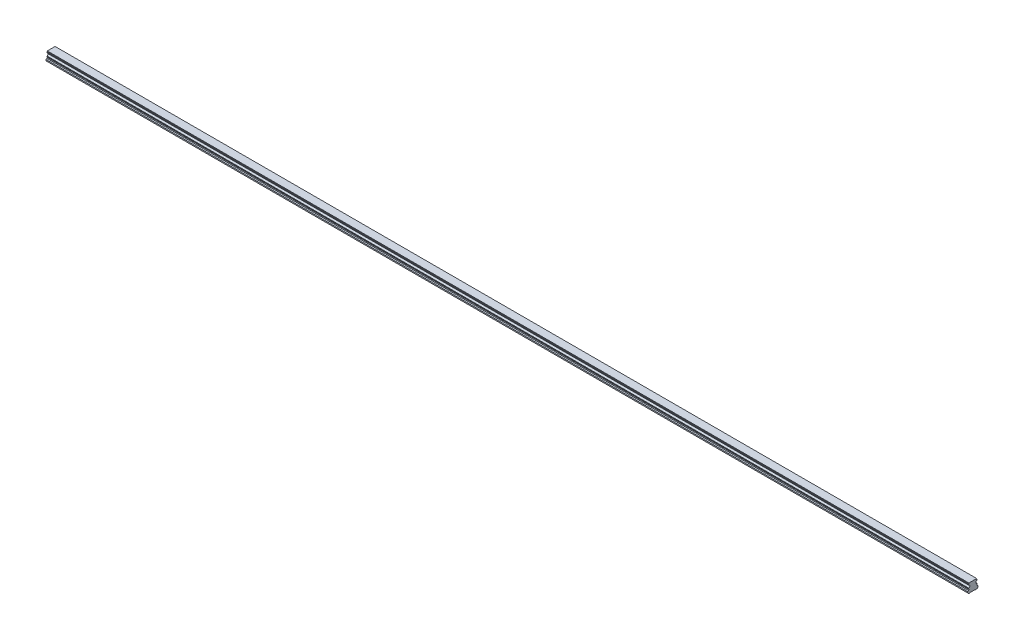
ISO-10303-21;
HEADER;
FILE_DESCRIPTION(('STEP AP214'),'2;1');
FILE_NAME('part.step','',(''),(''),'','','');
FILE_SCHEMA(('AUTOMOTIVE_DESIGN { 1 0 10303 214 1 1 1 1 }'));
ENDSEC;
DATA;
#1=APPLICATION_CONTEXT('core data for automotive mechanical design processes');
#2=APPLICATION_PROTOCOL_DEFINITION('international standard','automotive_design',2000,#1);
#3=PRODUCT_CONTEXT('',#1,'mechanical');
#4=PRODUCT('Part','Part','',(#3));
#5=PRODUCT_RELATED_PRODUCT_CATEGORY('part','',(#4));
#6=PRODUCT_DEFINITION_FORMATION('','',#4);
#7=PRODUCT_DEFINITION_CONTEXT('part definition',#1,'design');
#8=PRODUCT_DEFINITION('design','',#6,#7);
#9=PRODUCT_DEFINITION_SHAPE('','',#8);
#10=(LENGTH_UNIT() NAMED_UNIT(*) SI_UNIT(.MILLI.,.METRE.));
#11=(NAMED_UNIT(*) PLANE_ANGLE_UNIT() SI_UNIT($,.RADIAN.));
#12=(NAMED_UNIT(*) SI_UNIT($,.STERADIAN.) SOLID_ANGLE_UNIT());
#13=UNCERTAINTY_MEASURE_WITH_UNIT(LENGTH_MEASURE(1.E-05),#10,'distance_accuracy_value','');
#14=(GEOMETRIC_REPRESENTATION_CONTEXT(3) GLOBAL_UNCERTAINTY_ASSIGNED_CONTEXT((#13)) GLOBAL_UNIT_ASSIGNED_CONTEXT((#10,
#11,#12)) REPRESENTATION_CONTEXT('',''));
#15=CARTESIAN_POINT('',(0.,0.,0.));
#16=DIRECTION('',(0.,0.,1.));
#17=DIRECTION('',(1.,0.,0.));
#18=AXIS2_PLACEMENT_3D('',#15,#16,#17);
#19=CARTESIAN_POINT('',(2190.,0.499999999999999,0.));
#20=DIRECTION('',(0.,-1.,0.));
#21=DIRECTION('',(0.,0.,-1.));
#22=AXIS2_PLACEMENT_3D('',#19,#20,#21);
#23=CONICAL_SURFACE('',#22,3.5,0.785398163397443);
#24=CARTESIAN_POINT('',(2190.,1.00000000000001,0.));
#25=DIRECTION('',(0.,1.,0.));
#26=DIRECTION('',(0.,0.,1.));
#27=AXIS2_PLACEMENT_3D('',#24,#25,#26);
#28=CIRCLE('',#27,3.);
#29=CARTESIAN_POINT('',(2190.,1.00000000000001,3.));
#30=VERTEX_POINT('',#29);
#31=EDGE_CURVE('E11',#30,#30,#28,.F.);
#32=ORIENTED_EDGE('',*,*,#31,.F.);
#33=EDGE_LOOP('',(#32));
#34=FACE_BOUND('',#33,.T.);
#35=CARTESIAN_POINT('',(2190.,0.499999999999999,0.));
#36=DIRECTION('',(0.,1.,0.));
#37=DIRECTION('',(0.,0.,1.));
#38=AXIS2_PLACEMENT_3D('',#35,#36,#37);
#39=CIRCLE('',#38,3.5);
#40=CARTESIAN_POINT('',(2190.,0.5,3.5));
#41=VERTEX_POINT('',#40);
#42=EDGE_CURVE('E842',#41,#41,#39,.T.);
#43=ORIENTED_EDGE('',*,*,#42,.F.);
#44=EDGE_LOOP('',(#43));
#45=FACE_BOUND('',#44,.T.);
#46=ADVANCED_FACE('F39',(#34,#45),#23,.F.);
#47=CARTESIAN_POINT('',(2190.,12.,0.));
#48=DIRECTION('',(0.,-1.,0.));
#49=DIRECTION('',(0.,0.,-1.));
#50=AXIS2_PLACEMENT_3D('',#47,#48,#49);
#51=CYLINDRICAL_SURFACE('',#50,3.);
#52=ORIENTED_EDGE('',*,*,#31,.T.);
#53=EDGE_LOOP('',(#52));
#54=FACE_BOUND('',#53,.T.);
#55=CARTESIAN_POINT('',(2190.,12.,0.));
#56=DIRECTION('',(0.,-1.,0.));
#57=DIRECTION('',(0.,0.,-1.));
#58=AXIS2_PLACEMENT_3D('',#55,#56,#57);
#59=CIRCLE('',#58,3.);
#60=CARTESIAN_POINT('',(2190.,12.,-3.));
#61=VERTEX_POINT('',#60);
#62=EDGE_CURVE('E49',#61,#61,#59,.T.);
#63=ORIENTED_EDGE('',*,*,#62,.F.);
#64=EDGE_LOOP('',(#63));
#65=FACE_BOUND('',#64,.T.);
#66=ADVANCED_FACE('F1171',(#54,#65),#51,.F.);
#67=CARTESIAN_POINT('',(2190.,12.,0.));
#68=DIRECTION('',(0.,-1.,0.));
#69=DIRECTION('',(0.,0.,-1.));
#70=AXIS2_PLACEMENT_3D('',#67,#68,#69);
#71=PLANE('',#70);
#72=CARTESIAN_POINT('',(2190.,12.,0.));
#73=DIRECTION('',(0.,-1.,0.));
#74=DIRECTION('',(0.,0.,-1.));
#75=AXIS2_PLACEMENT_3D('',#72,#73,#74);
#76=CIRCLE('',#75,2.5);
#77=CARTESIAN_POINT('',(2190.,12.,-2.5));
#78=VERTEX_POINT('',#77);
#79=EDGE_CURVE('E42',#78,#78,#76,.T.);
#80=ORIENTED_EDGE('',*,*,#79,.F.);
#81=EDGE_LOOP('',(#80));
#82=FACE_BOUND('',#81,.T.);
#83=ORIENTED_EDGE('',*,*,#62,.T.);
#84=EDGE_LOOP('',(#83));
#85=FACE_BOUND('',#84,.T.);
#86=ADVANCED_FACE('F1176',(#82,#85),#71,.T.);
#87=CARTESIAN_POINT('',(2130.,0.499999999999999,0.));
#88=DIRECTION('',(0.,-1.,0.));
#89=DIRECTION('',(0.,0.,-1.));
#90=AXIS2_PLACEMENT_3D('',#87,#88,#89);
#91=CONICAL_SURFACE('',#90,3.5,0.785398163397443);
#92=CARTESIAN_POINT('',(2130.,1.00000000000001,0.));
#93=DIRECTION('',(0.,1.,0.));
#94=DIRECTION('',(0.,0.,1.));
#95=AXIS2_PLACEMENT_3D('',#92,#93,#94);
#96=CIRCLE('',#95,3.);
#97=CARTESIAN_POINT('',(2130.,1.00000000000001,3.));
#98=VERTEX_POINT('',#97);
#99=EDGE_CURVE('E838',#98,#98,#96,.F.);
#100=ORIENTED_EDGE('',*,*,#99,.F.);
#101=EDGE_LOOP('',(#100));
#102=FACE_BOUND('',#101,.T.);
#103=CARTESIAN_POINT('',(2130.,0.499999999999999,0.));
#104=DIRECTION('',(0.,1.,0.));
#105=DIRECTION('',(0.,0.,1.));
#106=AXIS2_PLACEMENT_3D('',#103,#104,#105);
#107=CIRCLE('',#106,3.5);
#108=CARTESIAN_POINT('',(2130.,0.5,3.5));
#109=VERTEX_POINT('',#108);
#110=EDGE_CURVE('E830',#109,#109,#107,.T.);
#111=ORIENTED_EDGE('',*,*,#110,.F.);
#112=EDGE_LOOP('',(#111));
#113=FACE_BOUND('',#112,.T.);
#114=ADVANCED_FACE('F1659',(#102,#113),#91,.F.);
#115=CARTESIAN_POINT('',(2130.,12.,0.));
#116=DIRECTION('',(0.,-1.,0.));
#117=DIRECTION('',(0.,0.,-1.));
#118=AXIS2_PLACEMENT_3D('',#115,#116,#117);
#119=CYLINDRICAL_SURFACE('',#118,3.);
#120=ORIENTED_EDGE('',*,*,#99,.T.);
#121=EDGE_LOOP('',(#120));
#122=FACE_BOUND('',#121,.T.);
#123=CARTESIAN_POINT('',(2130.,12.,0.));
#124=DIRECTION('',(0.,-1.,0.));
#125=DIRECTION('',(0.,0.,-1.));
#126=AXIS2_PLACEMENT_3D('',#123,#124,#125);
#127=CIRCLE('',#126,3.);
#128=CARTESIAN_POINT('',(2130.,12.,-3.));
#129=VERTEX_POINT('',#128);
#130=EDGE_CURVE('E834',#129,#129,#127,.T.);
#131=ORIENTED_EDGE('',*,*,#130,.F.);
#132=EDGE_LOOP('',(#131));
#133=FACE_BOUND('',#132,.T.);
#134=ADVANCED_FACE('F1655',(#122,#133),#119,.F.);
#135=CARTESIAN_POINT('',(2130.,12.,0.));
#136=DIRECTION('',(0.,-1.,0.));
#137=DIRECTION('',(0.,0.,-1.));
#138=AXIS2_PLACEMENT_3D('',#135,#136,#137);
#139=PLANE('',#138);
#140=CARTESIAN_POINT('',(2130.,12.,0.));
#141=DIRECTION('',(0.,-1.,0.));
#142=DIRECTION('',(0.,0.,-1.));
#143=AXIS2_PLACEMENT_3D('',#140,#141,#142);
#144=CIRCLE('',#143,2.5);
#145=CARTESIAN_POINT('',(2130.,12.,-2.5));
#146=VERTEX_POINT('',#145);
#147=EDGE_CURVE('E985',#146,#146,#144,.T.);
#148=ORIENTED_EDGE('',*,*,#147,.F.);
#149=EDGE_LOOP('',(#148));
#150=FACE_BOUND('',#149,.T.);
#151=ORIENTED_EDGE('',*,*,#130,.T.);
#152=EDGE_LOOP('',(#151));
#153=FACE_BOUND('',#152,.T.);
#154=ADVANCED_FACE('F1651',(#150,#153),#139,.T.);
#155=CARTESIAN_POINT('',(2070.,0.499999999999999,0.));
#156=DIRECTION('',(0.,-1.,0.));
#157=DIRECTION('',(0.,0.,-1.));
#158=AXIS2_PLACEMENT_3D('',#155,#156,#157);
#159=CONICAL_SURFACE('',#158,3.5,0.785398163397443);
#160=CARTESIAN_POINT('',(2070.,1.00000000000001,0.));
#161=DIRECTION('',(0.,1.,0.));
#162=DIRECTION('',(0.,0.,1.));
#163=AXIS2_PLACEMENT_3D('',#160,#161,#162);
#164=CIRCLE('',#163,3.);
#165=CARTESIAN_POINT('',(2070.,1.00000000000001,3.));
#166=VERTEX_POINT('',#165);
#167=EDGE_CURVE('E826',#166,#166,#164,.F.);
#168=ORIENTED_EDGE('',*,*,#167,.F.);
#169=EDGE_LOOP('',(#168));
#170=FACE_BOUND('',#169,.T.);
#171=CARTESIAN_POINT('',(2070.,0.499999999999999,0.));
#172=DIRECTION('',(0.,1.,0.));
#173=DIRECTION('',(0.,0.,1.));
#174=AXIS2_PLACEMENT_3D('',#171,#172,#173);
#175=CIRCLE('',#174,3.5);
#176=CARTESIAN_POINT('',(2070.,0.5,3.5));
#177=VERTEX_POINT('',#176);
#178=EDGE_CURVE('E818',#177,#177,#175,.T.);
#179=ORIENTED_EDGE('',*,*,#178,.F.);
#180=EDGE_LOOP('',(#179));
#181=FACE_BOUND('',#180,.T.);
#182=ADVANCED_FACE('F1647',(#170,#181),#159,.F.);
#183=CARTESIAN_POINT('',(2070.,12.,0.));
#184=DIRECTION('',(0.,-1.,0.));
#185=DIRECTION('',(0.,0.,-1.));
#186=AXIS2_PLACEMENT_3D('',#183,#184,#185);
#187=CYLINDRICAL_SURFACE('',#186,3.);
#188=ORIENTED_EDGE('',*,*,#167,.T.);
#189=EDGE_LOOP('',(#188));
#190=FACE_BOUND('',#189,.T.);
#191=CARTESIAN_POINT('',(2070.,12.,0.));
#192=DIRECTION('',(0.,-1.,0.));
#193=DIRECTION('',(0.,0.,-1.));
#194=AXIS2_PLACEMENT_3D('',#191,#192,#193);
#195=CIRCLE('',#194,3.);
#196=CARTESIAN_POINT('',(2070.,12.,-3.));
#197=VERTEX_POINT('',#196);
#198=EDGE_CURVE('E822',#197,#197,#195,.T.);
#199=ORIENTED_EDGE('',*,*,#198,.F.);
#200=EDGE_LOOP('',(#199));
#201=FACE_BOUND('',#200,.T.);
#202=ADVANCED_FACE('F1643',(#190,#201),#187,.F.);
#203=CARTESIAN_POINT('',(2070.,12.,0.));
#204=DIRECTION('',(0.,-1.,0.));
#205=DIRECTION('',(0.,0.,-1.));
#206=AXIS2_PLACEMENT_3D('',#203,#204,#205);
#207=PLANE('',#206);
#208=CARTESIAN_POINT('',(2070.,12.,0.));
#209=DIRECTION('',(0.,-1.,0.));
#210=DIRECTION('',(0.,0.,-1.));
#211=AXIS2_PLACEMENT_3D('',#208,#209,#210);
#212=CIRCLE('',#211,2.5);
#213=CARTESIAN_POINT('',(2070.,12.,-2.5));
#214=VERTEX_POINT('',#213);
#215=EDGE_CURVE('E982',#214,#214,#212,.T.);
#216=ORIENTED_EDGE('',*,*,#215,.F.);
#217=EDGE_LOOP('',(#216));
#218=FACE_BOUND('',#217,.T.);
#219=ORIENTED_EDGE('',*,*,#198,.T.);
#220=EDGE_LOOP('',(#219));
#221=FACE_BOUND('',#220,.T.);
#222=ADVANCED_FACE('F1639',(#218,#221),#207,.T.);
#223=CARTESIAN_POINT('',(2010.,0.499999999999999,0.));
#224=DIRECTION('',(0.,-1.,0.));
#225=DIRECTION('',(0.,0.,-1.));
#226=AXIS2_PLACEMENT_3D('',#223,#224,#225);
#227=CONICAL_SURFACE('',#226,3.5,0.785398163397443);
#228=CARTESIAN_POINT('',(2010.,1.00000000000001,0.));
#229=DIRECTION('',(0.,1.,0.));
#230=DIRECTION('',(0.,0.,1.));
#231=AXIS2_PLACEMENT_3D('',#228,#229,#230);
#232=CIRCLE('',#231,3.);
#233=CARTESIAN_POINT('',(2010.,1.00000000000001,3.));
#234=VERTEX_POINT('',#233);
#235=EDGE_CURVE('E814',#234,#234,#232,.F.);
#236=ORIENTED_EDGE('',*,*,#235,.F.);
#237=EDGE_LOOP('',(#236));
#238=FACE_BOUND('',#237,.T.);
#239=CARTESIAN_POINT('',(2010.,0.499999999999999,0.));
#240=DIRECTION('',(0.,1.,0.));
#241=DIRECTION('',(0.,0.,1.));
#242=AXIS2_PLACEMENT_3D('',#239,#240,#241);
#243=CIRCLE('',#242,3.5);
#244=CARTESIAN_POINT('',(2010.,0.5,3.5));
#245=VERTEX_POINT('',#244);
#246=EDGE_CURVE('E806',#245,#245,#243,.T.);
#247=ORIENTED_EDGE('',*,*,#246,.F.);
#248=EDGE_LOOP('',(#247));
#249=FACE_BOUND('',#248,.T.);
#250=ADVANCED_FACE('F1635',(#238,#249),#227,.F.);
#251=CARTESIAN_POINT('',(2010.,12.,0.));
#252=DIRECTION('',(0.,-1.,0.));
#253=DIRECTION('',(0.,0.,-1.));
#254=AXIS2_PLACEMENT_3D('',#251,#252,#253);
#255=CYLINDRICAL_SURFACE('',#254,3.);
#256=ORIENTED_EDGE('',*,*,#235,.T.);
#257=EDGE_LOOP('',(#256));
#258=FACE_BOUND('',#257,.T.);
#259=CARTESIAN_POINT('',(2010.,12.,0.));
#260=DIRECTION('',(0.,-1.,0.));
#261=DIRECTION('',(0.,0.,-1.));
#262=AXIS2_PLACEMENT_3D('',#259,#260,#261);
#263=CIRCLE('',#262,3.);
#264=CARTESIAN_POINT('',(2010.,12.,-3.));
#265=VERTEX_POINT('',#264);
#266=EDGE_CURVE('E810',#265,#265,#263,.T.);
#267=ORIENTED_EDGE('',*,*,#266,.F.);
#268=EDGE_LOOP('',(#267));
#269=FACE_BOUND('',#268,.T.);
#270=ADVANCED_FACE('F1631',(#258,#269),#255,.F.);
#271=CARTESIAN_POINT('',(2010.,12.,0.));
#272=DIRECTION('',(0.,-1.,0.));
#273=DIRECTION('',(0.,0.,-1.));
#274=AXIS2_PLACEMENT_3D('',#271,#272,#273);
#275=PLANE('',#274);
#276=CARTESIAN_POINT('',(2010.,12.,0.));
#277=DIRECTION('',(0.,-1.,0.));
#278=DIRECTION('',(0.,0.,-1.));
#279=AXIS2_PLACEMENT_3D('',#276,#277,#278);
#280=CIRCLE('',#279,2.5);
#281=CARTESIAN_POINT('',(2010.,12.,-2.5));
#282=VERTEX_POINT('',#281);
#283=EDGE_CURVE('E978',#282,#282,#280,.T.);
#284=ORIENTED_EDGE('',*,*,#283,.F.);
#285=EDGE_LOOP('',(#284));
#286=FACE_BOUND('',#285,.T.);
#287=ORIENTED_EDGE('',*,*,#266,.T.);
#288=EDGE_LOOP('',(#287));
#289=FACE_BOUND('',#288,.T.);
#290=ADVANCED_FACE('F1627',(#286,#289),#275,.T.);
#291=CARTESIAN_POINT('',(1950.,0.499999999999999,0.));
#292=DIRECTION('',(0.,-1.,0.));
#293=DIRECTION('',(0.,0.,-1.));
#294=AXIS2_PLACEMENT_3D('',#291,#292,#293);
#295=CONICAL_SURFACE('',#294,3.5,0.785398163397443);
#296=CARTESIAN_POINT('',(1950.,1.00000000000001,0.));
#297=DIRECTION('',(0.,1.,0.));
#298=DIRECTION('',(0.,0.,1.));
#299=AXIS2_PLACEMENT_3D('',#296,#297,#298);
#300=CIRCLE('',#299,3.);
#301=CARTESIAN_POINT('',(1950.,1.00000000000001,3.));
#302=VERTEX_POINT('',#301);
#303=EDGE_CURVE('E802',#302,#302,#300,.F.);
#304=ORIENTED_EDGE('',*,*,#303,.F.);
#305=EDGE_LOOP('',(#304));
#306=FACE_BOUND('',#305,.T.);
#307=CARTESIAN_POINT('',(1950.,0.499999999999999,0.));
#308=DIRECTION('',(0.,1.,0.));
#309=DIRECTION('',(0.,0.,1.));
#310=AXIS2_PLACEMENT_3D('',#307,#308,#309);
#311=CIRCLE('',#310,3.5);
#312=CARTESIAN_POINT('',(1950.,0.5,3.5));
#313=VERTEX_POINT('',#312);
#314=EDGE_CURVE('E794',#313,#313,#311,.T.);
#315=ORIENTED_EDGE('',*,*,#314,.F.);
#316=EDGE_LOOP('',(#315));
#317=FACE_BOUND('',#316,.T.);
#318=ADVANCED_FACE('F1623',(#306,#317),#295,.F.);
#319=CARTESIAN_POINT('',(1950.,12.,0.));
#320=DIRECTION('',(0.,-1.,0.));
#321=DIRECTION('',(0.,0.,-1.));
#322=AXIS2_PLACEMENT_3D('',#319,#320,#321);
#323=CYLINDRICAL_SURFACE('',#322,3.);
#324=ORIENTED_EDGE('',*,*,#303,.T.);
#325=EDGE_LOOP('',(#324));
#326=FACE_BOUND('',#325,.T.);
#327=CARTESIAN_POINT('',(1950.,12.,0.));
#328=DIRECTION('',(0.,-1.,0.));
#329=DIRECTION('',(0.,0.,-1.));
#330=AXIS2_PLACEMENT_3D('',#327,#328,#329);
#331=CIRCLE('',#330,3.);
#332=CARTESIAN_POINT('',(1950.,12.,-3.));
#333=VERTEX_POINT('',#332);
#334=EDGE_CURVE('E798',#333,#333,#331,.T.);
#335=ORIENTED_EDGE('',*,*,#334,.F.);
#336=EDGE_LOOP('',(#335));
#337=FACE_BOUND('',#336,.T.);
#338=ADVANCED_FACE('F1619',(#326,#337),#323,.F.);
#339=CARTESIAN_POINT('',(1950.,12.,0.));
#340=DIRECTION('',(0.,-1.,0.));
#341=DIRECTION('',(0.,0.,-1.));
#342=AXIS2_PLACEMENT_3D('',#339,#340,#341);
#343=PLANE('',#342);
#344=CARTESIAN_POINT('',(1950.,12.,0.));
#345=DIRECTION('',(0.,-1.,0.));
#346=DIRECTION('',(0.,0.,-1.));
#347=AXIS2_PLACEMENT_3D('',#344,#345,#346);
#348=CIRCLE('',#347,2.5);
#349=CARTESIAN_POINT('',(1950.,12.,-2.5));
#350=VERTEX_POINT('',#349);
#351=EDGE_CURVE('E974',#350,#350,#348,.T.);
#352=ORIENTED_EDGE('',*,*,#351,.F.);
#353=EDGE_LOOP('',(#352));
#354=FACE_BOUND('',#353,.T.);
#355=ORIENTED_EDGE('',*,*,#334,.T.);
#356=EDGE_LOOP('',(#355));
#357=FACE_BOUND('',#356,.T.);
#358=ADVANCED_FACE('F1615',(#354,#357),#343,.T.);
#359=CARTESIAN_POINT('',(1890.,0.499999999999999,0.));
#360=DIRECTION('',(0.,-1.,0.));
#361=DIRECTION('',(0.,0.,-1.));
#362=AXIS2_PLACEMENT_3D('',#359,#360,#361);
#363=CONICAL_SURFACE('',#362,3.5,0.785398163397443);
#364=CARTESIAN_POINT('',(1890.,1.00000000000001,0.));
#365=DIRECTION('',(0.,1.,0.));
#366=DIRECTION('',(0.,0.,1.));
#367=AXIS2_PLACEMENT_3D('',#364,#365,#366);
#368=CIRCLE('',#367,3.);
#369=CARTESIAN_POINT('',(1890.,1.00000000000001,3.));
#370=VERTEX_POINT('',#369);
#371=EDGE_CURVE('E790',#370,#370,#368,.F.);
#372=ORIENTED_EDGE('',*,*,#371,.F.);
#373=EDGE_LOOP('',(#372));
#374=FACE_BOUND('',#373,.T.);
#375=CARTESIAN_POINT('',(1890.,0.499999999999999,0.));
#376=DIRECTION('',(0.,1.,0.));
#377=DIRECTION('',(0.,0.,1.));
#378=AXIS2_PLACEMENT_3D('',#375,#376,#377);
#379=CIRCLE('',#378,3.5);
#380=CARTESIAN_POINT('',(1890.,0.5,3.5));
#381=VERTEX_POINT('',#380);
#382=EDGE_CURVE('E782',#381,#381,#379,.T.);
#383=ORIENTED_EDGE('',*,*,#382,.F.);
#384=EDGE_LOOP('',(#383));
#385=FACE_BOUND('',#384,.T.);
#386=ADVANCED_FACE('F1611',(#374,#385),#363,.F.);
#387=CARTESIAN_POINT('',(1890.,12.,0.));
#388=DIRECTION('',(0.,-1.,0.));
#389=DIRECTION('',(0.,0.,-1.));
#390=AXIS2_PLACEMENT_3D('',#387,#388,#389);
#391=CYLINDRICAL_SURFACE('',#390,3.);
#392=ORIENTED_EDGE('',*,*,#371,.T.);
#393=EDGE_LOOP('',(#392));
#394=FACE_BOUND('',#393,.T.);
#395=CARTESIAN_POINT('',(1890.,12.,0.));
#396=DIRECTION('',(0.,-1.,0.));
#397=DIRECTION('',(0.,0.,-1.));
#398=AXIS2_PLACEMENT_3D('',#395,#396,#397);
#399=CIRCLE('',#398,3.);
#400=CARTESIAN_POINT('',(1890.,12.,-3.));
#401=VERTEX_POINT('',#400);
#402=EDGE_CURVE('E786',#401,#401,#399,.T.);
#403=ORIENTED_EDGE('',*,*,#402,.F.);
#404=EDGE_LOOP('',(#403));
#405=FACE_BOUND('',#404,.T.);
#406=ADVANCED_FACE('F1607',(#394,#405),#391,.F.);
#407=CARTESIAN_POINT('',(1890.,12.,0.));
#408=DIRECTION('',(0.,-1.,0.));
#409=DIRECTION('',(0.,0.,-1.));
#410=AXIS2_PLACEMENT_3D('',#407,#408,#409);
#411=PLANE('',#410);
#412=CARTESIAN_POINT('',(1890.,12.,0.));
#413=DIRECTION('',(0.,-1.,0.));
#414=DIRECTION('',(0.,0.,-1.));
#415=AXIS2_PLACEMENT_3D('',#412,#413,#414);
#416=CIRCLE('',#415,2.5);
#417=CARTESIAN_POINT('',(1890.,12.,-2.5));
#418=VERTEX_POINT('',#417);
#419=EDGE_CURVE('E970',#418,#418,#416,.T.);
#420=ORIENTED_EDGE('',*,*,#419,.F.);
#421=EDGE_LOOP('',(#420));
#422=FACE_BOUND('',#421,.T.);
#423=ORIENTED_EDGE('',*,*,#402,.T.);
#424=EDGE_LOOP('',(#423));
#425=FACE_BOUND('',#424,.T.);
#426=ADVANCED_FACE('F1603',(#422,#425),#411,.T.);
#427=CARTESIAN_POINT('',(1830.,0.499999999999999,0.));
#428=DIRECTION('',(0.,-1.,0.));
#429=DIRECTION('',(0.,0.,-1.));
#430=AXIS2_PLACEMENT_3D('',#427,#428,#429);
#431=CONICAL_SURFACE('',#430,3.5,0.785398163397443);
#432=CARTESIAN_POINT('',(1830.,1.00000000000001,0.));
#433=DIRECTION('',(0.,1.,0.));
#434=DIRECTION('',(0.,0.,1.));
#435=AXIS2_PLACEMENT_3D('',#432,#433,#434);
#436=CIRCLE('',#435,3.);
#437=CARTESIAN_POINT('',(1830.,1.00000000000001,3.));
#438=VERTEX_POINT('',#437);
#439=EDGE_CURVE('E778',#438,#438,#436,.F.);
#440=ORIENTED_EDGE('',*,*,#439,.F.);
#441=EDGE_LOOP('',(#440));
#442=FACE_BOUND('',#441,.T.);
#443=CARTESIAN_POINT('',(1830.,0.499999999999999,0.));
#444=DIRECTION('',(0.,1.,0.));
#445=DIRECTION('',(0.,0.,1.));
#446=AXIS2_PLACEMENT_3D('',#443,#444,#445);
#447=CIRCLE('',#446,3.5);
#448=CARTESIAN_POINT('',(1830.,0.5,3.5));
#449=VERTEX_POINT('',#448);
#450=EDGE_CURVE('E770',#449,#449,#447,.T.);
#451=ORIENTED_EDGE('',*,*,#450,.F.);
#452=EDGE_LOOP('',(#451));
#453=FACE_BOUND('',#452,.T.);
#454=ADVANCED_FACE('F1599',(#442,#453),#431,.F.);
#455=CARTESIAN_POINT('',(1830.,12.,0.));
#456=DIRECTION('',(0.,-1.,0.));
#457=DIRECTION('',(0.,0.,-1.));
#458=AXIS2_PLACEMENT_3D('',#455,#456,#457);
#459=CYLINDRICAL_SURFACE('',#458,3.);
#460=ORIENTED_EDGE('',*,*,#439,.T.);
#461=EDGE_LOOP('',(#460));
#462=FACE_BOUND('',#461,.T.);
#463=CARTESIAN_POINT('',(1830.,12.,0.));
#464=DIRECTION('',(0.,-1.,0.));
#465=DIRECTION('',(0.,0.,-1.));
#466=AXIS2_PLACEMENT_3D('',#463,#464,#465);
#467=CIRCLE('',#466,3.);
#468=CARTESIAN_POINT('',(1830.,12.,-3.));
#469=VERTEX_POINT('',#468);
#470=EDGE_CURVE('E774',#469,#469,#467,.T.);
#471=ORIENTED_EDGE('',*,*,#470,.F.);
#472=EDGE_LOOP('',(#471));
#473=FACE_BOUND('',#472,.T.);
#474=ADVANCED_FACE('F1595',(#462,#473),#459,.F.);
#475=CARTESIAN_POINT('',(1830.,12.,0.));
#476=DIRECTION('',(0.,-1.,0.));
#477=DIRECTION('',(0.,0.,-1.));
#478=AXIS2_PLACEMENT_3D('',#475,#476,#477);
#479=PLANE('',#478);
#480=CARTESIAN_POINT('',(1830.,12.,0.));
#481=DIRECTION('',(0.,-1.,0.));
#482=DIRECTION('',(0.,0.,-1.));
#483=AXIS2_PLACEMENT_3D('',#480,#481,#482);
#484=CIRCLE('',#483,2.5);
#485=CARTESIAN_POINT('',(1830.,12.,-2.5));
#486=VERTEX_POINT('',#485);
#487=EDGE_CURVE('E966',#486,#486,#484,.T.);
#488=ORIENTED_EDGE('',*,*,#487,.F.);
#489=EDGE_LOOP('',(#488));
#490=FACE_BOUND('',#489,.T.);
#491=ORIENTED_EDGE('',*,*,#470,.T.);
#492=EDGE_LOOP('',(#491));
#493=FACE_BOUND('',#492,.T.);
#494=ADVANCED_FACE('F1591',(#490,#493),#479,.T.);
#495=CARTESIAN_POINT('',(1770.,0.499999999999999,0.));
#496=DIRECTION('',(0.,-1.,0.));
#497=DIRECTION('',(0.,0.,-1.));
#498=AXIS2_PLACEMENT_3D('',#495,#496,#497);
#499=CONICAL_SURFACE('',#498,3.5,0.785398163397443);
#500=CARTESIAN_POINT('',(1770.,1.00000000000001,0.));
#501=DIRECTION('',(0.,1.,0.));
#502=DIRECTION('',(0.,0.,1.));
#503=AXIS2_PLACEMENT_3D('',#500,#501,#502);
#504=CIRCLE('',#503,3.);
#505=CARTESIAN_POINT('',(1770.,1.00000000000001,3.));
#506=VERTEX_POINT('',#505);
#507=EDGE_CURVE('E766',#506,#506,#504,.F.);
#508=ORIENTED_EDGE('',*,*,#507,.F.);
#509=EDGE_LOOP('',(#508));
#510=FACE_BOUND('',#509,.T.);
#511=CARTESIAN_POINT('',(1770.,0.499999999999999,0.));
#512=DIRECTION('',(0.,1.,0.));
#513=DIRECTION('',(0.,0.,1.));
#514=AXIS2_PLACEMENT_3D('',#511,#512,#513);
#515=CIRCLE('',#514,3.5);
#516=CARTESIAN_POINT('',(1770.,0.5,3.5));
#517=VERTEX_POINT('',#516);
#518=EDGE_CURVE('E758',#517,#517,#515,.T.);
#519=ORIENTED_EDGE('',*,*,#518,.F.);
#520=EDGE_LOOP('',(#519));
#521=FACE_BOUND('',#520,.T.);
#522=ADVANCED_FACE('F1587',(#510,#521),#499,.F.);
#523=CARTESIAN_POINT('',(1770.,12.,0.));
#524=DIRECTION('',(0.,-1.,0.));
#525=DIRECTION('',(0.,0.,-1.));
#526=AXIS2_PLACEMENT_3D('',#523,#524,#525);
#527=CYLINDRICAL_SURFACE('',#526,3.);
#528=ORIENTED_EDGE('',*,*,#507,.T.);
#529=EDGE_LOOP('',(#528));
#530=FACE_BOUND('',#529,.T.);
#531=CARTESIAN_POINT('',(1770.,12.,0.));
#532=DIRECTION('',(0.,-1.,0.));
#533=DIRECTION('',(0.,0.,-1.));
#534=AXIS2_PLACEMENT_3D('',#531,#532,#533);
#535=CIRCLE('',#534,3.);
#536=CARTESIAN_POINT('',(1770.,12.,-3.));
#537=VERTEX_POINT('',#536);
#538=EDGE_CURVE('E762',#537,#537,#535,.T.);
#539=ORIENTED_EDGE('',*,*,#538,.F.);
#540=EDGE_LOOP('',(#539));
#541=FACE_BOUND('',#540,.T.);
#542=ADVANCED_FACE('F1583',(#530,#541),#527,.F.);
#543=CARTESIAN_POINT('',(1770.,12.,0.));
#544=DIRECTION('',(0.,-1.,0.));
#545=DIRECTION('',(0.,0.,-1.));
#546=AXIS2_PLACEMENT_3D('',#543,#544,#545);
#547=PLANE('',#546);
#548=CARTESIAN_POINT('',(1770.,12.,0.));
#549=DIRECTION('',(0.,-1.,0.));
#550=DIRECTION('',(0.,0.,-1.));
#551=AXIS2_PLACEMENT_3D('',#548,#549,#550);
#552=CIRCLE('',#551,2.5);
#553=CARTESIAN_POINT('',(1770.,12.,-2.5));
#554=VERTEX_POINT('',#553);
#555=EDGE_CURVE('E962',#554,#554,#552,.T.);
#556=ORIENTED_EDGE('',*,*,#555,.F.);
#557=EDGE_LOOP('',(#556));
#558=FACE_BOUND('',#557,.T.);
#559=ORIENTED_EDGE('',*,*,#538,.T.);
#560=EDGE_LOOP('',(#559));
#561=FACE_BOUND('',#560,.T.);
#562=ADVANCED_FACE('F1579',(#558,#561),#547,.T.);
#563=CARTESIAN_POINT('',(1710.,0.499999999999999,0.));
#564=DIRECTION('',(0.,-1.,0.));
#565=DIRECTION('',(0.,0.,-1.));
#566=AXIS2_PLACEMENT_3D('',#563,#564,#565);
#567=CONICAL_SURFACE('',#566,3.5,0.785398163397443);
#568=CARTESIAN_POINT('',(1710.,1.00000000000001,0.));
#569=DIRECTION('',(0.,1.,0.));
#570=DIRECTION('',(0.,0.,1.));
#571=AXIS2_PLACEMENT_3D('',#568,#569,#570);
#572=CIRCLE('',#571,3.);
#573=CARTESIAN_POINT('',(1710.,1.00000000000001,3.));
#574=VERTEX_POINT('',#573);
#575=EDGE_CURVE('E754',#574,#574,#572,.F.);
#576=ORIENTED_EDGE('',*,*,#575,.F.);
#577=EDGE_LOOP('',(#576));
#578=FACE_BOUND('',#577,.T.);
#579=CARTESIAN_POINT('',(1710.,0.499999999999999,0.));
#580=DIRECTION('',(0.,1.,0.));
#581=DIRECTION('',(0.,0.,1.));
#582=AXIS2_PLACEMENT_3D('',#579,#580,#581);
#583=CIRCLE('',#582,3.5);
#584=CARTESIAN_POINT('',(1710.,0.5,3.5));
#585=VERTEX_POINT('',#584);
#586=EDGE_CURVE('E746',#585,#585,#583,.T.);
#587=ORIENTED_EDGE('',*,*,#586,.F.);
#588=EDGE_LOOP('',(#587));
#589=FACE_BOUND('',#588,.T.);
#590=ADVANCED_FACE('F1575',(#578,#589),#567,.F.);
#591=CARTESIAN_POINT('',(1710.,12.,0.));
#592=DIRECTION('',(0.,-1.,0.));
#593=DIRECTION('',(0.,0.,-1.));
#594=AXIS2_PLACEMENT_3D('',#591,#592,#593);
#595=CYLINDRICAL_SURFACE('',#594,3.);
#596=ORIENTED_EDGE('',*,*,#575,.T.);
#597=EDGE_LOOP('',(#596));
#598=FACE_BOUND('',#597,.T.);
#599=CARTESIAN_POINT('',(1710.,12.,0.));
#600=DIRECTION('',(0.,-1.,0.));
#601=DIRECTION('',(0.,0.,-1.));
#602=AXIS2_PLACEMENT_3D('',#599,#600,#601);
#603=CIRCLE('',#602,3.);
#604=CARTESIAN_POINT('',(1710.,12.,-3.));
#605=VERTEX_POINT('',#604);
#606=EDGE_CURVE('E750',#605,#605,#603,.T.);
#607=ORIENTED_EDGE('',*,*,#606,.F.);
#608=EDGE_LOOP('',(#607));
#609=FACE_BOUND('',#608,.T.);
#610=ADVANCED_FACE('F1571',(#598,#609),#595,.F.);
#611=CARTESIAN_POINT('',(1710.,12.,0.));
#612=DIRECTION('',(0.,-1.,0.));
#613=DIRECTION('',(0.,0.,-1.));
#614=AXIS2_PLACEMENT_3D('',#611,#612,#613);
#615=PLANE('',#614);
#616=CARTESIAN_POINT('',(1710.,12.,0.));
#617=DIRECTION('',(0.,-1.,0.));
#618=DIRECTION('',(0.,0.,-1.));
#619=AXIS2_PLACEMENT_3D('',#616,#617,#618);
#620=CIRCLE('',#619,2.5);
#621=CARTESIAN_POINT('',(1710.,12.,-2.5));
#622=VERTEX_POINT('',#621);
#623=EDGE_CURVE('E958',#622,#622,#620,.T.);
#624=ORIENTED_EDGE('',*,*,#623,.F.);
#625=EDGE_LOOP('',(#624));
#626=FACE_BOUND('',#625,.T.);
#627=ORIENTED_EDGE('',*,*,#606,.T.);
#628=EDGE_LOOP('',(#627));
#629=FACE_BOUND('',#628,.T.);
#630=ADVANCED_FACE('F1567',(#626,#629),#615,.T.);
#631=CARTESIAN_POINT('',(1650.,0.499999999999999,0.));
#632=DIRECTION('',(0.,-1.,0.));
#633=DIRECTION('',(0.,0.,-1.));
#634=AXIS2_PLACEMENT_3D('',#631,#632,#633);
#635=CONICAL_SURFACE('',#634,3.5,0.785398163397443);
#636=CARTESIAN_POINT('',(1650.,1.00000000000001,0.));
#637=DIRECTION('',(0.,1.,0.));
#638=DIRECTION('',(0.,0.,1.));
#639=AXIS2_PLACEMENT_3D('',#636,#637,#638);
#640=CIRCLE('',#639,3.);
#641=CARTESIAN_POINT('',(1650.,1.00000000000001,3.));
#642=VERTEX_POINT('',#641);
#643=EDGE_CURVE('E742',#642,#642,#640,.F.);
#644=ORIENTED_EDGE('',*,*,#643,.F.);
#645=EDGE_LOOP('',(#644));
#646=FACE_BOUND('',#645,.T.);
#647=CARTESIAN_POINT('',(1650.,0.499999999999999,0.));
#648=DIRECTION('',(0.,1.,0.));
#649=DIRECTION('',(0.,0.,1.));
#650=AXIS2_PLACEMENT_3D('',#647,#648,#649);
#651=CIRCLE('',#650,3.5);
#652=CARTESIAN_POINT('',(1650.,0.5,3.5));
#653=VERTEX_POINT('',#652);
#654=EDGE_CURVE('E734',#653,#653,#651,.T.);
#655=ORIENTED_EDGE('',*,*,#654,.F.);
#656=EDGE_LOOP('',(#655));
#657=FACE_BOUND('',#656,.T.);
#658=ADVANCED_FACE('F1563',(#646,#657),#635,.F.);
#659=CARTESIAN_POINT('',(1650.,12.,0.));
#660=DIRECTION('',(0.,-1.,0.));
#661=DIRECTION('',(0.,0.,-1.));
#662=AXIS2_PLACEMENT_3D('',#659,#660,#661);
#663=CYLINDRICAL_SURFACE('',#662,3.);
#664=ORIENTED_EDGE('',*,*,#643,.T.);
#665=EDGE_LOOP('',(#664));
#666=FACE_BOUND('',#665,.T.);
#667=CARTESIAN_POINT('',(1650.,12.,0.));
#668=DIRECTION('',(0.,-1.,0.));
#669=DIRECTION('',(0.,0.,-1.));
#670=AXIS2_PLACEMENT_3D('',#667,#668,#669);
#671=CIRCLE('',#670,3.);
#672=CARTESIAN_POINT('',(1650.,12.,-3.));
#673=VERTEX_POINT('',#672);
#674=EDGE_CURVE('E738',#673,#673,#671,.T.);
#675=ORIENTED_EDGE('',*,*,#674,.F.);
#676=EDGE_LOOP('',(#675));
#677=FACE_BOUND('',#676,.T.);
#678=ADVANCED_FACE('F1559',(#666,#677),#663,.F.);
#679=CARTESIAN_POINT('',(1650.,12.,0.));
#680=DIRECTION('',(0.,-1.,0.));
#681=DIRECTION('',(0.,0.,-1.));
#682=AXIS2_PLACEMENT_3D('',#679,#680,#681);
#683=PLANE('',#682);
#684=CARTESIAN_POINT('',(1650.,12.,0.));
#685=DIRECTION('',(0.,-1.,0.));
#686=DIRECTION('',(0.,0.,-1.));
#687=AXIS2_PLACEMENT_3D('',#684,#685,#686);
#688=CIRCLE('',#687,2.5);
#689=CARTESIAN_POINT('',(1650.,12.,-2.5));
#690=VERTEX_POINT('',#689);
#691=EDGE_CURVE('E954',#690,#690,#688,.T.);
#692=ORIENTED_EDGE('',*,*,#691,.F.);
#693=EDGE_LOOP('',(#692));
#694=FACE_BOUND('',#693,.T.);
#695=ORIENTED_EDGE('',*,*,#674,.T.);
#696=EDGE_LOOP('',(#695));
#697=FACE_BOUND('',#696,.T.);
#698=ADVANCED_FACE('F1555',(#694,#697),#683,.T.);
#699=CARTESIAN_POINT('',(1590.,0.499999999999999,0.));
#700=DIRECTION('',(0.,-1.,0.));
#701=DIRECTION('',(0.,0.,-1.));
#702=AXIS2_PLACEMENT_3D('',#699,#700,#701);
#703=CONICAL_SURFACE('',#702,3.5,0.785398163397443);
#704=CARTESIAN_POINT('',(1590.,1.00000000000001,0.));
#705=DIRECTION('',(0.,1.,0.));
#706=DIRECTION('',(0.,0.,1.));
#707=AXIS2_PLACEMENT_3D('',#704,#705,#706);
#708=CIRCLE('',#707,3.);
#709=CARTESIAN_POINT('',(1590.,1.00000000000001,3.));
#710=VERTEX_POINT('',#709);
#711=EDGE_CURVE('E730',#710,#710,#708,.F.);
#712=ORIENTED_EDGE('',*,*,#711,.F.);
#713=EDGE_LOOP('',(#712));
#714=FACE_BOUND('',#713,.T.);
#715=CARTESIAN_POINT('',(1590.,0.499999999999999,0.));
#716=DIRECTION('',(0.,1.,0.));
#717=DIRECTION('',(0.,0.,1.));
#718=AXIS2_PLACEMENT_3D('',#715,#716,#717);
#719=CIRCLE('',#718,3.5);
#720=CARTESIAN_POINT('',(1590.,0.5,3.5));
#721=VERTEX_POINT('',#720);
#722=EDGE_CURVE('E722',#721,#721,#719,.T.);
#723=ORIENTED_EDGE('',*,*,#722,.F.);
#724=EDGE_LOOP('',(#723));
#725=FACE_BOUND('',#724,.T.);
#726=ADVANCED_FACE('F1551',(#714,#725),#703,.F.);
#727=CARTESIAN_POINT('',(1590.,12.,0.));
#728=DIRECTION('',(0.,-1.,0.));
#729=DIRECTION('',(0.,0.,-1.));
#730=AXIS2_PLACEMENT_3D('',#727,#728,#729);
#731=CYLINDRICAL_SURFACE('',#730,3.);
#732=ORIENTED_EDGE('',*,*,#711,.T.);
#733=EDGE_LOOP('',(#732));
#734=FACE_BOUND('',#733,.T.);
#735=CARTESIAN_POINT('',(1590.,12.,0.));
#736=DIRECTION('',(0.,-1.,0.));
#737=DIRECTION('',(0.,0.,-1.));
#738=AXIS2_PLACEMENT_3D('',#735,#736,#737);
#739=CIRCLE('',#738,3.);
#740=CARTESIAN_POINT('',(1590.,12.,-3.));
#741=VERTEX_POINT('',#740);
#742=EDGE_CURVE('E726',#741,#741,#739,.T.);
#743=ORIENTED_EDGE('',*,*,#742,.F.);
#744=EDGE_LOOP('',(#743));
#745=FACE_BOUND('',#744,.T.);
#746=ADVANCED_FACE('F1547',(#734,#745),#731,.F.);
#747=CARTESIAN_POINT('',(1590.,12.,0.));
#748=DIRECTION('',(0.,-1.,0.));
#749=DIRECTION('',(0.,0.,-1.));
#750=AXIS2_PLACEMENT_3D('',#747,#748,#749);
#751=PLANE('',#750);
#752=CARTESIAN_POINT('',(1590.,12.,0.));
#753=DIRECTION('',(0.,-1.,0.));
#754=DIRECTION('',(0.,0.,-1.));
#755=AXIS2_PLACEMENT_3D('',#752,#753,#754);
#756=CIRCLE('',#755,2.5);
#757=CARTESIAN_POINT('',(1590.,12.,-2.5));
#758=VERTEX_POINT('',#757);
#759=EDGE_CURVE('E950',#758,#758,#756,.T.);
#760=ORIENTED_EDGE('',*,*,#759,.F.);
#761=EDGE_LOOP('',(#760));
#762=FACE_BOUND('',#761,.T.);
#763=ORIENTED_EDGE('',*,*,#742,.T.);
#764=EDGE_LOOP('',(#763));
#765=FACE_BOUND('',#764,.T.);
#766=ADVANCED_FACE('F1543',(#762,#765),#751,.T.);
#767=CARTESIAN_POINT('',(1530.,0.499999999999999,0.));
#768=DIRECTION('',(0.,-1.,0.));
#769=DIRECTION('',(0.,0.,-1.));
#770=AXIS2_PLACEMENT_3D('',#767,#768,#769);
#771=CONICAL_SURFACE('',#770,3.5,0.785398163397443);
#772=CARTESIAN_POINT('',(1530.,1.00000000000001,0.));
#773=DIRECTION('',(0.,1.,0.));
#774=DIRECTION('',(0.,0.,1.));
#775=AXIS2_PLACEMENT_3D('',#772,#773,#774);
#776=CIRCLE('',#775,3.);
#777=CARTESIAN_POINT('',(1530.,1.00000000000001,3.));
#778=VERTEX_POINT('',#777);
#779=EDGE_CURVE('E718',#778,#778,#776,.F.);
#780=ORIENTED_EDGE('',*,*,#779,.F.);
#781=EDGE_LOOP('',(#780));
#782=FACE_BOUND('',#781,.T.);
#783=CARTESIAN_POINT('',(1530.,0.499999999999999,0.));
#784=DIRECTION('',(0.,1.,0.));
#785=DIRECTION('',(0.,0.,1.));
#786=AXIS2_PLACEMENT_3D('',#783,#784,#785);
#787=CIRCLE('',#786,3.5);
#788=CARTESIAN_POINT('',(1530.,0.5,3.5));
#789=VERTEX_POINT('',#788);
#790=EDGE_CURVE('E710',#789,#789,#787,.T.);
#791=ORIENTED_EDGE('',*,*,#790,.F.);
#792=EDGE_LOOP('',(#791));
#793=FACE_BOUND('',#792,.T.);
#794=ADVANCED_FACE('F1539',(#782,#793),#771,.F.);
#795=CARTESIAN_POINT('',(1530.,12.,0.));
#796=DIRECTION('',(0.,-1.,0.));
#797=DIRECTION('',(0.,0.,-1.));
#798=AXIS2_PLACEMENT_3D('',#795,#796,#797);
#799=CYLINDRICAL_SURFACE('',#798,3.);
#800=ORIENTED_EDGE('',*,*,#779,.T.);
#801=EDGE_LOOP('',(#800));
#802=FACE_BOUND('',#801,.T.);
#803=CARTESIAN_POINT('',(1530.,12.,0.));
#804=DIRECTION('',(0.,-1.,0.));
#805=DIRECTION('',(0.,0.,-1.));
#806=AXIS2_PLACEMENT_3D('',#803,#804,#805);
#807=CIRCLE('',#806,3.);
#808=CARTESIAN_POINT('',(1530.,12.,-3.));
#809=VERTEX_POINT('',#808);
#810=EDGE_CURVE('E714',#809,#809,#807,.T.);
#811=ORIENTED_EDGE('',*,*,#810,.F.);
#812=EDGE_LOOP('',(#811));
#813=FACE_BOUND('',#812,.T.);
#814=ADVANCED_FACE('F1535',(#802,#813),#799,.F.);
#815=CARTESIAN_POINT('',(1530.,12.,0.));
#816=DIRECTION('',(0.,-1.,0.));
#817=DIRECTION('',(0.,0.,-1.));
#818=AXIS2_PLACEMENT_3D('',#815,#816,#817);
#819=PLANE('',#818);
#820=CARTESIAN_POINT('',(1530.,12.,0.));
#821=DIRECTION('',(0.,-1.,0.));
#822=DIRECTION('',(0.,0.,-1.));
#823=AXIS2_PLACEMENT_3D('',#820,#821,#822);
#824=CIRCLE('',#823,2.5);
#825=CARTESIAN_POINT('',(1530.,12.,-2.5));
#826=VERTEX_POINT('',#825);
#827=EDGE_CURVE('E946',#826,#826,#824,.T.);
#828=ORIENTED_EDGE('',*,*,#827,.F.);
#829=EDGE_LOOP('',(#828));
#830=FACE_BOUND('',#829,.T.);
#831=ORIENTED_EDGE('',*,*,#810,.T.);
#832=EDGE_LOOP('',(#831));
#833=FACE_BOUND('',#832,.T.);
#834=ADVANCED_FACE('F1531',(#830,#833),#819,.T.);
#835=CARTESIAN_POINT('',(1470.,0.499999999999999,0.));
#836=DIRECTION('',(0.,-1.,0.));
#837=DIRECTION('',(0.,0.,-1.));
#838=AXIS2_PLACEMENT_3D('',#835,#836,#837);
#839=CONICAL_SURFACE('',#838,3.5,0.785398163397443);
#840=CARTESIAN_POINT('',(1470.,1.00000000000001,0.));
#841=DIRECTION('',(0.,1.,0.));
#842=DIRECTION('',(0.,0.,1.));
#843=AXIS2_PLACEMENT_3D('',#840,#841,#842);
#844=CIRCLE('',#843,3.);
#845=CARTESIAN_POINT('',(1470.,1.00000000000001,3.));
#846=VERTEX_POINT('',#845);
#847=EDGE_CURVE('E706',#846,#846,#844,.F.);
#848=ORIENTED_EDGE('',*,*,#847,.F.);
#849=EDGE_LOOP('',(#848));
#850=FACE_BOUND('',#849,.T.);
#851=CARTESIAN_POINT('',(1470.,0.499999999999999,0.));
#852=DIRECTION('',(0.,1.,0.));
#853=DIRECTION('',(0.,0.,1.));
#854=AXIS2_PLACEMENT_3D('',#851,#852,#853);
#855=CIRCLE('',#854,3.5);
#856=CARTESIAN_POINT('',(1470.,0.5,3.5));
#857=VERTEX_POINT('',#856);
#858=EDGE_CURVE('E698',#857,#857,#855,.T.);
#859=ORIENTED_EDGE('',*,*,#858,.F.);
#860=EDGE_LOOP('',(#859));
#861=FACE_BOUND('',#860,.T.);
#862=ADVANCED_FACE('F1527',(#850,#861),#839,.F.);
#863=CARTESIAN_POINT('',(1470.,12.,0.));
#864=DIRECTION('',(0.,-1.,0.));
#865=DIRECTION('',(0.,0.,-1.));
#866=AXIS2_PLACEMENT_3D('',#863,#864,#865);
#867=CYLINDRICAL_SURFACE('',#866,3.);
#868=ORIENTED_EDGE('',*,*,#847,.T.);
#869=EDGE_LOOP('',(#868));
#870=FACE_BOUND('',#869,.T.);
#871=CARTESIAN_POINT('',(1470.,12.,0.));
#872=DIRECTION('',(0.,-1.,0.));
#873=DIRECTION('',(0.,0.,-1.));
#874=AXIS2_PLACEMENT_3D('',#871,#872,#873);
#875=CIRCLE('',#874,3.);
#876=CARTESIAN_POINT('',(1470.,12.,-3.));
#877=VERTEX_POINT('',#876);
#878=EDGE_CURVE('E702',#877,#877,#875,.T.);
#879=ORIENTED_EDGE('',*,*,#878,.F.);
#880=EDGE_LOOP('',(#879));
#881=FACE_BOUND('',#880,.T.);
#882=ADVANCED_FACE('F1523',(#870,#881),#867,.F.);
#883=CARTESIAN_POINT('',(1470.,12.,0.));
#884=DIRECTION('',(0.,-1.,0.));
#885=DIRECTION('',(0.,0.,-1.));
#886=AXIS2_PLACEMENT_3D('',#883,#884,#885);
#887=PLANE('',#886);
#888=CARTESIAN_POINT('',(1470.,12.,0.));
#889=DIRECTION('',(0.,-1.,0.));
#890=DIRECTION('',(0.,0.,-1.));
#891=AXIS2_PLACEMENT_3D('',#888,#889,#890);
#892=CIRCLE('',#891,2.5);
#893=CARTESIAN_POINT('',(1470.,12.,-2.5));
#894=VERTEX_POINT('',#893);
#895=EDGE_CURVE('E942',#894,#894,#892,.T.);
#896=ORIENTED_EDGE('',*,*,#895,.F.);
#897=EDGE_LOOP('',(#896));
#898=FACE_BOUND('',#897,.T.);
#899=ORIENTED_EDGE('',*,*,#878,.T.);
#900=EDGE_LOOP('',(#899));
#901=FACE_BOUND('',#900,.T.);
#902=ADVANCED_FACE('F1519',(#898,#901),#887,.T.);
#903=CARTESIAN_POINT('',(1410.,0.499999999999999,0.));
#904=DIRECTION('',(0.,-1.,0.));
#905=DIRECTION('',(0.,0.,-1.));
#906=AXIS2_PLACEMENT_3D('',#903,#904,#905);
#907=CONICAL_SURFACE('',#906,3.5,0.785398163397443);
#908=CARTESIAN_POINT('',(1410.,1.00000000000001,0.));
#909=DIRECTION('',(0.,1.,0.));
#910=DIRECTION('',(0.,0.,1.));
#911=AXIS2_PLACEMENT_3D('',#908,#909,#910);
#912=CIRCLE('',#911,3.);
#913=CARTESIAN_POINT('',(1410.,1.00000000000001,3.));
#914=VERTEX_POINT('',#913);
#915=EDGE_CURVE('E694',#914,#914,#912,.F.);
#916=ORIENTED_EDGE('',*,*,#915,.F.);
#917=EDGE_LOOP('',(#916));
#918=FACE_BOUND('',#917,.T.);
#919=CARTESIAN_POINT('',(1410.,0.499999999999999,0.));
#920=DIRECTION('',(0.,1.,0.));
#921=DIRECTION('',(0.,0.,1.));
#922=AXIS2_PLACEMENT_3D('',#919,#920,#921);
#923=CIRCLE('',#922,3.5);
#924=CARTESIAN_POINT('',(1410.,0.5,3.5));
#925=VERTEX_POINT('',#924);
#926=EDGE_CURVE('E686',#925,#925,#923,.T.);
#927=ORIENTED_EDGE('',*,*,#926,.F.);
#928=EDGE_LOOP('',(#927));
#929=FACE_BOUND('',#928,.T.);
#930=ADVANCED_FACE('F1515',(#918,#929),#907,.F.);
#931=CARTESIAN_POINT('',(1410.,12.,0.));
#932=DIRECTION('',(0.,-1.,0.));
#933=DIRECTION('',(0.,0.,-1.));
#934=AXIS2_PLACEMENT_3D('',#931,#932,#933);
#935=CYLINDRICAL_SURFACE('',#934,3.);
#936=ORIENTED_EDGE('',*,*,#915,.T.);
#937=EDGE_LOOP('',(#936));
#938=FACE_BOUND('',#937,.T.);
#939=CARTESIAN_POINT('',(1410.,12.,0.));
#940=DIRECTION('',(0.,-1.,0.));
#941=DIRECTION('',(0.,0.,-1.));
#942=AXIS2_PLACEMENT_3D('',#939,#940,#941);
#943=CIRCLE('',#942,3.);
#944=CARTESIAN_POINT('',(1410.,12.,-3.));
#945=VERTEX_POINT('',#944);
#946=EDGE_CURVE('E690',#945,#945,#943,.T.);
#947=ORIENTED_EDGE('',*,*,#946,.F.);
#948=EDGE_LOOP('',(#947));
#949=FACE_BOUND('',#948,.T.);
#950=ADVANCED_FACE('F1511',(#938,#949),#935,.F.);
#951=CARTESIAN_POINT('',(1410.,12.,0.));
#952=DIRECTION('',(0.,-1.,0.));
#953=DIRECTION('',(0.,0.,-1.));
#954=AXIS2_PLACEMENT_3D('',#951,#952,#953);
#955=PLANE('',#954);
#956=CARTESIAN_POINT('',(1410.,12.,0.));
#957=DIRECTION('',(0.,-1.,0.));
#958=DIRECTION('',(0.,0.,-1.));
#959=AXIS2_PLACEMENT_3D('',#956,#957,#958);
#960=CIRCLE('',#959,2.5);
#961=CARTESIAN_POINT('',(1410.,12.,-2.5));
#962=VERTEX_POINT('',#961);
#963=EDGE_CURVE('E938',#962,#962,#960,.T.);
#964=ORIENTED_EDGE('',*,*,#963,.F.);
#965=EDGE_LOOP('',(#964));
#966=FACE_BOUND('',#965,.T.);
#967=ORIENTED_EDGE('',*,*,#946,.T.);
#968=EDGE_LOOP('',(#967));
#969=FACE_BOUND('',#968,.T.);
#970=ADVANCED_FACE('F1507',(#966,#969),#955,.T.);
#971=CARTESIAN_POINT('',(1350.,0.499999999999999,0.));
#972=DIRECTION('',(0.,-1.,0.));
#973=DIRECTION('',(0.,0.,-1.));
#974=AXIS2_PLACEMENT_3D('',#971,#972,#973);
#975=CONICAL_SURFACE('',#974,3.5,0.785398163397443);
#976=CARTESIAN_POINT('',(1350.,1.00000000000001,0.));
#977=DIRECTION('',(0.,1.,0.));
#978=DIRECTION('',(0.,0.,1.));
#979=AXIS2_PLACEMENT_3D('',#976,#977,#978);
#980=CIRCLE('',#979,3.);
#981=CARTESIAN_POINT('',(1350.,1.00000000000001,3.));
#982=VERTEX_POINT('',#981);
#983=EDGE_CURVE('E682',#982,#982,#980,.F.);
#984=ORIENTED_EDGE('',*,*,#983,.F.);
#985=EDGE_LOOP('',(#984));
#986=FACE_BOUND('',#985,.T.);
#987=CARTESIAN_POINT('',(1350.,0.499999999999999,0.));
#988=DIRECTION('',(0.,1.,0.));
#989=DIRECTION('',(0.,0.,1.));
#990=AXIS2_PLACEMENT_3D('',#987,#988,#989);
#991=CIRCLE('',#990,3.5);
#992=CARTESIAN_POINT('',(1350.,0.5,3.5));
#993=VERTEX_POINT('',#992);
#994=EDGE_CURVE('E674',#993,#993,#991,.T.);
#995=ORIENTED_EDGE('',*,*,#994,.F.);
#996=EDGE_LOOP('',(#995));
#997=FACE_BOUND('',#996,.T.);
#998=ADVANCED_FACE('F1503',(#986,#997),#975,.F.);
#999=CARTESIAN_POINT('',(1350.,12.,0.));
#1000=DIRECTION('',(0.,-1.,0.));
#1001=DIRECTION('',(0.,0.,-1.));
#1002=AXIS2_PLACEMENT_3D('',#999,#1000,#1001);
#1003=CYLINDRICAL_SURFACE('',#1002,3.);
#1004=ORIENTED_EDGE('',*,*,#983,.T.);
#1005=EDGE_LOOP('',(#1004));
#1006=FACE_BOUND('',#1005,.T.);
#1007=CARTESIAN_POINT('',(1350.,12.,0.));
#1008=DIRECTION('',(0.,-1.,0.));
#1009=DIRECTION('',(0.,0.,-1.));
#1010=AXIS2_PLACEMENT_3D('',#1007,#1008,#1009);
#1011=CIRCLE('',#1010,3.);
#1012=CARTESIAN_POINT('',(1350.,12.,-3.));
#1013=VERTEX_POINT('',#1012);
#1014=EDGE_CURVE('E678',#1013,#1013,#1011,.T.);
#1015=ORIENTED_EDGE('',*,*,#1014,.F.);
#1016=EDGE_LOOP('',(#1015));
#1017=FACE_BOUND('',#1016,.T.);
#1018=ADVANCED_FACE('F1499',(#1006,#1017),#1003,.F.);
#1019=CARTESIAN_POINT('',(1350.,12.,0.));
#1020=DIRECTION('',(0.,-1.,0.));
#1021=DIRECTION('',(0.,0.,-1.));
#1022=AXIS2_PLACEMENT_3D('',#1019,#1020,#1021);
#1023=PLANE('',#1022);
#1024=CARTESIAN_POINT('',(1350.,12.,0.));
#1025=DIRECTION('',(0.,-1.,0.));
#1026=DIRECTION('',(0.,0.,-1.));
#1027=AXIS2_PLACEMENT_3D('',#1024,#1025,#1026);
#1028=CIRCLE('',#1027,2.5);
#1029=CARTESIAN_POINT('',(1350.,12.,-2.5));
#1030=VERTEX_POINT('',#1029);
#1031=EDGE_CURVE('E934',#1030,#1030,#1028,.T.);
#1032=ORIENTED_EDGE('',*,*,#1031,.F.);
#1033=EDGE_LOOP('',(#1032));
#1034=FACE_BOUND('',#1033,.T.);
#1035=ORIENTED_EDGE('',*,*,#1014,.T.);
#1036=EDGE_LOOP('',(#1035));
#1037=FACE_BOUND('',#1036,.T.);
#1038=ADVANCED_FACE('F1495',(#1034,#1037),#1023,.T.);
#1039=CARTESIAN_POINT('',(1290.,0.499999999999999,0.));
#1040=DIRECTION('',(0.,-1.,0.));
#1041=DIRECTION('',(0.,0.,-1.));
#1042=AXIS2_PLACEMENT_3D('',#1039,#1040,#1041);
#1043=CONICAL_SURFACE('',#1042,3.5,0.785398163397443);
#1044=CARTESIAN_POINT('',(1290.,1.00000000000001,0.));
#1045=DIRECTION('',(0.,1.,0.));
#1046=DIRECTION('',(0.,0.,1.));
#1047=AXIS2_PLACEMENT_3D('',#1044,#1045,#1046);
#1048=CIRCLE('',#1047,3.);
#1049=CARTESIAN_POINT('',(1290.,1.00000000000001,3.));
#1050=VERTEX_POINT('',#1049);
#1051=EDGE_CURVE('E670',#1050,#1050,#1048,.F.);
#1052=ORIENTED_EDGE('',*,*,#1051,.F.);
#1053=EDGE_LOOP('',(#1052));
#1054=FACE_BOUND('',#1053,.T.);
#1055=CARTESIAN_POINT('',(1290.,0.499999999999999,0.));
#1056=DIRECTION('',(0.,1.,0.));
#1057=DIRECTION('',(0.,0.,1.));
#1058=AXIS2_PLACEMENT_3D('',#1055,#1056,#1057);
#1059=CIRCLE('',#1058,3.5);
#1060=CARTESIAN_POINT('',(1290.,0.5,3.5));
#1061=VERTEX_POINT('',#1060);
#1062=EDGE_CURVE('E662',#1061,#1061,#1059,.T.);
#1063=ORIENTED_EDGE('',*,*,#1062,.F.);
#1064=EDGE_LOOP('',(#1063));
#1065=FACE_BOUND('',#1064,.T.);
#1066=ADVANCED_FACE('F1491',(#1054,#1065),#1043,.F.);
#1067=CARTESIAN_POINT('',(1290.,12.,0.));
#1068=DIRECTION('',(0.,-1.,0.));
#1069=DIRECTION('',(0.,0.,-1.));
#1070=AXIS2_PLACEMENT_3D('',#1067,#1068,#1069);
#1071=CYLINDRICAL_SURFACE('',#1070,3.);
#1072=ORIENTED_EDGE('',*,*,#1051,.T.);
#1073=EDGE_LOOP('',(#1072));
#1074=FACE_BOUND('',#1073,.T.);
#1075=CARTESIAN_POINT('',(1290.,12.,0.));
#1076=DIRECTION('',(0.,-1.,0.));
#1077=DIRECTION('',(0.,0.,-1.));
#1078=AXIS2_PLACEMENT_3D('',#1075,#1076,#1077);
#1079=CIRCLE('',#1078,3.);
#1080=CARTESIAN_POINT('',(1290.,12.,-3.));
#1081=VERTEX_POINT('',#1080);
#1082=EDGE_CURVE('E666',#1081,#1081,#1079,.T.);
#1083=ORIENTED_EDGE('',*,*,#1082,.F.);
#1084=EDGE_LOOP('',(#1083));
#1085=FACE_BOUND('',#1084,.T.);
#1086=ADVANCED_FACE('F1487',(#1074,#1085),#1071,.F.);
#1087=CARTESIAN_POINT('',(1290.,12.,0.));
#1088=DIRECTION('',(0.,-1.,0.));
#1089=DIRECTION('',(0.,0.,-1.));
#1090=AXIS2_PLACEMENT_3D('',#1087,#1088,#1089);
#1091=PLANE('',#1090);
#1092=CARTESIAN_POINT('',(1290.,12.,0.));
#1093=DIRECTION('',(0.,-1.,0.));
#1094=DIRECTION('',(0.,0.,-1.));
#1095=AXIS2_PLACEMENT_3D('',#1092,#1093,#1094);
#1096=CIRCLE('',#1095,2.5);
#1097=CARTESIAN_POINT('',(1290.,12.,-2.5));
#1098=VERTEX_POINT('',#1097);
#1099=EDGE_CURVE('E930',#1098,#1098,#1096,.T.);
#1100=ORIENTED_EDGE('',*,*,#1099,.F.);
#1101=EDGE_LOOP('',(#1100));
#1102=FACE_BOUND('',#1101,.T.);
#1103=ORIENTED_EDGE('',*,*,#1082,.T.);
#1104=EDGE_LOOP('',(#1103));
#1105=FACE_BOUND('',#1104,.T.);
#1106=ADVANCED_FACE('F1483',(#1102,#1105),#1091,.T.);
#1107=CARTESIAN_POINT('',(1230.,0.499999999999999,0.));
#1108=DIRECTION('',(0.,-1.,0.));
#1109=DIRECTION('',(0.,0.,-1.));
#1110=AXIS2_PLACEMENT_3D('',#1107,#1108,#1109);
#1111=CONICAL_SURFACE('',#1110,3.5,0.785398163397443);
#1112=CARTESIAN_POINT('',(1230.,1.00000000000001,0.));
#1113=DIRECTION('',(0.,1.,0.));
#1114=DIRECTION('',(0.,0.,1.));
#1115=AXIS2_PLACEMENT_3D('',#1112,#1113,#1114);
#1116=CIRCLE('',#1115,3.);
#1117=CARTESIAN_POINT('',(1230.,1.00000000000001,3.));
#1118=VERTEX_POINT('',#1117);
#1119=EDGE_CURVE('E658',#1118,#1118,#1116,.F.);
#1120=ORIENTED_EDGE('',*,*,#1119,.F.);
#1121=EDGE_LOOP('',(#1120));
#1122=FACE_BOUND('',#1121,.T.);
#1123=CARTESIAN_POINT('',(1230.,0.499999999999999,0.));
#1124=DIRECTION('',(0.,1.,0.));
#1125=DIRECTION('',(0.,0.,1.));
#1126=AXIS2_PLACEMENT_3D('',#1123,#1124,#1125);
#1127=CIRCLE('',#1126,3.5);
#1128=CARTESIAN_POINT('',(1230.,0.5,3.5));
#1129=VERTEX_POINT('',#1128);
#1130=EDGE_CURVE('E650',#1129,#1129,#1127,.T.);
#1131=ORIENTED_EDGE('',*,*,#1130,.F.);
#1132=EDGE_LOOP('',(#1131));
#1133=FACE_BOUND('',#1132,.T.);
#1134=ADVANCED_FACE('F1479',(#1122,#1133),#1111,.F.);
#1135=CARTESIAN_POINT('',(1230.,12.,0.));
#1136=DIRECTION('',(0.,-1.,0.));
#1137=DIRECTION('',(0.,0.,-1.));
#1138=AXIS2_PLACEMENT_3D('',#1135,#1136,#1137);
#1139=CYLINDRICAL_SURFACE('',#1138,3.);
#1140=ORIENTED_EDGE('',*,*,#1119,.T.);
#1141=EDGE_LOOP('',(#1140));
#1142=FACE_BOUND('',#1141,.T.);
#1143=CARTESIAN_POINT('',(1230.,12.,0.));
#1144=DIRECTION('',(0.,-1.,0.));
#1145=DIRECTION('',(0.,0.,-1.));
#1146=AXIS2_PLACEMENT_3D('',#1143,#1144,#1145);
#1147=CIRCLE('',#1146,3.);
#1148=CARTESIAN_POINT('',(1230.,12.,-3.));
#1149=VERTEX_POINT('',#1148);
#1150=EDGE_CURVE('E654',#1149,#1149,#1147,.T.);
#1151=ORIENTED_EDGE('',*,*,#1150,.F.);
#1152=EDGE_LOOP('',(#1151));
#1153=FACE_BOUND('',#1152,.T.);
#1154=ADVANCED_FACE('F1475',(#1142,#1153),#1139,.F.);
#1155=CARTESIAN_POINT('',(1230.,12.,0.));
#1156=DIRECTION('',(0.,-1.,0.));
#1157=DIRECTION('',(0.,0.,-1.));
#1158=AXIS2_PLACEMENT_3D('',#1155,#1156,#1157);
#1159=PLANE('',#1158);
#1160=CARTESIAN_POINT('',(1230.,12.,0.));
#1161=DIRECTION('',(0.,-1.,0.));
#1162=DIRECTION('',(0.,0.,-1.));
#1163=AXIS2_PLACEMENT_3D('',#1160,#1161,#1162);
#1164=CIRCLE('',#1163,2.5);
#1165=CARTESIAN_POINT('',(1230.,12.,-2.5));
#1166=VERTEX_POINT('',#1165);
#1167=EDGE_CURVE('E926',#1166,#1166,#1164,.T.);
#1168=ORIENTED_EDGE('',*,*,#1167,.F.);
#1169=EDGE_LOOP('',(#1168));
#1170=FACE_BOUND('',#1169,.T.);
#1171=ORIENTED_EDGE('',*,*,#1150,.T.);
#1172=EDGE_LOOP('',(#1171));
#1173=FACE_BOUND('',#1172,.T.);
#1174=ADVANCED_FACE('F1471',(#1170,#1173),#1159,.T.);
#1175=CARTESIAN_POINT('',(1170.,0.499999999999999,0.));
#1176=DIRECTION('',(0.,-1.,0.));
#1177=DIRECTION('',(0.,0.,-1.));
#1178=AXIS2_PLACEMENT_3D('',#1175,#1176,#1177);
#1179=CONICAL_SURFACE('',#1178,3.5,0.785398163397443);
#1180=CARTESIAN_POINT('',(1170.,1.00000000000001,0.));
#1181=DIRECTION('',(0.,1.,0.));
#1182=DIRECTION('',(0.,0.,1.));
#1183=AXIS2_PLACEMENT_3D('',#1180,#1181,#1182);
#1184=CIRCLE('',#1183,3.);
#1185=CARTESIAN_POINT('',(1170.,1.00000000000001,3.));
#1186=VERTEX_POINT('',#1185);
#1187=EDGE_CURVE('E646',#1186,#1186,#1184,.F.);
#1188=ORIENTED_EDGE('',*,*,#1187,.F.);
#1189=EDGE_LOOP('',(#1188));
#1190=FACE_BOUND('',#1189,.T.);
#1191=CARTESIAN_POINT('',(1170.,0.499999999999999,0.));
#1192=DIRECTION('',(0.,1.,0.));
#1193=DIRECTION('',(0.,0.,1.));
#1194=AXIS2_PLACEMENT_3D('',#1191,#1192,#1193);
#1195=CIRCLE('',#1194,3.5);
#1196=CARTESIAN_POINT('',(1170.,0.5,3.5));
#1197=VERTEX_POINT('',#1196);
#1198=EDGE_CURVE('E638',#1197,#1197,#1195,.T.);
#1199=ORIENTED_EDGE('',*,*,#1198,.F.);
#1200=EDGE_LOOP('',(#1199));
#1201=FACE_BOUND('',#1200,.T.);
#1202=ADVANCED_FACE('F1467',(#1190,#1201),#1179,.F.);
#1203=CARTESIAN_POINT('',(1170.,12.,0.));
#1204=DIRECTION('',(0.,-1.,0.));
#1205=DIRECTION('',(0.,0.,-1.));
#1206=AXIS2_PLACEMENT_3D('',#1203,#1204,#1205);
#1207=CYLINDRICAL_SURFACE('',#1206,3.);
#1208=ORIENTED_EDGE('',*,*,#1187,.T.);
#1209=EDGE_LOOP('',(#1208));
#1210=FACE_BOUND('',#1209,.T.);
#1211=CARTESIAN_POINT('',(1170.,12.,0.));
#1212=DIRECTION('',(0.,-1.,0.));
#1213=DIRECTION('',(0.,0.,-1.));
#1214=AXIS2_PLACEMENT_3D('',#1211,#1212,#1213);
#1215=CIRCLE('',#1214,3.);
#1216=CARTESIAN_POINT('',(1170.,12.,-3.));
#1217=VERTEX_POINT('',#1216);
#1218=EDGE_CURVE('E642',#1217,#1217,#1215,.T.);
#1219=ORIENTED_EDGE('',*,*,#1218,.F.);
#1220=EDGE_LOOP('',(#1219));
#1221=FACE_BOUND('',#1220,.T.);
#1222=ADVANCED_FACE('F1463',(#1210,#1221),#1207,.F.);
#1223=CARTESIAN_POINT('',(1170.,12.,0.));
#1224=DIRECTION('',(0.,-1.,0.));
#1225=DIRECTION('',(0.,0.,-1.));
#1226=AXIS2_PLACEMENT_3D('',#1223,#1224,#1225);
#1227=PLANE('',#1226);
#1228=CARTESIAN_POINT('',(1170.,12.,0.));
#1229=DIRECTION('',(0.,-1.,0.));
#1230=DIRECTION('',(0.,0.,-1.));
#1231=AXIS2_PLACEMENT_3D('',#1228,#1229,#1230);
#1232=CIRCLE('',#1231,2.5);
#1233=CARTESIAN_POINT('',(1170.,12.,-2.5));
#1234=VERTEX_POINT('',#1233);
#1235=EDGE_CURVE('E922',#1234,#1234,#1232,.T.);
#1236=ORIENTED_EDGE('',*,*,#1235,.F.);
#1237=EDGE_LOOP('',(#1236));
#1238=FACE_BOUND('',#1237,.T.);
#1239=ORIENTED_EDGE('',*,*,#1218,.T.);
#1240=EDGE_LOOP('',(#1239));
#1241=FACE_BOUND('',#1240,.T.);
#1242=ADVANCED_FACE('F1459',(#1238,#1241),#1227,.T.);
#1243=CARTESIAN_POINT('',(1110.,0.499999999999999,0.));
#1244=DIRECTION('',(0.,-1.,0.));
#1245=DIRECTION('',(0.,0.,-1.));
#1246=AXIS2_PLACEMENT_3D('',#1243,#1244,#1245);
#1247=CONICAL_SURFACE('',#1246,3.5,0.785398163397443);
#1248=CARTESIAN_POINT('',(1110.,1.00000000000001,0.));
#1249=DIRECTION('',(0.,1.,0.));
#1250=DIRECTION('',(0.,0.,1.));
#1251=AXIS2_PLACEMENT_3D('',#1248,#1249,#1250);
#1252=CIRCLE('',#1251,3.);
#1253=CARTESIAN_POINT('',(1110.,1.00000000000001,3.));
#1254=VERTEX_POINT('',#1253);
#1255=EDGE_CURVE('E634',#1254,#1254,#1252,.F.);
#1256=ORIENTED_EDGE('',*,*,#1255,.F.);
#1257=EDGE_LOOP('',(#1256));
#1258=FACE_BOUND('',#1257,.T.);
#1259=CARTESIAN_POINT('',(1110.,0.499999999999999,0.));
#1260=DIRECTION('',(0.,1.,0.));
#1261=DIRECTION('',(0.,0.,1.));
#1262=AXIS2_PLACEMENT_3D('',#1259,#1260,#1261);
#1263=CIRCLE('',#1262,3.5);
#1264=CARTESIAN_POINT('',(1110.,0.5,3.5));
#1265=VERTEX_POINT('',#1264);
#1266=EDGE_CURVE('E626',#1265,#1265,#1263,.T.);
#1267=ORIENTED_EDGE('',*,*,#1266,.F.);
#1268=EDGE_LOOP('',(#1267));
#1269=FACE_BOUND('',#1268,.T.);
#1270=ADVANCED_FACE('F1455',(#1258,#1269),#1247,.F.);
#1271=CARTESIAN_POINT('',(1110.,12.,0.));
#1272=DIRECTION('',(0.,-1.,0.));
#1273=DIRECTION('',(0.,0.,-1.));
#1274=AXIS2_PLACEMENT_3D('',#1271,#1272,#1273);
#1275=CYLINDRICAL_SURFACE('',#1274,3.);
#1276=ORIENTED_EDGE('',*,*,#1255,.T.);
#1277=EDGE_LOOP('',(#1276));
#1278=FACE_BOUND('',#1277,.T.);
#1279=CARTESIAN_POINT('',(1110.,12.,0.));
#1280=DIRECTION('',(0.,-1.,0.));
#1281=DIRECTION('',(0.,0.,-1.));
#1282=AXIS2_PLACEMENT_3D('',#1279,#1280,#1281);
#1283=CIRCLE('',#1282,3.);
#1284=CARTESIAN_POINT('',(1110.,12.,-3.));
#1285=VERTEX_POINT('',#1284);
#1286=EDGE_CURVE('E630',#1285,#1285,#1283,.T.);
#1287=ORIENTED_EDGE('',*,*,#1286,.F.);
#1288=EDGE_LOOP('',(#1287));
#1289=FACE_BOUND('',#1288,.T.);
#1290=ADVANCED_FACE('F1451',(#1278,#1289),#1275,.F.);
#1291=CARTESIAN_POINT('',(1110.,12.,0.));
#1292=DIRECTION('',(0.,-1.,0.));
#1293=DIRECTION('',(0.,0.,-1.));
#1294=AXIS2_PLACEMENT_3D('',#1291,#1292,#1293);
#1295=PLANE('',#1294);
#1296=CARTESIAN_POINT('',(1110.,12.,0.));
#1297=DIRECTION('',(0.,-1.,0.));
#1298=DIRECTION('',(0.,0.,-1.));
#1299=AXIS2_PLACEMENT_3D('',#1296,#1297,#1298);
#1300=CIRCLE('',#1299,2.5);
#1301=CARTESIAN_POINT('',(1110.,12.,-2.5));
#1302=VERTEX_POINT('',#1301);
#1303=EDGE_CURVE('E918',#1302,#1302,#1300,.T.);
#1304=ORIENTED_EDGE('',*,*,#1303,.F.);
#1305=EDGE_LOOP('',(#1304));
#1306=FACE_BOUND('',#1305,.T.);
#1307=ORIENTED_EDGE('',*,*,#1286,.T.);
#1308=EDGE_LOOP('',(#1307));
#1309=FACE_BOUND('',#1308,.T.);
#1310=ADVANCED_FACE('F1447',(#1306,#1309),#1295,.T.);
#1311=CARTESIAN_POINT('',(1050.,0.499999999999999,0.));
#1312=DIRECTION('',(0.,-1.,0.));
#1313=DIRECTION('',(0.,0.,-1.));
#1314=AXIS2_PLACEMENT_3D('',#1311,#1312,#1313);
#1315=CONICAL_SURFACE('',#1314,3.5,0.785398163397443);
#1316=CARTESIAN_POINT('',(1050.,1.00000000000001,0.));
#1317=DIRECTION('',(0.,1.,0.));
#1318=DIRECTION('',(0.,0.,1.));
#1319=AXIS2_PLACEMENT_3D('',#1316,#1317,#1318);
#1320=CIRCLE('',#1319,3.);
#1321=CARTESIAN_POINT('',(1050.,1.00000000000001,3.));
#1322=VERTEX_POINT('',#1321);
#1323=EDGE_CURVE('E622',#1322,#1322,#1320,.F.);
#1324=ORIENTED_EDGE('',*,*,#1323,.F.);
#1325=EDGE_LOOP('',(#1324));
#1326=FACE_BOUND('',#1325,.T.);
#1327=CARTESIAN_POINT('',(1050.,0.499999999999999,0.));
#1328=DIRECTION('',(0.,1.,0.));
#1329=DIRECTION('',(0.,0.,1.));
#1330=AXIS2_PLACEMENT_3D('',#1327,#1328,#1329);
#1331=CIRCLE('',#1330,3.5);
#1332=CARTESIAN_POINT('',(1050.,0.5,3.5));
#1333=VERTEX_POINT('',#1332);
#1334=EDGE_CURVE('E614',#1333,#1333,#1331,.T.);
#1335=ORIENTED_EDGE('',*,*,#1334,.F.);
#1336=EDGE_LOOP('',(#1335));
#1337=FACE_BOUND('',#1336,.T.);
#1338=ADVANCED_FACE('F1443',(#1326,#1337),#1315,.F.);
#1339=CARTESIAN_POINT('',(1050.,12.,0.));
#1340=DIRECTION('',(0.,-1.,0.));
#1341=DIRECTION('',(0.,0.,-1.));
#1342=AXIS2_PLACEMENT_3D('',#1339,#1340,#1341);
#1343=CYLINDRICAL_SURFACE('',#1342,3.);
#1344=ORIENTED_EDGE('',*,*,#1323,.T.);
#1345=EDGE_LOOP('',(#1344));
#1346=FACE_BOUND('',#1345,.T.);
#1347=CARTESIAN_POINT('',(1050.,12.,0.));
#1348=DIRECTION('',(0.,-1.,0.));
#1349=DIRECTION('',(0.,0.,-1.));
#1350=AXIS2_PLACEMENT_3D('',#1347,#1348,#1349);
#1351=CIRCLE('',#1350,3.);
#1352=CARTESIAN_POINT('',(1050.,12.,-3.));
#1353=VERTEX_POINT('',#1352);
#1354=EDGE_CURVE('E618',#1353,#1353,#1351,.T.);
#1355=ORIENTED_EDGE('',*,*,#1354,.F.);
#1356=EDGE_LOOP('',(#1355));
#1357=FACE_BOUND('',#1356,.T.);
#1358=ADVANCED_FACE('F1439',(#1346,#1357),#1343,.F.);
#1359=CARTESIAN_POINT('',(1050.,12.,0.));
#1360=DIRECTION('',(0.,-1.,0.));
#1361=DIRECTION('',(0.,0.,-1.));
#1362=AXIS2_PLACEMENT_3D('',#1359,#1360,#1361);
#1363=PLANE('',#1362);
#1364=CARTESIAN_POINT('',(1050.,12.,0.));
#1365=DIRECTION('',(0.,-1.,0.));
#1366=DIRECTION('',(0.,0.,-1.));
#1367=AXIS2_PLACEMENT_3D('',#1364,#1365,#1366);
#1368=CIRCLE('',#1367,2.5);
#1369=CARTESIAN_POINT('',(1050.,12.,-2.5));
#1370=VERTEX_POINT('',#1369);
#1371=EDGE_CURVE('E914',#1370,#1370,#1368,.T.);
#1372=ORIENTED_EDGE('',*,*,#1371,.F.);
#1373=EDGE_LOOP('',(#1372));
#1374=FACE_BOUND('',#1373,.T.);
#1375=ORIENTED_EDGE('',*,*,#1354,.T.);
#1376=EDGE_LOOP('',(#1375));
#1377=FACE_BOUND('',#1376,.T.);
#1378=ADVANCED_FACE('F1435',(#1374,#1377),#1363,.T.);
#1379=CARTESIAN_POINT('',(990.,0.499999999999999,0.));
#1380=DIRECTION('',(0.,-1.,0.));
#1381=DIRECTION('',(0.,0.,-1.));
#1382=AXIS2_PLACEMENT_3D('',#1379,#1380,#1381);
#1383=CONICAL_SURFACE('',#1382,3.5,0.785398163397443);
#1384=CARTESIAN_POINT('',(990.,1.00000000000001,0.));
#1385=DIRECTION('',(0.,1.,0.));
#1386=DIRECTION('',(0.,0.,1.));
#1387=AXIS2_PLACEMENT_3D('',#1384,#1385,#1386);
#1388=CIRCLE('',#1387,3.);
#1389=CARTESIAN_POINT('',(990.,1.00000000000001,3.));
#1390=VERTEX_POINT('',#1389);
#1391=EDGE_CURVE('E610',#1390,#1390,#1388,.F.);
#1392=ORIENTED_EDGE('',*,*,#1391,.F.);
#1393=EDGE_LOOP('',(#1392));
#1394=FACE_BOUND('',#1393,.T.);
#1395=CARTESIAN_POINT('',(990.,0.499999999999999,0.));
#1396=DIRECTION('',(0.,1.,0.));
#1397=DIRECTION('',(0.,0.,1.));
#1398=AXIS2_PLACEMENT_3D('',#1395,#1396,#1397);
#1399=CIRCLE('',#1398,3.5);
#1400=CARTESIAN_POINT('',(990.,0.5,3.5));
#1401=VERTEX_POINT('',#1400);
#1402=EDGE_CURVE('E602',#1401,#1401,#1399,.T.);
#1403=ORIENTED_EDGE('',*,*,#1402,.F.);
#1404=EDGE_LOOP('',(#1403));
#1405=FACE_BOUND('',#1404,.T.);
#1406=ADVANCED_FACE('F1431',(#1394,#1405),#1383,.F.);
#1407=CARTESIAN_POINT('',(990.,12.,0.));
#1408=DIRECTION('',(0.,-1.,0.));
#1409=DIRECTION('',(0.,0.,-1.));
#1410=AXIS2_PLACEMENT_3D('',#1407,#1408,#1409);
#1411=CYLINDRICAL_SURFACE('',#1410,3.);
#1412=ORIENTED_EDGE('',*,*,#1391,.T.);
#1413=EDGE_LOOP('',(#1412));
#1414=FACE_BOUND('',#1413,.T.);
#1415=CARTESIAN_POINT('',(990.,12.,0.));
#1416=DIRECTION('',(0.,-1.,0.));
#1417=DIRECTION('',(0.,0.,-1.));
#1418=AXIS2_PLACEMENT_3D('',#1415,#1416,#1417);
#1419=CIRCLE('',#1418,3.);
#1420=CARTESIAN_POINT('',(990.,12.,-3.));
#1421=VERTEX_POINT('',#1420);
#1422=EDGE_CURVE('E606',#1421,#1421,#1419,.T.);
#1423=ORIENTED_EDGE('',*,*,#1422,.F.);
#1424=EDGE_LOOP('',(#1423));
#1425=FACE_BOUND('',#1424,.T.);
#1426=ADVANCED_FACE('F1427',(#1414,#1425),#1411,.F.);
#1427=CARTESIAN_POINT('',(990.,12.,0.));
#1428=DIRECTION('',(0.,-1.,0.));
#1429=DIRECTION('',(0.,0.,-1.));
#1430=AXIS2_PLACEMENT_3D('',#1427,#1428,#1429);
#1431=PLANE('',#1430);
#1432=CARTESIAN_POINT('',(990.,12.,0.));
#1433=DIRECTION('',(0.,-1.,0.));
#1434=DIRECTION('',(0.,0.,-1.));
#1435=AXIS2_PLACEMENT_3D('',#1432,#1433,#1434);
#1436=CIRCLE('',#1435,2.5);
#1437=CARTESIAN_POINT('',(990.,12.,-2.5));
#1438=VERTEX_POINT('',#1437);
#1439=EDGE_CURVE('E910',#1438,#1438,#1436,.T.);
#1440=ORIENTED_EDGE('',*,*,#1439,.F.);
#1441=EDGE_LOOP('',(#1440));
#1442=FACE_BOUND('',#1441,.T.);
#1443=ORIENTED_EDGE('',*,*,#1422,.T.);
#1444=EDGE_LOOP('',(#1443));
#1445=FACE_BOUND('',#1444,.T.);
#1446=ADVANCED_FACE('F1423',(#1442,#1445),#1431,.T.);
#1447=CARTESIAN_POINT('',(930.,0.499999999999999,0.));
#1448=DIRECTION('',(0.,-1.,0.));
#1449=DIRECTION('',(0.,0.,-1.));
#1450=AXIS2_PLACEMENT_3D('',#1447,#1448,#1449);
#1451=CONICAL_SURFACE('',#1450,3.5,0.785398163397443);
#1452=CARTESIAN_POINT('',(930.,1.00000000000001,0.));
#1453=DIRECTION('',(0.,1.,0.));
#1454=DIRECTION('',(0.,0.,1.));
#1455=AXIS2_PLACEMENT_3D('',#1452,#1453,#1454);
#1456=CIRCLE('',#1455,3.);
#1457=CARTESIAN_POINT('',(930.,1.00000000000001,3.));
#1458=VERTEX_POINT('',#1457);
#1459=EDGE_CURVE('E598',#1458,#1458,#1456,.F.);
#1460=ORIENTED_EDGE('',*,*,#1459,.F.);
#1461=EDGE_LOOP('',(#1460));
#1462=FACE_BOUND('',#1461,.T.);
#1463=CARTESIAN_POINT('',(930.,0.499999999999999,0.));
#1464=DIRECTION('',(0.,1.,0.));
#1465=DIRECTION('',(0.,0.,1.));
#1466=AXIS2_PLACEMENT_3D('',#1463,#1464,#1465);
#1467=CIRCLE('',#1466,3.5);
#1468=CARTESIAN_POINT('',(930.,0.5,3.5));
#1469=VERTEX_POINT('',#1468);
#1470=EDGE_CURVE('E590',#1469,#1469,#1467,.T.);
#1471=ORIENTED_EDGE('',*,*,#1470,.F.);
#1472=EDGE_LOOP('',(#1471));
#1473=FACE_BOUND('',#1472,.T.);
#1474=ADVANCED_FACE('F1419',(#1462,#1473),#1451,.F.);
#1475=CARTESIAN_POINT('',(930.,12.,0.));
#1476=DIRECTION('',(0.,-1.,0.));
#1477=DIRECTION('',(0.,0.,-1.));
#1478=AXIS2_PLACEMENT_3D('',#1475,#1476,#1477);
#1479=CYLINDRICAL_SURFACE('',#1478,3.);
#1480=ORIENTED_EDGE('',*,*,#1459,.T.);
#1481=EDGE_LOOP('',(#1480));
#1482=FACE_BOUND('',#1481,.T.);
#1483=CARTESIAN_POINT('',(930.,12.,0.));
#1484=DIRECTION('',(0.,-1.,0.));
#1485=DIRECTION('',(0.,0.,-1.));
#1486=AXIS2_PLACEMENT_3D('',#1483,#1484,#1485);
#1487=CIRCLE('',#1486,3.);
#1488=CARTESIAN_POINT('',(930.,12.,-3.));
#1489=VERTEX_POINT('',#1488);
#1490=EDGE_CURVE('E594',#1489,#1489,#1487,.T.);
#1491=ORIENTED_EDGE('',*,*,#1490,.F.);
#1492=EDGE_LOOP('',(#1491));
#1493=FACE_BOUND('',#1492,.T.);
#1494=ADVANCED_FACE('F1415',(#1482,#1493),#1479,.F.);
#1495=CARTESIAN_POINT('',(930.,12.,0.));
#1496=DIRECTION('',(0.,-1.,0.));
#1497=DIRECTION('',(0.,0.,-1.));
#1498=AXIS2_PLACEMENT_3D('',#1495,#1496,#1497);
#1499=PLANE('',#1498);
#1500=CARTESIAN_POINT('',(930.,12.,0.));
#1501=DIRECTION('',(0.,-1.,0.));
#1502=DIRECTION('',(0.,0.,-1.));
#1503=AXIS2_PLACEMENT_3D('',#1500,#1501,#1502);
#1504=CIRCLE('',#1503,2.5);
#1505=CARTESIAN_POINT('',(930.,12.,-2.5));
#1506=VERTEX_POINT('',#1505);
#1507=EDGE_CURVE('E906',#1506,#1506,#1504,.T.);
#1508=ORIENTED_EDGE('',*,*,#1507,.F.);
#1509=EDGE_LOOP('',(#1508));
#1510=FACE_BOUND('',#1509,.T.);
#1511=ORIENTED_EDGE('',*,*,#1490,.T.);
#1512=EDGE_LOOP('',(#1511));
#1513=FACE_BOUND('',#1512,.T.);
#1514=ADVANCED_FACE('F1411',(#1510,#1513),#1499,.T.);
#1515=CARTESIAN_POINT('',(870.,0.499999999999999,0.));
#1516=DIRECTION('',(0.,-1.,0.));
#1517=DIRECTION('',(0.,0.,-1.));
#1518=AXIS2_PLACEMENT_3D('',#1515,#1516,#1517);
#1519=CONICAL_SURFACE('',#1518,3.5,0.785398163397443);
#1520=CARTESIAN_POINT('',(870.,1.00000000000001,0.));
#1521=DIRECTION('',(0.,1.,0.));
#1522=DIRECTION('',(0.,0.,1.));
#1523=AXIS2_PLACEMENT_3D('',#1520,#1521,#1522);
#1524=CIRCLE('',#1523,3.);
#1525=CARTESIAN_POINT('',(870.,1.00000000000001,3.));
#1526=VERTEX_POINT('',#1525);
#1527=EDGE_CURVE('E586',#1526,#1526,#1524,.F.);
#1528=ORIENTED_EDGE('',*,*,#1527,.F.);
#1529=EDGE_LOOP('',(#1528));
#1530=FACE_BOUND('',#1529,.T.);
#1531=CARTESIAN_POINT('',(870.,0.499999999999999,0.));
#1532=DIRECTION('',(0.,1.,0.));
#1533=DIRECTION('',(0.,0.,1.));
#1534=AXIS2_PLACEMENT_3D('',#1531,#1532,#1533);
#1535=CIRCLE('',#1534,3.5);
#1536=CARTESIAN_POINT('',(870.,0.5,3.5));
#1537=VERTEX_POINT('',#1536);
#1538=EDGE_CURVE('E578',#1537,#1537,#1535,.T.);
#1539=ORIENTED_EDGE('',*,*,#1538,.F.);
#1540=EDGE_LOOP('',(#1539));
#1541=FACE_BOUND('',#1540,.T.);
#1542=ADVANCED_FACE('F1407',(#1530,#1541),#1519,.F.);
#1543=CARTESIAN_POINT('',(870.,12.,0.));
#1544=DIRECTION('',(0.,-1.,0.));
#1545=DIRECTION('',(0.,0.,-1.));
#1546=AXIS2_PLACEMENT_3D('',#1543,#1544,#1545);
#1547=CYLINDRICAL_SURFACE('',#1546,3.);
#1548=ORIENTED_EDGE('',*,*,#1527,.T.);
#1549=EDGE_LOOP('',(#1548));
#1550=FACE_BOUND('',#1549,.T.);
#1551=CARTESIAN_POINT('',(870.,12.,0.));
#1552=DIRECTION('',(0.,-1.,0.));
#1553=DIRECTION('',(0.,0.,-1.));
#1554=AXIS2_PLACEMENT_3D('',#1551,#1552,#1553);
#1555=CIRCLE('',#1554,3.);
#1556=CARTESIAN_POINT('',(870.,12.,-3.));
#1557=VERTEX_POINT('',#1556);
#1558=EDGE_CURVE('E582',#1557,#1557,#1555,.T.);
#1559=ORIENTED_EDGE('',*,*,#1558,.F.);
#1560=EDGE_LOOP('',(#1559));
#1561=FACE_BOUND('',#1560,.T.);
#1562=ADVANCED_FACE('F1403',(#1550,#1561),#1547,.F.);
#1563=CARTESIAN_POINT('',(870.,12.,0.));
#1564=DIRECTION('',(0.,-1.,0.));
#1565=DIRECTION('',(0.,0.,-1.));
#1566=AXIS2_PLACEMENT_3D('',#1563,#1564,#1565);
#1567=PLANE('',#1566);
#1568=CARTESIAN_POINT('',(870.,12.,0.));
#1569=DIRECTION('',(0.,-1.,0.));
#1570=DIRECTION('',(0.,0.,-1.));
#1571=AXIS2_PLACEMENT_3D('',#1568,#1569,#1570);
#1572=CIRCLE('',#1571,2.5);
#1573=CARTESIAN_POINT('',(870.,12.,-2.5));
#1574=VERTEX_POINT('',#1573);
#1575=EDGE_CURVE('E902',#1574,#1574,#1572,.T.);
#1576=ORIENTED_EDGE('',*,*,#1575,.F.);
#1577=EDGE_LOOP('',(#1576));
#1578=FACE_BOUND('',#1577,.T.);
#1579=ORIENTED_EDGE('',*,*,#1558,.T.);
#1580=EDGE_LOOP('',(#1579));
#1581=FACE_BOUND('',#1580,.T.);
#1582=ADVANCED_FACE('F1399',(#1578,#1581),#1567,.T.);
#1583=CARTESIAN_POINT('',(810.,0.499999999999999,0.));
#1584=DIRECTION('',(0.,-1.,0.));
#1585=DIRECTION('',(0.,0.,-1.));
#1586=AXIS2_PLACEMENT_3D('',#1583,#1584,#1585);
#1587=CONICAL_SURFACE('',#1586,3.5,0.785398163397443);
#1588=CARTESIAN_POINT('',(810.,1.00000000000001,0.));
#1589=DIRECTION('',(0.,1.,0.));
#1590=DIRECTION('',(0.,0.,1.));
#1591=AXIS2_PLACEMENT_3D('',#1588,#1589,#1590);
#1592=CIRCLE('',#1591,3.);
#1593=CARTESIAN_POINT('',(810.,1.00000000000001,3.));
#1594=VERTEX_POINT('',#1593);
#1595=EDGE_CURVE('E574',#1594,#1594,#1592,.F.);
#1596=ORIENTED_EDGE('',*,*,#1595,.F.);
#1597=EDGE_LOOP('',(#1596));
#1598=FACE_BOUND('',#1597,.T.);
#1599=CARTESIAN_POINT('',(810.,0.499999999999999,0.));
#1600=DIRECTION('',(0.,1.,0.));
#1601=DIRECTION('',(0.,0.,1.));
#1602=AXIS2_PLACEMENT_3D('',#1599,#1600,#1601);
#1603=CIRCLE('',#1602,3.5);
#1604=CARTESIAN_POINT('',(810.,0.5,3.5));
#1605=VERTEX_POINT('',#1604);
#1606=EDGE_CURVE('E566',#1605,#1605,#1603,.T.);
#1607=ORIENTED_EDGE('',*,*,#1606,.F.);
#1608=EDGE_LOOP('',(#1607));
#1609=FACE_BOUND('',#1608,.T.);
#1610=ADVANCED_FACE('F1395',(#1598,#1609),#1587,.F.);
#1611=CARTESIAN_POINT('',(810.,12.,0.));
#1612=DIRECTION('',(0.,-1.,0.));
#1613=DIRECTION('',(0.,0.,-1.));
#1614=AXIS2_PLACEMENT_3D('',#1611,#1612,#1613);
#1615=CYLINDRICAL_SURFACE('',#1614,3.);
#1616=ORIENTED_EDGE('',*,*,#1595,.T.);
#1617=EDGE_LOOP('',(#1616));
#1618=FACE_BOUND('',#1617,.T.);
#1619=CARTESIAN_POINT('',(810.,12.,0.));
#1620=DIRECTION('',(0.,-1.,0.));
#1621=DIRECTION('',(0.,0.,-1.));
#1622=AXIS2_PLACEMENT_3D('',#1619,#1620,#1621);
#1623=CIRCLE('',#1622,3.);
#1624=CARTESIAN_POINT('',(810.,12.,-3.));
#1625=VERTEX_POINT('',#1624);
#1626=EDGE_CURVE('E570',#1625,#1625,#1623,.T.);
#1627=ORIENTED_EDGE('',*,*,#1626,.F.);
#1628=EDGE_LOOP('',(#1627));
#1629=FACE_BOUND('',#1628,.T.);
#1630=ADVANCED_FACE('F1391',(#1618,#1629),#1615,.F.);
#1631=CARTESIAN_POINT('',(810.,12.,0.));
#1632=DIRECTION('',(0.,-1.,0.));
#1633=DIRECTION('',(0.,0.,-1.));
#1634=AXIS2_PLACEMENT_3D('',#1631,#1632,#1633);
#1635=PLANE('',#1634);
#1636=CARTESIAN_POINT('',(810.,12.,0.));
#1637=DIRECTION('',(0.,-1.,0.));
#1638=DIRECTION('',(0.,0.,-1.));
#1639=AXIS2_PLACEMENT_3D('',#1636,#1637,#1638);
#1640=CIRCLE('',#1639,2.5);
#1641=CARTESIAN_POINT('',(810.,12.,-2.5));
#1642=VERTEX_POINT('',#1641);
#1643=EDGE_CURVE('E898',#1642,#1642,#1640,.T.);
#1644=ORIENTED_EDGE('',*,*,#1643,.F.);
#1645=EDGE_LOOP('',(#1644));
#1646=FACE_BOUND('',#1645,.T.);
#1647=ORIENTED_EDGE('',*,*,#1626,.T.);
#1648=EDGE_LOOP('',(#1647));
#1649=FACE_BOUND('',#1648,.T.);
#1650=ADVANCED_FACE('F1387',(#1646,#1649),#1635,.T.);
#1651=CARTESIAN_POINT('',(750.,0.499999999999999,0.));
#1652=DIRECTION('',(0.,-1.,0.));
#1653=DIRECTION('',(0.,0.,-1.));
#1654=AXIS2_PLACEMENT_3D('',#1651,#1652,#1653);
#1655=CONICAL_SURFACE('',#1654,3.5,0.785398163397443);
#1656=CARTESIAN_POINT('',(750.,1.00000000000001,0.));
#1657=DIRECTION('',(0.,1.,0.));
#1658=DIRECTION('',(0.,0.,1.));
#1659=AXIS2_PLACEMENT_3D('',#1656,#1657,#1658);
#1660=CIRCLE('',#1659,3.);
#1661=CARTESIAN_POINT('',(750.,1.00000000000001,3.));
#1662=VERTEX_POINT('',#1661);
#1663=EDGE_CURVE('E562',#1662,#1662,#1660,.F.);
#1664=ORIENTED_EDGE('',*,*,#1663,.F.);
#1665=EDGE_LOOP('',(#1664));
#1666=FACE_BOUND('',#1665,.T.);
#1667=CARTESIAN_POINT('',(750.,0.499999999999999,0.));
#1668=DIRECTION('',(0.,1.,0.));
#1669=DIRECTION('',(0.,0.,1.));
#1670=AXIS2_PLACEMENT_3D('',#1667,#1668,#1669);
#1671=CIRCLE('',#1670,3.5);
#1672=CARTESIAN_POINT('',(750.,0.5,3.5));
#1673=VERTEX_POINT('',#1672);
#1674=EDGE_CURVE('E554',#1673,#1673,#1671,.T.);
#1675=ORIENTED_EDGE('',*,*,#1674,.F.);
#1676=EDGE_LOOP('',(#1675));
#1677=FACE_BOUND('',#1676,.T.);
#1678=ADVANCED_FACE('F1383',(#1666,#1677),#1655,.F.);
#1679=CARTESIAN_POINT('',(750.,12.,0.));
#1680=DIRECTION('',(0.,-1.,0.));
#1681=DIRECTION('',(0.,0.,-1.));
#1682=AXIS2_PLACEMENT_3D('',#1679,#1680,#1681);
#1683=CYLINDRICAL_SURFACE('',#1682,3.);
#1684=ORIENTED_EDGE('',*,*,#1663,.T.);
#1685=EDGE_LOOP('',(#1684));
#1686=FACE_BOUND('',#1685,.T.);
#1687=CARTESIAN_POINT('',(750.,12.,0.));
#1688=DIRECTION('',(0.,-1.,0.));
#1689=DIRECTION('',(0.,0.,-1.));
#1690=AXIS2_PLACEMENT_3D('',#1687,#1688,#1689);
#1691=CIRCLE('',#1690,3.);
#1692=CARTESIAN_POINT('',(750.,12.,-3.));
#1693=VERTEX_POINT('',#1692);
#1694=EDGE_CURVE('E558',#1693,#1693,#1691,.T.);
#1695=ORIENTED_EDGE('',*,*,#1694,.F.);
#1696=EDGE_LOOP('',(#1695));
#1697=FACE_BOUND('',#1696,.T.);
#1698=ADVANCED_FACE('F1379',(#1686,#1697),#1683,.F.);
#1699=CARTESIAN_POINT('',(750.,12.,0.));
#1700=DIRECTION('',(0.,-1.,0.));
#1701=DIRECTION('',(0.,0.,-1.));
#1702=AXIS2_PLACEMENT_3D('',#1699,#1700,#1701);
#1703=PLANE('',#1702);
#1704=CARTESIAN_POINT('',(750.,12.,0.));
#1705=DIRECTION('',(0.,-1.,0.));
#1706=DIRECTION('',(0.,0.,-1.));
#1707=AXIS2_PLACEMENT_3D('',#1704,#1705,#1706);
#1708=CIRCLE('',#1707,2.5);
#1709=CARTESIAN_POINT('',(750.,12.,-2.5));
#1710=VERTEX_POINT('',#1709);
#1711=EDGE_CURVE('E894',#1710,#1710,#1708,.T.);
#1712=ORIENTED_EDGE('',*,*,#1711,.F.);
#1713=EDGE_LOOP('',(#1712));
#1714=FACE_BOUND('',#1713,.T.);
#1715=ORIENTED_EDGE('',*,*,#1694,.T.);
#1716=EDGE_LOOP('',(#1715));
#1717=FACE_BOUND('',#1716,.T.);
#1718=ADVANCED_FACE('F1375',(#1714,#1717),#1703,.T.);
#1719=CARTESIAN_POINT('',(690.,0.499999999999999,0.));
#1720=DIRECTION('',(0.,-1.,0.));
#1721=DIRECTION('',(0.,0.,-1.));
#1722=AXIS2_PLACEMENT_3D('',#1719,#1720,#1721);
#1723=CONICAL_SURFACE('',#1722,3.5,0.785398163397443);
#1724=CARTESIAN_POINT('',(690.,1.00000000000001,0.));
#1725=DIRECTION('',(0.,1.,0.));
#1726=DIRECTION('',(0.,0.,1.));
#1727=AXIS2_PLACEMENT_3D('',#1724,#1725,#1726);
#1728=CIRCLE('',#1727,3.);
#1729=CARTESIAN_POINT('',(690.,1.00000000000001,3.));
#1730=VERTEX_POINT('',#1729);
#1731=EDGE_CURVE('E550',#1730,#1730,#1728,.F.);
#1732=ORIENTED_EDGE('',*,*,#1731,.F.);
#1733=EDGE_LOOP('',(#1732));
#1734=FACE_BOUND('',#1733,.T.);
#1735=CARTESIAN_POINT('',(690.,0.499999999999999,0.));
#1736=DIRECTION('',(0.,1.,0.));
#1737=DIRECTION('',(0.,0.,1.));
#1738=AXIS2_PLACEMENT_3D('',#1735,#1736,#1737);
#1739=CIRCLE('',#1738,3.5);
#1740=CARTESIAN_POINT('',(690.,0.5,3.5));
#1741=VERTEX_POINT('',#1740);
#1742=EDGE_CURVE('E542',#1741,#1741,#1739,.T.);
#1743=ORIENTED_EDGE('',*,*,#1742,.F.);
#1744=EDGE_LOOP('',(#1743));
#1745=FACE_BOUND('',#1744,.T.);
#1746=ADVANCED_FACE('F1371',(#1734,#1745),#1723,.F.);
#1747=CARTESIAN_POINT('',(690.,12.,0.));
#1748=DIRECTION('',(0.,-1.,0.));
#1749=DIRECTION('',(0.,0.,-1.));
#1750=AXIS2_PLACEMENT_3D('',#1747,#1748,#1749);
#1751=CYLINDRICAL_SURFACE('',#1750,3.);
#1752=ORIENTED_EDGE('',*,*,#1731,.T.);
#1753=EDGE_LOOP('',(#1752));
#1754=FACE_BOUND('',#1753,.T.);
#1755=CARTESIAN_POINT('',(690.,12.,0.));
#1756=DIRECTION('',(0.,-1.,0.));
#1757=DIRECTION('',(0.,0.,-1.));
#1758=AXIS2_PLACEMENT_3D('',#1755,#1756,#1757);
#1759=CIRCLE('',#1758,3.);
#1760=CARTESIAN_POINT('',(690.,12.,-3.));
#1761=VERTEX_POINT('',#1760);
#1762=EDGE_CURVE('E546',#1761,#1761,#1759,.T.);
#1763=ORIENTED_EDGE('',*,*,#1762,.F.);
#1764=EDGE_LOOP('',(#1763));
#1765=FACE_BOUND('',#1764,.T.);
#1766=ADVANCED_FACE('F1367',(#1754,#1765),#1751,.F.);
#1767=CARTESIAN_POINT('',(690.,12.,0.));
#1768=DIRECTION('',(0.,-1.,0.));
#1769=DIRECTION('',(0.,0.,-1.));
#1770=AXIS2_PLACEMENT_3D('',#1767,#1768,#1769);
#1771=PLANE('',#1770);
#1772=CARTESIAN_POINT('',(690.,12.,0.));
#1773=DIRECTION('',(0.,-1.,0.));
#1774=DIRECTION('',(0.,0.,-1.));
#1775=AXIS2_PLACEMENT_3D('',#1772,#1773,#1774);
#1776=CIRCLE('',#1775,2.5);
#1777=CARTESIAN_POINT('',(690.,12.,-2.5));
#1778=VERTEX_POINT('',#1777);
#1779=EDGE_CURVE('E890',#1778,#1778,#1776,.T.);
#1780=ORIENTED_EDGE('',*,*,#1779,.F.);
#1781=EDGE_LOOP('',(#1780));
#1782=FACE_BOUND('',#1781,.T.);
#1783=ORIENTED_EDGE('',*,*,#1762,.T.);
#1784=EDGE_LOOP('',(#1783));
#1785=FACE_BOUND('',#1784,.T.);
#1786=ADVANCED_FACE('F1363',(#1782,#1785),#1771,.T.);
#1787=CARTESIAN_POINT('',(630.,0.499999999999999,0.));
#1788=DIRECTION('',(0.,-1.,0.));
#1789=DIRECTION('',(0.,0.,-1.));
#1790=AXIS2_PLACEMENT_3D('',#1787,#1788,#1789);
#1791=CONICAL_SURFACE('',#1790,3.5,0.785398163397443);
#1792=CARTESIAN_POINT('',(630.,1.00000000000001,0.));
#1793=DIRECTION('',(0.,1.,0.));
#1794=DIRECTION('',(0.,0.,1.));
#1795=AXIS2_PLACEMENT_3D('',#1792,#1793,#1794);
#1796=CIRCLE('',#1795,3.);
#1797=CARTESIAN_POINT('',(630.,1.00000000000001,3.));
#1798=VERTEX_POINT('',#1797);
#1799=EDGE_CURVE('E538',#1798,#1798,#1796,.F.);
#1800=ORIENTED_EDGE('',*,*,#1799,.F.);
#1801=EDGE_LOOP('',(#1800));
#1802=FACE_BOUND('',#1801,.T.);
#1803=CARTESIAN_POINT('',(630.,0.499999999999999,0.));
#1804=DIRECTION('',(0.,1.,0.));
#1805=DIRECTION('',(0.,0.,1.));
#1806=AXIS2_PLACEMENT_3D('',#1803,#1804,#1805);
#1807=CIRCLE('',#1806,3.5);
#1808=CARTESIAN_POINT('',(630.,0.5,3.5));
#1809=VERTEX_POINT('',#1808);
#1810=EDGE_CURVE('E530',#1809,#1809,#1807,.T.);
#1811=ORIENTED_EDGE('',*,*,#1810,.F.);
#1812=EDGE_LOOP('',(#1811));
#1813=FACE_BOUND('',#1812,.T.);
#1814=ADVANCED_FACE('F1359',(#1802,#1813),#1791,.F.);
#1815=CARTESIAN_POINT('',(630.,12.,0.));
#1816=DIRECTION('',(0.,-1.,0.));
#1817=DIRECTION('',(0.,0.,-1.));
#1818=AXIS2_PLACEMENT_3D('',#1815,#1816,#1817);
#1819=CYLINDRICAL_SURFACE('',#1818,3.);
#1820=ORIENTED_EDGE('',*,*,#1799,.T.);
#1821=EDGE_LOOP('',(#1820));
#1822=FACE_BOUND('',#1821,.T.);
#1823=CARTESIAN_POINT('',(630.,12.,0.));
#1824=DIRECTION('',(0.,-1.,0.));
#1825=DIRECTION('',(0.,0.,-1.));
#1826=AXIS2_PLACEMENT_3D('',#1823,#1824,#1825);
#1827=CIRCLE('',#1826,3.);
#1828=CARTESIAN_POINT('',(630.,12.,-3.));
#1829=VERTEX_POINT('',#1828);
#1830=EDGE_CURVE('E534',#1829,#1829,#1827,.T.);
#1831=ORIENTED_EDGE('',*,*,#1830,.F.);
#1832=EDGE_LOOP('',(#1831));
#1833=FACE_BOUND('',#1832,.T.);
#1834=ADVANCED_FACE('F1355',(#1822,#1833),#1819,.F.);
#1835=CARTESIAN_POINT('',(630.,12.,0.));
#1836=DIRECTION('',(0.,-1.,0.));
#1837=DIRECTION('',(0.,0.,-1.));
#1838=AXIS2_PLACEMENT_3D('',#1835,#1836,#1837);
#1839=PLANE('',#1838);
#1840=CARTESIAN_POINT('',(630.,12.,0.));
#1841=DIRECTION('',(0.,-1.,0.));
#1842=DIRECTION('',(0.,0.,-1.));
#1843=AXIS2_PLACEMENT_3D('',#1840,#1841,#1842);
#1844=CIRCLE('',#1843,2.5);
#1845=CARTESIAN_POINT('',(630.,12.,-2.5));
#1846=VERTEX_POINT('',#1845);
#1847=EDGE_CURVE('E886',#1846,#1846,#1844,.T.);
#1848=ORIENTED_EDGE('',*,*,#1847,.F.);
#1849=EDGE_LOOP('',(#1848));
#1850=FACE_BOUND('',#1849,.T.);
#1851=ORIENTED_EDGE('',*,*,#1830,.T.);
#1852=EDGE_LOOP('',(#1851));
#1853=FACE_BOUND('',#1852,.T.);
#1854=ADVANCED_FACE('F1351',(#1850,#1853),#1839,.T.);
#1855=CARTESIAN_POINT('',(570.,0.499999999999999,0.));
#1856=DIRECTION('',(0.,-1.,0.));
#1857=DIRECTION('',(0.,0.,-1.));
#1858=AXIS2_PLACEMENT_3D('',#1855,#1856,#1857);
#1859=CONICAL_SURFACE('',#1858,3.5,0.785398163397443);
#1860=CARTESIAN_POINT('',(570.,1.00000000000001,0.));
#1861=DIRECTION('',(0.,1.,0.));
#1862=DIRECTION('',(0.,0.,1.));
#1863=AXIS2_PLACEMENT_3D('',#1860,#1861,#1862);
#1864=CIRCLE('',#1863,3.);
#1865=CARTESIAN_POINT('',(570.,1.00000000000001,3.));
#1866=VERTEX_POINT('',#1865);
#1867=EDGE_CURVE('E526',#1866,#1866,#1864,.F.);
#1868=ORIENTED_EDGE('',*,*,#1867,.F.);
#1869=EDGE_LOOP('',(#1868));
#1870=FACE_BOUND('',#1869,.T.);
#1871=CARTESIAN_POINT('',(570.,0.499999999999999,0.));
#1872=DIRECTION('',(0.,1.,0.));
#1873=DIRECTION('',(0.,0.,1.));
#1874=AXIS2_PLACEMENT_3D('',#1871,#1872,#1873);
#1875=CIRCLE('',#1874,3.5);
#1876=CARTESIAN_POINT('',(570.,0.5,3.5));
#1877=VERTEX_POINT('',#1876);
#1878=EDGE_CURVE('E518',#1877,#1877,#1875,.T.);
#1879=ORIENTED_EDGE('',*,*,#1878,.F.);
#1880=EDGE_LOOP('',(#1879));
#1881=FACE_BOUND('',#1880,.T.);
#1882=ADVANCED_FACE('F1347',(#1870,#1881),#1859,.F.);
#1883=CARTESIAN_POINT('',(570.,12.,0.));
#1884=DIRECTION('',(0.,-1.,0.));
#1885=DIRECTION('',(0.,0.,-1.));
#1886=AXIS2_PLACEMENT_3D('',#1883,#1884,#1885);
#1887=CYLINDRICAL_SURFACE('',#1886,3.);
#1888=ORIENTED_EDGE('',*,*,#1867,.T.);
#1889=EDGE_LOOP('',(#1888));
#1890=FACE_BOUND('',#1889,.T.);
#1891=CARTESIAN_POINT('',(570.,12.,0.));
#1892=DIRECTION('',(0.,-1.,0.));
#1893=DIRECTION('',(0.,0.,-1.));
#1894=AXIS2_PLACEMENT_3D('',#1891,#1892,#1893);
#1895=CIRCLE('',#1894,3.);
#1896=CARTESIAN_POINT('',(570.,12.,-3.));
#1897=VERTEX_POINT('',#1896);
#1898=EDGE_CURVE('E522',#1897,#1897,#1895,.T.);
#1899=ORIENTED_EDGE('',*,*,#1898,.F.);
#1900=EDGE_LOOP('',(#1899));
#1901=FACE_BOUND('',#1900,.T.);
#1902=ADVANCED_FACE('F1343',(#1890,#1901),#1887,.F.);
#1903=CARTESIAN_POINT('',(570.,12.,0.));
#1904=DIRECTION('',(0.,-1.,0.));
#1905=DIRECTION('',(0.,0.,-1.));
#1906=AXIS2_PLACEMENT_3D('',#1903,#1904,#1905);
#1907=PLANE('',#1906);
#1908=CARTESIAN_POINT('',(570.,12.,0.));
#1909=DIRECTION('',(0.,-1.,0.));
#1910=DIRECTION('',(0.,0.,-1.));
#1911=AXIS2_PLACEMENT_3D('',#1908,#1909,#1910);
#1912=CIRCLE('',#1911,2.5);
#1913=CARTESIAN_POINT('',(570.,12.,-2.5));
#1914=VERTEX_POINT('',#1913);
#1915=EDGE_CURVE('E882',#1914,#1914,#1912,.T.);
#1916=ORIENTED_EDGE('',*,*,#1915,.F.);
#1917=EDGE_LOOP('',(#1916));
#1918=FACE_BOUND('',#1917,.T.);
#1919=ORIENTED_EDGE('',*,*,#1898,.T.);
#1920=EDGE_LOOP('',(#1919));
#1921=FACE_BOUND('',#1920,.T.);
#1922=ADVANCED_FACE('F1339',(#1918,#1921),#1907,.T.);
#1923=CARTESIAN_POINT('',(510.,0.499999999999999,0.));
#1924=DIRECTION('',(0.,-1.,0.));
#1925=DIRECTION('',(0.,0.,-1.));
#1926=AXIS2_PLACEMENT_3D('',#1923,#1924,#1925);
#1927=CONICAL_SURFACE('',#1926,3.5,0.785398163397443);
#1928=CARTESIAN_POINT('',(510.,1.00000000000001,0.));
#1929=DIRECTION('',(0.,1.,0.));
#1930=DIRECTION('',(0.,0.,1.));
#1931=AXIS2_PLACEMENT_3D('',#1928,#1929,#1930);
#1932=CIRCLE('',#1931,3.);
#1933=CARTESIAN_POINT('',(510.,1.00000000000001,3.));
#1934=VERTEX_POINT('',#1933);
#1935=EDGE_CURVE('E514',#1934,#1934,#1932,.F.);
#1936=ORIENTED_EDGE('',*,*,#1935,.F.);
#1937=EDGE_LOOP('',(#1936));
#1938=FACE_BOUND('',#1937,.T.);
#1939=CARTESIAN_POINT('',(510.,0.499999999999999,0.));
#1940=DIRECTION('',(0.,1.,0.));
#1941=DIRECTION('',(0.,0.,1.));
#1942=AXIS2_PLACEMENT_3D('',#1939,#1940,#1941);
#1943=CIRCLE('',#1942,3.5);
#1944=CARTESIAN_POINT('',(510.,0.5,3.5));
#1945=VERTEX_POINT('',#1944);
#1946=EDGE_CURVE('E506',#1945,#1945,#1943,.T.);
#1947=ORIENTED_EDGE('',*,*,#1946,.F.);
#1948=EDGE_LOOP('',(#1947));
#1949=FACE_BOUND('',#1948,.T.);
#1950=ADVANCED_FACE('F1335',(#1938,#1949),#1927,.F.);
#1951=CARTESIAN_POINT('',(510.,12.,0.));
#1952=DIRECTION('',(0.,-1.,0.));
#1953=DIRECTION('',(0.,0.,-1.));
#1954=AXIS2_PLACEMENT_3D('',#1951,#1952,#1953);
#1955=CYLINDRICAL_SURFACE('',#1954,3.);
#1956=ORIENTED_EDGE('',*,*,#1935,.T.);
#1957=EDGE_LOOP('',(#1956));
#1958=FACE_BOUND('',#1957,.T.);
#1959=CARTESIAN_POINT('',(510.,12.,0.));
#1960=DIRECTION('',(0.,-1.,0.));
#1961=DIRECTION('',(0.,0.,-1.));
#1962=AXIS2_PLACEMENT_3D('',#1959,#1960,#1961);
#1963=CIRCLE('',#1962,3.);
#1964=CARTESIAN_POINT('',(510.,12.,-3.));
#1965=VERTEX_POINT('',#1964);
#1966=EDGE_CURVE('E510',#1965,#1965,#1963,.T.);
#1967=ORIENTED_EDGE('',*,*,#1966,.F.);
#1968=EDGE_LOOP('',(#1967));
#1969=FACE_BOUND('',#1968,.T.);
#1970=ADVANCED_FACE('F1331',(#1958,#1969),#1955,.F.);
#1971=CARTESIAN_POINT('',(510.,12.,0.));
#1972=DIRECTION('',(0.,-1.,0.));
#1973=DIRECTION('',(0.,0.,-1.));
#1974=AXIS2_PLACEMENT_3D('',#1971,#1972,#1973);
#1975=PLANE('',#1974);
#1976=CARTESIAN_POINT('',(510.,12.,0.));
#1977=DIRECTION('',(0.,-1.,0.));
#1978=DIRECTION('',(0.,0.,-1.));
#1979=AXIS2_PLACEMENT_3D('',#1976,#1977,#1978);
#1980=CIRCLE('',#1979,2.5);
#1981=CARTESIAN_POINT('',(510.,12.,-2.5));
#1982=VERTEX_POINT('',#1981);
#1983=EDGE_CURVE('E878',#1982,#1982,#1980,.T.);
#1984=ORIENTED_EDGE('',*,*,#1983,.F.);
#1985=EDGE_LOOP('',(#1984));
#1986=FACE_BOUND('',#1985,.T.);
#1987=ORIENTED_EDGE('',*,*,#1966,.T.);
#1988=EDGE_LOOP('',(#1987));
#1989=FACE_BOUND('',#1988,.T.);
#1990=ADVANCED_FACE('F1327',(#1986,#1989),#1975,.T.);
#1991=CARTESIAN_POINT('',(450.,0.499999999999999,0.));
#1992=DIRECTION('',(0.,-1.,0.));
#1993=DIRECTION('',(0.,0.,-1.));
#1994=AXIS2_PLACEMENT_3D('',#1991,#1992,#1993);
#1995=CONICAL_SURFACE('',#1994,3.5,0.785398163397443);
#1996=CARTESIAN_POINT('',(450.,1.00000000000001,0.));
#1997=DIRECTION('',(0.,1.,0.));
#1998=DIRECTION('',(0.,0.,1.));
#1999=AXIS2_PLACEMENT_3D('',#1996,#1997,#1998);
#2000=CIRCLE('',#1999,3.);
#2001=CARTESIAN_POINT('',(450.,1.00000000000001,3.));
#2002=VERTEX_POINT('',#2001);
#2003=EDGE_CURVE('E502',#2002,#2002,#2000,.F.);
#2004=ORIENTED_EDGE('',*,*,#2003,.F.);
#2005=EDGE_LOOP('',(#2004));
#2006=FACE_BOUND('',#2005,.T.);
#2007=CARTESIAN_POINT('',(450.,0.499999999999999,0.));
#2008=DIRECTION('',(0.,1.,0.));
#2009=DIRECTION('',(0.,0.,1.));
#2010=AXIS2_PLACEMENT_3D('',#2007,#2008,#2009);
#2011=CIRCLE('',#2010,3.5);
#2012=CARTESIAN_POINT('',(450.,0.5,3.5));
#2013=VERTEX_POINT('',#2012);
#2014=EDGE_CURVE('E494',#2013,#2013,#2011,.T.);
#2015=ORIENTED_EDGE('',*,*,#2014,.F.);
#2016=EDGE_LOOP('',(#2015));
#2017=FACE_BOUND('',#2016,.T.);
#2018=ADVANCED_FACE('F1323',(#2006,#2017),#1995,.F.);
#2019=CARTESIAN_POINT('',(450.,12.,0.));
#2020=DIRECTION('',(0.,-1.,0.));
#2021=DIRECTION('',(0.,0.,-1.));
#2022=AXIS2_PLACEMENT_3D('',#2019,#2020,#2021);
#2023=CYLINDRICAL_SURFACE('',#2022,3.);
#2024=ORIENTED_EDGE('',*,*,#2003,.T.);
#2025=EDGE_LOOP('',(#2024));
#2026=FACE_BOUND('',#2025,.T.);
#2027=CARTESIAN_POINT('',(450.,12.,0.));
#2028=DIRECTION('',(0.,-1.,0.));
#2029=DIRECTION('',(0.,0.,-1.));
#2030=AXIS2_PLACEMENT_3D('',#2027,#2028,#2029);
#2031=CIRCLE('',#2030,3.);
#2032=CARTESIAN_POINT('',(450.,12.,-3.));
#2033=VERTEX_POINT('',#2032);
#2034=EDGE_CURVE('E498',#2033,#2033,#2031,.T.);
#2035=ORIENTED_EDGE('',*,*,#2034,.F.);
#2036=EDGE_LOOP('',(#2035));
#2037=FACE_BOUND('',#2036,.T.);
#2038=ADVANCED_FACE('F1319',(#2026,#2037),#2023,.F.);
#2039=CARTESIAN_POINT('',(450.,12.,0.));
#2040=DIRECTION('',(0.,-1.,0.));
#2041=DIRECTION('',(0.,0.,-1.));
#2042=AXIS2_PLACEMENT_3D('',#2039,#2040,#2041);
#2043=PLANE('',#2042);
#2044=CARTESIAN_POINT('',(450.,12.,0.));
#2045=DIRECTION('',(0.,-1.,0.));
#2046=DIRECTION('',(0.,0.,-1.));
#2047=AXIS2_PLACEMENT_3D('',#2044,#2045,#2046);
#2048=CIRCLE('',#2047,2.5);
#2049=CARTESIAN_POINT('',(450.,12.,-2.5));
#2050=VERTEX_POINT('',#2049);
#2051=EDGE_CURVE('E874',#2050,#2050,#2048,.T.);
#2052=ORIENTED_EDGE('',*,*,#2051,.F.);
#2053=EDGE_LOOP('',(#2052));
#2054=FACE_BOUND('',#2053,.T.);
#2055=ORIENTED_EDGE('',*,*,#2034,.T.);
#2056=EDGE_LOOP('',(#2055));
#2057=FACE_BOUND('',#2056,.T.);
#2058=ADVANCED_FACE('F1315',(#2054,#2057),#2043,.T.);
#2059=CARTESIAN_POINT('',(390.,0.499999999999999,0.));
#2060=DIRECTION('',(0.,-1.,0.));
#2061=DIRECTION('',(0.,0.,-1.));
#2062=AXIS2_PLACEMENT_3D('',#2059,#2060,#2061);
#2063=CONICAL_SURFACE('',#2062,3.5,0.785398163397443);
#2064=CARTESIAN_POINT('',(390.,1.00000000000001,0.));
#2065=DIRECTION('',(0.,1.,0.));
#2066=DIRECTION('',(0.,0.,1.));
#2067=AXIS2_PLACEMENT_3D('',#2064,#2065,#2066);
#2068=CIRCLE('',#2067,3.);
#2069=CARTESIAN_POINT('',(390.,1.00000000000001,3.));
#2070=VERTEX_POINT('',#2069);
#2071=EDGE_CURVE('E490',#2070,#2070,#2068,.F.);
#2072=ORIENTED_EDGE('',*,*,#2071,.F.);
#2073=EDGE_LOOP('',(#2072));
#2074=FACE_BOUND('',#2073,.T.);
#2075=CARTESIAN_POINT('',(390.,0.499999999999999,0.));
#2076=DIRECTION('',(0.,1.,0.));
#2077=DIRECTION('',(0.,0.,1.));
#2078=AXIS2_PLACEMENT_3D('',#2075,#2076,#2077);
#2079=CIRCLE('',#2078,3.5);
#2080=CARTESIAN_POINT('',(390.,0.5,3.5));
#2081=VERTEX_POINT('',#2080);
#2082=EDGE_CURVE('E482',#2081,#2081,#2079,.T.);
#2083=ORIENTED_EDGE('',*,*,#2082,.F.);
#2084=EDGE_LOOP('',(#2083));
#2085=FACE_BOUND('',#2084,.T.);
#2086=ADVANCED_FACE('F1311',(#2074,#2085),#2063,.F.);
#2087=CARTESIAN_POINT('',(390.,12.,0.));
#2088=DIRECTION('',(0.,-1.,0.));
#2089=DIRECTION('',(0.,0.,-1.));
#2090=AXIS2_PLACEMENT_3D('',#2087,#2088,#2089);
#2091=CYLINDRICAL_SURFACE('',#2090,3.);
#2092=ORIENTED_EDGE('',*,*,#2071,.T.);
#2093=EDGE_LOOP('',(#2092));
#2094=FACE_BOUND('',#2093,.T.);
#2095=CARTESIAN_POINT('',(390.,12.,0.));
#2096=DIRECTION('',(0.,-1.,0.));
#2097=DIRECTION('',(0.,0.,-1.));
#2098=AXIS2_PLACEMENT_3D('',#2095,#2096,#2097);
#2099=CIRCLE('',#2098,3.);
#2100=CARTESIAN_POINT('',(390.,12.,-3.));
#2101=VERTEX_POINT('',#2100);
#2102=EDGE_CURVE('E486',#2101,#2101,#2099,.T.);
#2103=ORIENTED_EDGE('',*,*,#2102,.F.);
#2104=EDGE_LOOP('',(#2103));
#2105=FACE_BOUND('',#2104,.T.);
#2106=ADVANCED_FACE('F1307',(#2094,#2105),#2091,.F.);
#2107=CARTESIAN_POINT('',(390.,12.,0.));
#2108=DIRECTION('',(0.,-1.,0.));
#2109=DIRECTION('',(0.,0.,-1.));
#2110=AXIS2_PLACEMENT_3D('',#2107,#2108,#2109);
#2111=PLANE('',#2110);
#2112=CARTESIAN_POINT('',(390.,12.,0.));
#2113=DIRECTION('',(0.,-1.,0.));
#2114=DIRECTION('',(0.,0.,-1.));
#2115=AXIS2_PLACEMENT_3D('',#2112,#2113,#2114);
#2116=CIRCLE('',#2115,2.5);
#2117=CARTESIAN_POINT('',(390.,12.,-2.5));
#2118=VERTEX_POINT('',#2117);
#2119=EDGE_CURVE('E870',#2118,#2118,#2116,.T.);
#2120=ORIENTED_EDGE('',*,*,#2119,.F.);
#2121=EDGE_LOOP('',(#2120));
#2122=FACE_BOUND('',#2121,.T.);
#2123=ORIENTED_EDGE('',*,*,#2102,.T.);
#2124=EDGE_LOOP('',(#2123));
#2125=FACE_BOUND('',#2124,.T.);
#2126=ADVANCED_FACE('F1303',(#2122,#2125),#2111,.T.);
#2127=CARTESIAN_POINT('',(330.,0.499999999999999,0.));
#2128=DIRECTION('',(0.,-1.,0.));
#2129=DIRECTION('',(0.,0.,-1.));
#2130=AXIS2_PLACEMENT_3D('',#2127,#2128,#2129);
#2131=CONICAL_SURFACE('',#2130,3.5,0.785398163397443);
#2132=CARTESIAN_POINT('',(330.,1.00000000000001,0.));
#2133=DIRECTION('',(0.,1.,0.));
#2134=DIRECTION('',(0.,0.,1.));
#2135=AXIS2_PLACEMENT_3D('',#2132,#2133,#2134);
#2136=CIRCLE('',#2135,3.);
#2137=CARTESIAN_POINT('',(330.,1.00000000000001,3.));
#2138=VERTEX_POINT('',#2137);
#2139=EDGE_CURVE('E478',#2138,#2138,#2136,.F.);
#2140=ORIENTED_EDGE('',*,*,#2139,.F.);
#2141=EDGE_LOOP('',(#2140));
#2142=FACE_BOUND('',#2141,.T.);
#2143=CARTESIAN_POINT('',(330.,0.499999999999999,0.));
#2144=DIRECTION('',(0.,1.,0.));
#2145=DIRECTION('',(0.,0.,1.));
#2146=AXIS2_PLACEMENT_3D('',#2143,#2144,#2145);
#2147=CIRCLE('',#2146,3.5);
#2148=CARTESIAN_POINT('',(330.,0.5,3.5));
#2149=VERTEX_POINT('',#2148);
#2150=EDGE_CURVE('E470',#2149,#2149,#2147,.T.);
#2151=ORIENTED_EDGE('',*,*,#2150,.F.);
#2152=EDGE_LOOP('',(#2151));
#2153=FACE_BOUND('',#2152,.T.);
#2154=ADVANCED_FACE('F1299',(#2142,#2153),#2131,.F.);
#2155=CARTESIAN_POINT('',(330.,12.,0.));
#2156=DIRECTION('',(0.,-1.,0.));
#2157=DIRECTION('',(0.,0.,-1.));
#2158=AXIS2_PLACEMENT_3D('',#2155,#2156,#2157);
#2159=CYLINDRICAL_SURFACE('',#2158,3.);
#2160=ORIENTED_EDGE('',*,*,#2139,.T.);
#2161=EDGE_LOOP('',(#2160));
#2162=FACE_BOUND('',#2161,.T.);
#2163=CARTESIAN_POINT('',(330.,12.,0.));
#2164=DIRECTION('',(0.,-1.,0.));
#2165=DIRECTION('',(0.,0.,-1.));
#2166=AXIS2_PLACEMENT_3D('',#2163,#2164,#2165);
#2167=CIRCLE('',#2166,3.);
#2168=CARTESIAN_POINT('',(330.,12.,-3.));
#2169=VERTEX_POINT('',#2168);
#2170=EDGE_CURVE('E474',#2169,#2169,#2167,.T.);
#2171=ORIENTED_EDGE('',*,*,#2170,.F.);
#2172=EDGE_LOOP('',(#2171));
#2173=FACE_BOUND('',#2172,.T.);
#2174=ADVANCED_FACE('F1295',(#2162,#2173),#2159,.F.);
#2175=CARTESIAN_POINT('',(330.,12.,0.));
#2176=DIRECTION('',(0.,-1.,0.));
#2177=DIRECTION('',(0.,0.,-1.));
#2178=AXIS2_PLACEMENT_3D('',#2175,#2176,#2177);
#2179=PLANE('',#2178);
#2180=CARTESIAN_POINT('',(330.,12.,0.));
#2181=DIRECTION('',(0.,-1.,0.));
#2182=DIRECTION('',(0.,0.,-1.));
#2183=AXIS2_PLACEMENT_3D('',#2180,#2181,#2182);
#2184=CIRCLE('',#2183,2.5);
#2185=CARTESIAN_POINT('',(330.,12.,-2.5));
#2186=VERTEX_POINT('',#2185);
#2187=EDGE_CURVE('E866',#2186,#2186,#2184,.T.);
#2188=ORIENTED_EDGE('',*,*,#2187,.F.);
#2189=EDGE_LOOP('',(#2188));
#2190=FACE_BOUND('',#2189,.T.);
#2191=ORIENTED_EDGE('',*,*,#2170,.T.);
#2192=EDGE_LOOP('',(#2191));
#2193=FACE_BOUND('',#2192,.T.);
#2194=ADVANCED_FACE('F1291',(#2190,#2193),#2179,.T.);
#2195=CARTESIAN_POINT('',(270.,0.499999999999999,0.));
#2196=DIRECTION('',(0.,-1.,0.));
#2197=DIRECTION('',(0.,0.,-1.));
#2198=AXIS2_PLACEMENT_3D('',#2195,#2196,#2197);
#2199=CONICAL_SURFACE('',#2198,3.5,0.785398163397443);
#2200=CARTESIAN_POINT('',(270.,1.00000000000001,0.));
#2201=DIRECTION('',(0.,1.,0.));
#2202=DIRECTION('',(0.,0.,1.));
#2203=AXIS2_PLACEMENT_3D('',#2200,#2201,#2202);
#2204=CIRCLE('',#2203,3.);
#2205=CARTESIAN_POINT('',(270.,1.00000000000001,3.));
#2206=VERTEX_POINT('',#2205);
#2207=EDGE_CURVE('E466',#2206,#2206,#2204,.F.);
#2208=ORIENTED_EDGE('',*,*,#2207,.F.);
#2209=EDGE_LOOP('',(#2208));
#2210=FACE_BOUND('',#2209,.T.);
#2211=CARTESIAN_POINT('',(270.,0.499999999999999,0.));
#2212=DIRECTION('',(0.,1.,0.));
#2213=DIRECTION('',(0.,0.,1.));
#2214=AXIS2_PLACEMENT_3D('',#2211,#2212,#2213);
#2215=CIRCLE('',#2214,3.5);
#2216=CARTESIAN_POINT('',(270.,0.5,3.5));
#2217=VERTEX_POINT('',#2216);
#2218=EDGE_CURVE('E458',#2217,#2217,#2215,.T.);
#2219=ORIENTED_EDGE('',*,*,#2218,.F.);
#2220=EDGE_LOOP('',(#2219));
#2221=FACE_BOUND('',#2220,.T.);
#2222=ADVANCED_FACE('F1287',(#2210,#2221),#2199,.F.);
#2223=CARTESIAN_POINT('',(270.,12.,0.));
#2224=DIRECTION('',(0.,-1.,0.));
#2225=DIRECTION('',(0.,0.,-1.));
#2226=AXIS2_PLACEMENT_3D('',#2223,#2224,#2225);
#2227=CYLINDRICAL_SURFACE('',#2226,3.);
#2228=ORIENTED_EDGE('',*,*,#2207,.T.);
#2229=EDGE_LOOP('',(#2228));
#2230=FACE_BOUND('',#2229,.T.);
#2231=CARTESIAN_POINT('',(270.,12.,0.));
#2232=DIRECTION('',(0.,-1.,0.));
#2233=DIRECTION('',(0.,0.,-1.));
#2234=AXIS2_PLACEMENT_3D('',#2231,#2232,#2233);
#2235=CIRCLE('',#2234,3.);
#2236=CARTESIAN_POINT('',(270.,12.,-3.));
#2237=VERTEX_POINT('',#2236);
#2238=EDGE_CURVE('E462',#2237,#2237,#2235,.T.);
#2239=ORIENTED_EDGE('',*,*,#2238,.F.);
#2240=EDGE_LOOP('',(#2239));
#2241=FACE_BOUND('',#2240,.T.);
#2242=ADVANCED_FACE('F1283',(#2230,#2241),#2227,.F.);
#2243=CARTESIAN_POINT('',(270.,12.,0.));
#2244=DIRECTION('',(0.,-1.,0.));
#2245=DIRECTION('',(0.,0.,-1.));
#2246=AXIS2_PLACEMENT_3D('',#2243,#2244,#2245);
#2247=PLANE('',#2246);
#2248=CARTESIAN_POINT('',(270.,12.,0.));
#2249=DIRECTION('',(0.,-1.,0.));
#2250=DIRECTION('',(0.,0.,-1.));
#2251=AXIS2_PLACEMENT_3D('',#2248,#2249,#2250);
#2252=CIRCLE('',#2251,2.5);
#2253=CARTESIAN_POINT('',(270.,12.,-2.5));
#2254=VERTEX_POINT('',#2253);
#2255=EDGE_CURVE('E862',#2254,#2254,#2252,.T.);
#2256=ORIENTED_EDGE('',*,*,#2255,.F.);
#2257=EDGE_LOOP('',(#2256));
#2258=FACE_BOUND('',#2257,.T.);
#2259=ORIENTED_EDGE('',*,*,#2238,.T.);
#2260=EDGE_LOOP('',(#2259));
#2261=FACE_BOUND('',#2260,.T.);
#2262=ADVANCED_FACE('F1279',(#2258,#2261),#2247,.T.);
#2263=CARTESIAN_POINT('',(210.,0.499999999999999,0.));
#2264=DIRECTION('',(0.,-1.,0.));
#2265=DIRECTION('',(0.,0.,-1.));
#2266=AXIS2_PLACEMENT_3D('',#2263,#2264,#2265);
#2267=CONICAL_SURFACE('',#2266,3.5,0.785398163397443);
#2268=CARTESIAN_POINT('',(210.,1.00000000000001,0.));
#2269=DIRECTION('',(0.,1.,0.));
#2270=DIRECTION('',(0.,0.,1.));
#2271=AXIS2_PLACEMENT_3D('',#2268,#2269,#2270);
#2272=CIRCLE('',#2271,3.);
#2273=CARTESIAN_POINT('',(210.,1.00000000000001,3.));
#2274=VERTEX_POINT('',#2273);
#2275=EDGE_CURVE('E454',#2274,#2274,#2272,.F.);
#2276=ORIENTED_EDGE('',*,*,#2275,.F.);
#2277=EDGE_LOOP('',(#2276));
#2278=FACE_BOUND('',#2277,.T.);
#2279=CARTESIAN_POINT('',(210.,0.499999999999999,0.));
#2280=DIRECTION('',(0.,1.,0.));
#2281=DIRECTION('',(0.,0.,1.));
#2282=AXIS2_PLACEMENT_3D('',#2279,#2280,#2281);
#2283=CIRCLE('',#2282,3.5);
#2284=CARTESIAN_POINT('',(210.,0.5,3.5));
#2285=VERTEX_POINT('',#2284);
#2286=EDGE_CURVE('E446',#2285,#2285,#2283,.T.);
#2287=ORIENTED_EDGE('',*,*,#2286,.F.);
#2288=EDGE_LOOP('',(#2287));
#2289=FACE_BOUND('',#2288,.T.);
#2290=ADVANCED_FACE('F1275',(#2278,#2289),#2267,.F.);
#2291=CARTESIAN_POINT('',(210.,12.,0.));
#2292=DIRECTION('',(0.,-1.,0.));
#2293=DIRECTION('',(0.,0.,-1.));
#2294=AXIS2_PLACEMENT_3D('',#2291,#2292,#2293);
#2295=CYLINDRICAL_SURFACE('',#2294,3.);
#2296=ORIENTED_EDGE('',*,*,#2275,.T.);
#2297=EDGE_LOOP('',(#2296));
#2298=FACE_BOUND('',#2297,.T.);
#2299=CARTESIAN_POINT('',(210.,12.,0.));
#2300=DIRECTION('',(0.,-1.,0.));
#2301=DIRECTION('',(0.,0.,-1.));
#2302=AXIS2_PLACEMENT_3D('',#2299,#2300,#2301);
#2303=CIRCLE('',#2302,3.);
#2304=CARTESIAN_POINT('',(210.,12.,-3.));
#2305=VERTEX_POINT('',#2304);
#2306=EDGE_CURVE('E450',#2305,#2305,#2303,.T.);
#2307=ORIENTED_EDGE('',*,*,#2306,.F.);
#2308=EDGE_LOOP('',(#2307));
#2309=FACE_BOUND('',#2308,.T.);
#2310=ADVANCED_FACE('F1271',(#2298,#2309),#2295,.F.);
#2311=CARTESIAN_POINT('',(210.,12.,0.));
#2312=DIRECTION('',(0.,-1.,0.));
#2313=DIRECTION('',(0.,0.,-1.));
#2314=AXIS2_PLACEMENT_3D('',#2311,#2312,#2313);
#2315=PLANE('',#2314);
#2316=CARTESIAN_POINT('',(210.,12.,0.));
#2317=DIRECTION('',(0.,-1.,0.));
#2318=DIRECTION('',(0.,0.,-1.));
#2319=AXIS2_PLACEMENT_3D('',#2316,#2317,#2318);
#2320=CIRCLE('',#2319,2.5);
#2321=CARTESIAN_POINT('',(210.,12.,-2.5));
#2322=VERTEX_POINT('',#2321);
#2323=EDGE_CURVE('E858',#2322,#2322,#2320,.T.);
#2324=ORIENTED_EDGE('',*,*,#2323,.F.);
#2325=EDGE_LOOP('',(#2324));
#2326=FACE_BOUND('',#2325,.T.);
#2327=ORIENTED_EDGE('',*,*,#2306,.T.);
#2328=EDGE_LOOP('',(#2327));
#2329=FACE_BOUND('',#2328,.T.);
#2330=ADVANCED_FACE('F1267',(#2326,#2329),#2315,.T.);
#2331=CARTESIAN_POINT('',(150.,0.499999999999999,0.));
#2332=DIRECTION('',(0.,-1.,0.));
#2333=DIRECTION('',(0.,0.,-1.));
#2334=AXIS2_PLACEMENT_3D('',#2331,#2332,#2333);
#2335=CONICAL_SURFACE('',#2334,3.5,0.785398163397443);
#2336=CARTESIAN_POINT('',(150.,1.00000000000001,0.));
#2337=DIRECTION('',(0.,1.,0.));
#2338=DIRECTION('',(0.,0.,1.));
#2339=AXIS2_PLACEMENT_3D('',#2336,#2337,#2338);
#2340=CIRCLE('',#2339,3.);
#2341=CARTESIAN_POINT('',(150.,1.00000000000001,3.));
#2342=VERTEX_POINT('',#2341);
#2343=EDGE_CURVE('E442',#2342,#2342,#2340,.F.);
#2344=ORIENTED_EDGE('',*,*,#2343,.F.);
#2345=EDGE_LOOP('',(#2344));
#2346=FACE_BOUND('',#2345,.T.);
#2347=CARTESIAN_POINT('',(150.,0.499999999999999,0.));
#2348=DIRECTION('',(0.,1.,0.));
#2349=DIRECTION('',(0.,0.,1.));
#2350=AXIS2_PLACEMENT_3D('',#2347,#2348,#2349);
#2351=CIRCLE('',#2350,3.5);
#2352=CARTESIAN_POINT('',(150.,0.5,3.5));
#2353=VERTEX_POINT('',#2352);
#2354=EDGE_CURVE('E434',#2353,#2353,#2351,.T.);
#2355=ORIENTED_EDGE('',*,*,#2354,.F.);
#2356=EDGE_LOOP('',(#2355));
#2357=FACE_BOUND('',#2356,.T.);
#2358=ADVANCED_FACE('F1263',(#2346,#2357),#2335,.F.);
#2359=CARTESIAN_POINT('',(150.,12.,0.));
#2360=DIRECTION('',(0.,-1.,0.));
#2361=DIRECTION('',(0.,0.,-1.));
#2362=AXIS2_PLACEMENT_3D('',#2359,#2360,#2361);
#2363=CYLINDRICAL_SURFACE('',#2362,3.);
#2364=ORIENTED_EDGE('',*,*,#2343,.T.);
#2365=EDGE_LOOP('',(#2364));
#2366=FACE_BOUND('',#2365,.T.);
#2367=CARTESIAN_POINT('',(150.,12.,0.));
#2368=DIRECTION('',(0.,-1.,0.));
#2369=DIRECTION('',(0.,0.,-1.));
#2370=AXIS2_PLACEMENT_3D('',#2367,#2368,#2369);
#2371=CIRCLE('',#2370,3.);
#2372=CARTESIAN_POINT('',(150.,12.,-3.));
#2373=VERTEX_POINT('',#2372);
#2374=EDGE_CURVE('E438',#2373,#2373,#2371,.T.);
#2375=ORIENTED_EDGE('',*,*,#2374,.F.);
#2376=EDGE_LOOP('',(#2375));
#2377=FACE_BOUND('',#2376,.T.);
#2378=ADVANCED_FACE('F1259',(#2366,#2377),#2363,.F.);
#2379=CARTESIAN_POINT('',(150.,12.,0.));
#2380=DIRECTION('',(0.,-1.,0.));
#2381=DIRECTION('',(0.,0.,-1.));
#2382=AXIS2_PLACEMENT_3D('',#2379,#2380,#2381);
#2383=PLANE('',#2382);
#2384=CARTESIAN_POINT('',(150.,12.,0.));
#2385=DIRECTION('',(0.,-1.,0.));
#2386=DIRECTION('',(0.,0.,-1.));
#2387=AXIS2_PLACEMENT_3D('',#2384,#2385,#2386);
#2388=CIRCLE('',#2387,2.5);
#2389=CARTESIAN_POINT('',(150.,12.,-2.5));
#2390=VERTEX_POINT('',#2389);
#2391=EDGE_CURVE('E853',#2390,#2390,#2388,.T.);
#2392=ORIENTED_EDGE('',*,*,#2391,.F.);
#2393=EDGE_LOOP('',(#2392));
#2394=FACE_BOUND('',#2393,.T.);
#2395=ORIENTED_EDGE('',*,*,#2374,.T.);
#2396=EDGE_LOOP('',(#2395));
#2397=FACE_BOUND('',#2396,.T.);
#2398=ADVANCED_FACE('F1249',(#2394,#2397),#2383,.T.);
#2399=CARTESIAN_POINT('',(2220.,21.8,-9.375));
#2400=DIRECTION('',(0.,0.,1.));
#2401=DIRECTION('',(0.,-1.,0.));
#2402=AXIS2_PLACEMENT_3D('',#2399,#2400,#2401);
#2403=PLANE('',#2402);
#2404=DIRECTION('',(0.,1.,0.));
#2405=VECTOR('',#2404,1.);
#2406=CARTESIAN_POINT('',(0.,21.8,-9.375));
#2407=LINE('',#2406,#2405);
#2408=CARTESIAN_POINT('',(0.,20.756,-9.375));
#2409=VERTEX_POINT('',#2408);
#2410=CARTESIAN_POINT('',(0.,21.8,-9.375));
#2411=VERTEX_POINT('',#2410);
#2412=EDGE_CURVE('E255',#2409,#2411,#2407,.T.);
#2413=ORIENTED_EDGE('',*,*,#2412,.T.);
#2414=DIRECTION('',(-1.,0.,0.));
#2415=VECTOR('',#2414,1.);
#2416=CARTESIAN_POINT('',(2220.,21.8,-9.375));
#2417=LINE('',#2416,#2415);
#2418=CARTESIAN_POINT('',(2220.,21.8,-9.375));
#2419=VERTEX_POINT('',#2418);
#2420=EDGE_CURVE('E423',#2419,#2411,#2417,.T.);
#2421=ORIENTED_EDGE('',*,*,#2420,.F.);
#2422=DIRECTION('',(0.,1.,0.));
#2423=VECTOR('',#2422,1.);
#2424=CARTESIAN_POINT('',(2220.,21.8,-9.375));
#2425=LINE('',#2424,#2423);
#2426=CARTESIAN_POINT('',(2220.,20.756,-9.375));
#2427=VERTEX_POINT('',#2426);
#2428=EDGE_CURVE('E332',#2427,#2419,#2425,.T.);
#2429=ORIENTED_EDGE('',*,*,#2428,.F.);
#2430=DIRECTION('',(-1.,0.,0.));
#2431=VECTOR('',#2430,1.);
#2432=CARTESIAN_POINT('',(2220.,20.756,-9.375));
#2433=LINE('',#2432,#2431);
#2434=EDGE_CURVE('E251',#2427,#2409,#2433,.T.);
#2435=ORIENTED_EDGE('',*,*,#2434,.T.);
#2436=EDGE_LOOP('',(#2413,#2421,#2429,#2435));
#2437=FACE_BOUND('',#2436,.T.);
#2438=ADVANCED_FACE('F1246',(#2437),#2403,.F.);
#2439=CARTESIAN_POINT('',(2220.,21.8,-9.375));
#2440=DIRECTION('',(0.,-1.,0.));
#2441=DIRECTION('',(0.,0.,-1.));
#2442=AXIS2_PLACEMENT_3D('',#2439,#2440,#2441);
#2443=PLANE('',#2442);
#2444=DIRECTION('',(0.,0.,1.));
#2445=VECTOR('',#2444,1.);
#2446=CARTESIAN_POINT('',(0.,21.8,-9.375));
#2447=LINE('',#2446,#2445);
#2448=CARTESIAN_POINT('',(0.,21.8,9.375));
#2449=VERTEX_POINT('',#2448);
#2450=EDGE_CURVE('E259',#2411,#2449,#2447,.T.);
#2451=ORIENTED_EDGE('',*,*,#2450,.T.);
#2452=DIRECTION('',(-1.,0.,0.));
#2453=VECTOR('',#2452,1.);
#2454=CARTESIAN_POINT('',(2220.,21.8,9.375));
#2455=LINE('',#2454,#2453);
#2456=CARTESIAN_POINT('',(2220.,21.8,9.375));
#2457=VERTEX_POINT('',#2456);
#2458=EDGE_CURVE('E419',#2457,#2449,#2455,.T.);
#2459=ORIENTED_EDGE('',*,*,#2458,.F.);
#2460=DIRECTION('',(0.,0.,1.));
#2461=VECTOR('',#2460,1.);
#2462=CARTESIAN_POINT('',(2220.,21.8,-9.375));
#2463=LINE('',#2462,#2461);
#2464=EDGE_CURVE('E157',#2419,#2457,#2463,.T.);
#2465=ORIENTED_EDGE('',*,*,#2464,.F.);
#2466=ORIENTED_EDGE('',*,*,#2420,.T.);
#2467=EDGE_LOOP('',(#2451,#2459,#2465,#2466));
#2468=FACE_BOUND('',#2467,.T.);
#2469=ADVANCED_FACE('F1242',(#2468),#2443,.F.);
#2470=CARTESIAN_POINT('',(2220.,21.8,9.375));
#2471=DIRECTION('',(0.,0.,-1.));
#2472=DIRECTION('',(0.,1.,0.));
#2473=AXIS2_PLACEMENT_3D('',#2470,#2471,#2472);
#2474=PLANE('',#2473);
#2475=DIRECTION('',(0.,-1.,0.));
#2476=VECTOR('',#2475,1.);
#2477=CARTESIAN_POINT('',(0.,21.8,9.375));
#2478=LINE('',#2477,#2476);
#2479=CARTESIAN_POINT('',(0.,20.756,9.37499999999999));
#2480=VERTEX_POINT('',#2479);
#2481=EDGE_CURVE('E263',#2449,#2480,#2478,.T.);
#2482=ORIENTED_EDGE('',*,*,#2481,.T.);
#2483=DIRECTION('',(-1.,0.,0.));
#2484=VECTOR('',#2483,1.);
#2485=CARTESIAN_POINT('',(2220.,20.756,9.37499999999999));
#2486=LINE('',#2485,#2484);
#2487=CARTESIAN_POINT('',(2220.,20.756,9.37499999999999));
#2488=VERTEX_POINT('',#2487);
#2489=EDGE_CURVE('E415',#2488,#2480,#2486,.T.);
#2490=ORIENTED_EDGE('',*,*,#2489,.F.);
#2491=DIRECTION('',(0.,-1.,0.));
#2492=VECTOR('',#2491,1.);
#2493=CARTESIAN_POINT('',(2220.,21.8,9.375));
#2494=LINE('',#2493,#2492);
#2495=EDGE_CURVE('E1028',#2457,#2488,#2494,.T.);
#2496=ORIENTED_EDGE('',*,*,#2495,.F.);
#2497=ORIENTED_EDGE('',*,*,#2458,.T.);
#2498=EDGE_LOOP('',(#2482,#2490,#2496,#2497));
#2499=FACE_BOUND('',#2498,.T.);
#2500=ADVANCED_FACE('F1238',(#2499),#2474,.F.);
#2501=CARTESIAN_POINT('',(2220.,20.756,9.37499999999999));
#2502=DIRECTION('',(0.,-0.422618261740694,-0.906307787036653));
#2503=DIRECTION('',(0.,0.906307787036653,-0.422618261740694));
#2504=AXIS2_PLACEMENT_3D('',#2501,#2502,#2503);
#2505=PLANE('',#2504);
#2506=DIRECTION('',(0.,-0.906307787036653,0.422618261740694));
#2507=VECTOR('',#2506,1.);
#2508=CARTESIAN_POINT('',(0.,20.756,9.37499999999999));
#2509=LINE('',#2508,#2507);
#2510=CARTESIAN_POINT('',(0.,19.4156831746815,10.));
#2511=VERTEX_POINT('',#2510);
#2512=EDGE_CURVE('E266',#2480,#2511,#2509,.T.);
#2513=ORIENTED_EDGE('',*,*,#2512,.T.);
#2514=DIRECTION('',(-1.,0.,0.));
#2515=VECTOR('',#2514,1.);
#2516=CARTESIAN_POINT('',(2220.,19.4156831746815,10.));
#2517=LINE('',#2516,#2515);
#2518=CARTESIAN_POINT('',(2220.,19.4156831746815,10.));
#2519=VERTEX_POINT('',#2518);
#2520=EDGE_CURVE('E411',#2519,#2511,#2517,.T.);
#2521=ORIENTED_EDGE('',*,*,#2520,.F.);
#2522=DIRECTION('',(0.,-0.906307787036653,0.422618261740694));
#2523=VECTOR('',#2522,1.);
#2524=CARTESIAN_POINT('',(2220.,20.756,9.37499999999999));
#2525=LINE('',#2524,#2523);
#2526=EDGE_CURVE('E1031',#2488,#2519,#2525,.T.);
#2527=ORIENTED_EDGE('',*,*,#2526,.F.);
#2528=ORIENTED_EDGE('',*,*,#2489,.T.);
#2529=EDGE_LOOP('',(#2513,#2521,#2527,#2528));
#2530=FACE_BOUND('',#2529,.T.);
#2531=ADVANCED_FACE('F1234',(#2530),#2505,.F.);
#2532=CARTESIAN_POINT('',(2220.,19.4156831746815,10.));
#2533=DIRECTION('',(0.,0.,-1.));
#2534=DIRECTION('',(-1.,0.,0.));
#2535=AXIS2_PLACEMENT_3D('',#2532,#2533,#2534);
#2536=PLANE('',#2535);
#2537=DIRECTION('',(0.,-1.,0.));
#2538=VECTOR('',#2537,1.);
#2539=CARTESIAN_POINT('',(0.,19.4156831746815,10.));
#2540=LINE('',#2539,#2538);
#2541=CARTESIAN_POINT('',(0.,17.6854497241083,10.));
#2542=VERTEX_POINT('',#2541);
#2543=EDGE_CURVE('E269',#2511,#2542,#2540,.T.);
#2544=ORIENTED_EDGE('',*,*,#2543,.T.);
#2545=DIRECTION('',(-1.,0.,0.));
#2546=VECTOR('',#2545,1.);
#2547=CARTESIAN_POINT('',(2220.,17.6854497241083,10.));
#2548=LINE('',#2547,#2546);
#2549=CARTESIAN_POINT('',(2220.,17.6854497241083,10.));
#2550=VERTEX_POINT('',#2549);
#2551=EDGE_CURVE('E407',#2550,#2542,#2548,.T.);
#2552=ORIENTED_EDGE('',*,*,#2551,.F.);
#2553=DIRECTION('',(0.,-1.,0.));
#2554=VECTOR('',#2553,1.);
#2555=CARTESIAN_POINT('',(2220.,19.4156831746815,10.));
#2556=LINE('',#2555,#2554);
#2557=EDGE_CURVE('E1034',#2519,#2550,#2556,.T.);
#2558=ORIENTED_EDGE('',*,*,#2557,.F.);
#2559=ORIENTED_EDGE('',*,*,#2520,.T.);
#2560=EDGE_LOOP('',(#2544,#2552,#2558,#2559));
#2561=FACE_BOUND('',#2560,.T.);
#2562=ADVANCED_FACE('F1230',(#2561),#2536,.F.);
#2563=CARTESIAN_POINT('',(2220.,14.6,10.3));
#2564=DIRECTION('',(-1.,0.,0.));
#2565=DIRECTION('',(0.,0.,1.));
#2566=AXIS2_PLACEMENT_3D('',#2563,#2564,#2565);
#2567=CYLINDRICAL_SURFACE('',#2566,3.1);
#2568=CARTESIAN_POINT('',(0.,14.6,10.3));
#2569=DIRECTION('',(-1.,0.,0.));
#2570=DIRECTION('',(0.,0.,-1.));
#2571=AXIS2_PLACEMENT_3D('',#2568,#2569,#2570);
#2572=CIRCLE('',#2571,3.1);
#2573=CARTESIAN_POINT('',(0.,11.5145502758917,10.));
#2574=VERTEX_POINT('',#2573);
#2575=EDGE_CURVE('E272',#2542,#2574,#2572,.T.);
#2576=ORIENTED_EDGE('',*,*,#2575,.T.);
#2577=DIRECTION('',(-1.,0.,0.));
#2578=VECTOR('',#2577,1.);
#2579=CARTESIAN_POINT('',(2220.,11.5145502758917,10.));
#2580=LINE('',#2579,#2578);
#2581=CARTESIAN_POINT('',(2220.,11.5145502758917,10.));
#2582=VERTEX_POINT('',#2581);
#2583=EDGE_CURVE('E403',#2582,#2574,#2580,.T.);
#2584=ORIENTED_EDGE('',*,*,#2583,.F.);
#2585=CARTESIAN_POINT('',(2220.,14.6,10.3));
#2586=DIRECTION('',(-1.,0.,0.));
#2587=DIRECTION('',(0.,0.,-1.));
#2588=AXIS2_PLACEMENT_3D('',#2585,#2586,#2587);
#2589=CIRCLE('',#2588,3.1);
#2590=EDGE_CURVE('E1037',#2550,#2582,#2589,.T.);
#2591=ORIENTED_EDGE('',*,*,#2590,.F.);
#2592=ORIENTED_EDGE('',*,*,#2551,.T.);
#2593=EDGE_LOOP('',(#2576,#2584,#2591,#2592));
#2594=FACE_BOUND('',#2593,.T.);
#2595=ADVANCED_FACE('F1226',(#2594),#2567,.F.);
#2596=CARTESIAN_POINT('',(2220.,9.78431682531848,10.));
#2597=DIRECTION('',(0.,0.,-1.));
#2598=DIRECTION('',(0.,1.,0.));
#2599=AXIS2_PLACEMENT_3D('',#2596,#2597,#2598);
#2600=PLANE('',#2599);
#2601=DIRECTION('',(0.,-1.,0.));
#2602=VECTOR('',#2601,1.);
#2603=CARTESIAN_POINT('',(0.,9.78431682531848,10.));
#2604=LINE('',#2603,#2602);
#2605=CARTESIAN_POINT('',(0.,9.78431682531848,10.));
#2606=VERTEX_POINT('',#2605);
#2607=EDGE_CURVE('E275',#2574,#2606,#2604,.T.);
#2608=ORIENTED_EDGE('',*,*,#2607,.T.);
#2609=DIRECTION('',(-1.,0.,0.));
#2610=VECTOR('',#2609,1.);
#2611=CARTESIAN_POINT('',(2220.,9.78431682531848,10.));
#2612=LINE('',#2611,#2610);
#2613=CARTESIAN_POINT('',(2220.,9.78431682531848,10.));
#2614=VERTEX_POINT('',#2613);
#2615=EDGE_CURVE('E399',#2614,#2606,#2612,.T.);
#2616=ORIENTED_EDGE('',*,*,#2615,.F.);
#2617=DIRECTION('',(0.,-1.,0.));
#2618=VECTOR('',#2617,1.);
#2619=CARTESIAN_POINT('',(2220.,9.78431682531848,10.));
#2620=LINE('',#2619,#2618);
#2621=EDGE_CURVE('E1040',#2582,#2614,#2620,.T.);
#2622=ORIENTED_EDGE('',*,*,#2621,.F.);
#2623=ORIENTED_EDGE('',*,*,#2583,.T.);
#2624=EDGE_LOOP('',(#2608,#2616,#2622,#2623));
#2625=FACE_BOUND('',#2624,.T.);
#2626=ADVANCED_FACE('F1222',(#2625),#2600,.F.);
#2627=CARTESIAN_POINT('',(2220.,8.44400000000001,9.375));
#2628=DIRECTION('',(0.,0.4226182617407,-0.90630778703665));
#2629=DIRECTION('',(0.,0.90630778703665,0.4226182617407));
#2630=AXIS2_PLACEMENT_3D('',#2627,#2628,#2629);
#2631=PLANE('',#2630);
#2632=DIRECTION('',(0.,-0.90630778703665,-0.4226182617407));
#2633=VECTOR('',#2632,1.);
#2634=CARTESIAN_POINT('',(0.,8.44400000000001,9.375));
#2635=LINE('',#2634,#2633);
#2636=CARTESIAN_POINT('',(0.,8.44400000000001,9.375));
#2637=VERTEX_POINT('',#2636);
#2638=EDGE_CURVE('E278',#2606,#2637,#2635,.T.);
#2639=ORIENTED_EDGE('',*,*,#2638,.T.);
#2640=DIRECTION('',(-1.,0.,0.));
#2641=VECTOR('',#2640,1.);
#2642=CARTESIAN_POINT('',(2220.,8.44400000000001,9.375));
#2643=LINE('',#2642,#2641);
#2644=CARTESIAN_POINT('',(2220.,8.44400000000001,9.375));
#2645=VERTEX_POINT('',#2644);
#2646=EDGE_CURVE('E395',#2645,#2637,#2643,.T.);
#2647=ORIENTED_EDGE('',*,*,#2646,.F.);
#2648=DIRECTION('',(0.,-0.90630778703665,-0.4226182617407));
#2649=VECTOR('',#2648,1.);
#2650=CARTESIAN_POINT('',(2220.,8.44400000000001,9.375));
#2651=LINE('',#2650,#2649);
#2652=EDGE_CURVE('E1043',#2614,#2645,#2651,.T.);
#2653=ORIENTED_EDGE('',*,*,#2652,.F.);
#2654=ORIENTED_EDGE('',*,*,#2615,.T.);
#2655=EDGE_LOOP('',(#2639,#2647,#2653,#2654));
#2656=FACE_BOUND('',#2655,.T.);
#2657=ADVANCED_FACE('F1218',(#2656),#2631,.F.);
#2658=CARTESIAN_POINT('',(2220.,6.4,9.92268814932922));
#2659=DIRECTION('',(0.,-0.258819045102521,-0.965925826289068));
#2660=DIRECTION('',(0.,0.965925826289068,-0.258819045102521));
#2661=AXIS2_PLACEMENT_3D('',#2658,#2659,#2660);
#2662=PLANE('',#2661);
#2663=DIRECTION('',(0.,-0.965925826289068,0.258819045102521));
#2664=VECTOR('',#2663,1.);
#2665=CARTESIAN_POINT('',(0.,6.4,9.92268814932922));
#2666=LINE('',#2665,#2664);
#2667=CARTESIAN_POINT('',(0.,6.4,9.92268814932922));
#2668=VERTEX_POINT('',#2667);
#2669=EDGE_CURVE('E281',#2637,#2668,#2666,.T.);
#2670=ORIENTED_EDGE('',*,*,#2669,.T.);
#2671=DIRECTION('',(-1.,0.,0.));
#2672=VECTOR('',#2671,1.);
#2673=CARTESIAN_POINT('',(2220.,6.4,9.92268814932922));
#2674=LINE('',#2673,#2672);
#2675=CARTESIAN_POINT('',(2220.,6.4,9.92268814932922));
#2676=VERTEX_POINT('',#2675);
#2677=EDGE_CURVE('E391',#2676,#2668,#2674,.T.);
#2678=ORIENTED_EDGE('',*,*,#2677,.F.);
#2679=DIRECTION('',(0.,-0.965925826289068,0.258819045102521));
#2680=VECTOR('',#2679,1.);
#2681=CARTESIAN_POINT('',(2220.,6.4,9.92268814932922));
#2682=LINE('',#2681,#2680);
#2683=EDGE_CURVE('E1046',#2645,#2676,#2682,.T.);
#2684=ORIENTED_EDGE('',*,*,#2683,.F.);
#2685=ORIENTED_EDGE('',*,*,#2646,.T.);
#2686=EDGE_LOOP('',(#2670,#2678,#2684,#2685));
#2687=FACE_BOUND('',#2686,.T.);
#2688=ADVANCED_FACE('F1214',(#2687),#2662,.F.);
#2689=CARTESIAN_POINT('',(2220.,5.48933857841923,12.5));
#2690=DIRECTION('',(0.,-0.942872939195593,-0.333152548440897));
#2691=DIRECTION('',(0.,0.333152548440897,-0.942872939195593));
#2692=AXIS2_PLACEMENT_3D('',#2689,#2690,#2691);
#2693=PLANE('',#2692);
#2694=DIRECTION('',(0.,-0.333152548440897,0.942872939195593));
#2695=VECTOR('',#2694,1.);
#2696=CARTESIAN_POINT('',(0.,5.48933857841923,12.5));
#2697=LINE('',#2696,#2695);
#2698=CARTESIAN_POINT('',(0.,5.48933857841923,12.5));
#2699=VERTEX_POINT('',#2698);
#2700=EDGE_CURVE('E284',#2668,#2699,#2697,.T.);
#2701=ORIENTED_EDGE('',*,*,#2700,.T.);
#2702=DIRECTION('',(-1.,0.,0.));
#2703=VECTOR('',#2702,1.);
#2704=CARTESIAN_POINT('',(2220.,5.48933857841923,12.5));
#2705=LINE('',#2704,#2703);
#2706=CARTESIAN_POINT('',(2220.,5.48933857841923,12.5));
#2707=VERTEX_POINT('',#2706);
#2708=EDGE_CURVE('E387',#2707,#2699,#2705,.T.);
#2709=ORIENTED_EDGE('',*,*,#2708,.F.);
#2710=DIRECTION('',(0.,-0.333152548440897,0.942872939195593));
#2711=VECTOR('',#2710,1.);
#2712=CARTESIAN_POINT('',(2220.,5.48933857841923,12.5));
#2713=LINE('',#2712,#2711);
#2714=EDGE_CURVE('E1049',#2676,#2707,#2713,.T.);
#2715=ORIENTED_EDGE('',*,*,#2714,.F.);
#2716=ORIENTED_EDGE('',*,*,#2677,.T.);
#2717=EDGE_LOOP('',(#2701,#2709,#2715,#2716));
#2718=FACE_BOUND('',#2717,.T.);
#2719=ADVANCED_FACE('F1210',(#2718),#2693,.F.);
#2720=CARTESIAN_POINT('',(2220.,2.65,12.5));
#2721=DIRECTION('',(0.,0.,-1.));
#2722=DIRECTION('',(0.,1.,0.));
#2723=AXIS2_PLACEMENT_3D('',#2720,#2721,#2722);
#2724=PLANE('',#2723);
#2725=DIRECTION('',(0.,-1.,0.));
#2726=VECTOR('',#2725,1.);
#2727=CARTESIAN_POINT('',(0.,2.65,12.5));
#2728=LINE('',#2727,#2726);
#2729=CARTESIAN_POINT('',(0.,2.65,12.5));
#2730=VERTEX_POINT('',#2729);
#2731=EDGE_CURVE('E287',#2699,#2730,#2728,.T.);
#2732=ORIENTED_EDGE('',*,*,#2731,.T.);
#2733=DIRECTION('',(-1.,0.,0.));
#2734=VECTOR('',#2733,1.);
#2735=CARTESIAN_POINT('',(2220.,2.65,12.5));
#2736=LINE('',#2735,#2734);
#2737=CARTESIAN_POINT('',(2220.,2.65,12.5));
#2738=VERTEX_POINT('',#2737);
#2739=EDGE_CURVE('E383',#2738,#2730,#2736,.T.);
#2740=ORIENTED_EDGE('',*,*,#2739,.F.);
#2741=DIRECTION('',(0.,-1.,0.));
#2742=VECTOR('',#2741,1.);
#2743=CARTESIAN_POINT('',(2220.,2.65,12.5));
#2744=LINE('',#2743,#2742);
#2745=EDGE_CURVE('E1052',#2707,#2738,#2744,.T.);
#2746=ORIENTED_EDGE('',*,*,#2745,.F.);
#2747=ORIENTED_EDGE('',*,*,#2708,.T.);
#2748=EDGE_LOOP('',(#2732,#2740,#2746,#2747));
#2749=FACE_BOUND('',#2748,.T.);
#2750=ADVANCED_FACE('F1206',(#2749),#2724,.F.);
#2751=CARTESIAN_POINT('',(2220.,0.,9.85));
#2752=DIRECTION('',(0.,0.707106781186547,-0.707106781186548));
#2753=DIRECTION('',(0.,0.707106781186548,0.707106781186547));
#2754=AXIS2_PLACEMENT_3D('',#2751,#2752,#2753);
#2755=PLANE('',#2754);
#2756=DIRECTION('',(0.,-0.707106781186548,-0.707106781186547));
#2757=VECTOR('',#2756,1.);
#2758=CARTESIAN_POINT('',(0.,0.,9.85));
#2759=LINE('',#2758,#2757);
#2760=CARTESIAN_POINT('',(0.,0.,9.85));
#2761=VERTEX_POINT('',#2760);
#2762=EDGE_CURVE('E290',#2730,#2761,#2759,.T.);
#2763=ORIENTED_EDGE('',*,*,#2762,.T.);
#2764=DIRECTION('',(-1.,0.,0.));
#2765=VECTOR('',#2764,1.);
#2766=CARTESIAN_POINT('',(2220.,0.,9.85));
#2767=LINE('',#2766,#2765);
#2768=CARTESIAN_POINT('',(2220.,0.,9.85));
#2769=VERTEX_POINT('',#2768);
#2770=EDGE_CURVE('E379',#2769,#2761,#2767,.T.);
#2771=ORIENTED_EDGE('',*,*,#2770,.F.);
#2772=DIRECTION('',(0.,-0.707106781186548,-0.707106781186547));
#2773=VECTOR('',#2772,1.);
#2774=CARTESIAN_POINT('',(2220.,0.,9.85));
#2775=LINE('',#2774,#2773);
#2776=EDGE_CURVE('E1055',#2738,#2769,#2775,.T.);
#2777=ORIENTED_EDGE('',*,*,#2776,.F.);
#2778=ORIENTED_EDGE('',*,*,#2739,.T.);
#2779=EDGE_LOOP('',(#2763,#2771,#2777,#2778));
#2780=FACE_BOUND('',#2779,.T.);
#2781=ADVANCED_FACE('F1202',(#2780),#2755,.F.);
#2782=CARTESIAN_POINT('',(2220.,0.,5.5));
#2783=DIRECTION('',(0.,1.,0.));
#2784=DIRECTION('',(0.,0.,1.));
#2785=AXIS2_PLACEMENT_3D('',#2782,#2783,#2784);
#2786=PLANE('',#2785);
#2787=DIRECTION('',(0.,0.,-1.));
#2788=VECTOR('',#2787,1.);
#2789=CARTESIAN_POINT('',(0.,0.,5.5));
#2790=LINE('',#2789,#2788);
#2791=CARTESIAN_POINT('',(0.,0.,5.5));
#2792=VERTEX_POINT('',#2791);
#2793=EDGE_CURVE('E293',#2761,#2792,#2790,.T.);
#2794=ORIENTED_EDGE('',*,*,#2793,.T.);
#2795=DIRECTION('',(-1.,0.,0.));
#2796=VECTOR('',#2795,1.);
#2797=CARTESIAN_POINT('',(2220.,0.,5.5));
#2798=LINE('',#2797,#2796);
#2799=CARTESIAN_POINT('',(2220.,0.,5.5));
#2800=VERTEX_POINT('',#2799);
#2801=EDGE_CURVE('E375',#2800,#2792,#2798,.T.);
#2802=ORIENTED_EDGE('',*,*,#2801,.F.);
#2803=DIRECTION('',(0.,0.,-1.));
#2804=VECTOR('',#2803,1.);
#2805=CARTESIAN_POINT('',(2220.,0.,5.5));
#2806=LINE('',#2805,#2804);
#2807=EDGE_CURVE('E1058',#2769,#2800,#2806,.T.);
#2808=ORIENTED_EDGE('',*,*,#2807,.F.);
#2809=ORIENTED_EDGE('',*,*,#2770,.T.);
#2810=EDGE_LOOP('',(#2794,#2802,#2808,#2809));
#2811=FACE_BOUND('',#2810,.T.);
#2812=ADVANCED_FACE('F1194',(#2811),#2786,.F.);
#2813=CARTESIAN_POINT('',(2220.,0.5,5.));
#2814=DIRECTION('',(0.,0.707106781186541,0.707106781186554));
#2815=DIRECTION('',(0.,-0.707106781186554,0.707106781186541));
#2816=AXIS2_PLACEMENT_3D('',#2813,#2814,#2815);
#2817=PLANE('',#2816);
#2818=DIRECTION('',(0.,0.707106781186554,-0.707106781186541));
#2819=VECTOR('',#2818,1.);
#2820=CARTESIAN_POINT('',(0.,0.5,5.));
#2821=LINE('',#2820,#2819);
#2822=CARTESIAN_POINT('',(0.,0.5,5.));
#2823=VERTEX_POINT('',#2822);
#2824=EDGE_CURVE('E296',#2792,#2823,#2821,.T.);
#2825=ORIENTED_EDGE('',*,*,#2824,.T.);
#2826=DIRECTION('',(-1.,0.,0.));
#2827=VECTOR('',#2826,1.);
#2828=CARTESIAN_POINT('',(2220.,0.5,5.));
#2829=LINE('',#2828,#2827);
#2830=CARTESIAN_POINT('',(2220.,0.5,5.));
#2831=VERTEX_POINT('',#2830);
#2832=EDGE_CURVE('E371',#2831,#2823,#2829,.T.);
#2833=ORIENTED_EDGE('',*,*,#2832,.F.);
#2834=DIRECTION('',(0.,0.707106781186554,-0.707106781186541));
#2835=VECTOR('',#2834,1.);
#2836=CARTESIAN_POINT('',(2220.,0.5,5.));
#2837=LINE('',#2836,#2835);
#2838=EDGE_CURVE('E1061',#2800,#2831,#2837,.T.);
#2839=ORIENTED_EDGE('',*,*,#2838,.F.);
#2840=ORIENTED_EDGE('',*,*,#2801,.T.);
#2841=EDGE_LOOP('',(#2825,#2833,#2839,#2840));
#2842=FACE_BOUND('',#2841,.T.);
#2843=ADVANCED_FACE('F1185',(#2842),#2817,.F.);
#2844=CARTESIAN_POINT('',(2220.,0.499999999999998,-5.));
#2845=DIRECTION('',(0.,1.,0.));
#2846=DIRECTION('',(0.,0.,1.));
#2847=AXIS2_PLACEMENT_3D('',#2844,#2845,#2846);
#2848=PLANE('',#2847);
#2849=CARTESIAN_POINT('',(90.,0.499999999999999,0.));
#2850=DIRECTION('',(0.,1.,0.));
#2851=DIRECTION('',(0.,0.,1.));
#2852=AXIS2_PLACEMENT_3D('',#2849,#2850,#2851);
#2853=CIRCLE('',#2852,3.5);
#2854=CARTESIAN_POINT('',(90.,0.5,3.5));
#2855=VERTEX_POINT('',#2854);
#2856=EDGE_CURVE('E993',#2855,#2855,#2853,.T.);
#2857=ORIENTED_EDGE('',*,*,#2856,.T.);
#2858=EDGE_LOOP('',(#2857));
#2859=FACE_BOUND('',#2858,.T.);
#2860=CARTESIAN_POINT('',(30.,0.499999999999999,0.));
#2861=DIRECTION('',(0.,1.,0.));
#2862=DIRECTION('',(0.,0.,1.));
#2863=AXIS2_PLACEMENT_3D('',#2860,#2861,#2862);
#2864=CIRCLE('',#2863,3.5);
#2865=CARTESIAN_POINT('',(30.,0.5,3.5));
#2866=VERTEX_POINT('',#2865);
#2867=EDGE_CURVE('E426',#2866,#2866,#2864,.T.);
#2868=ORIENTED_EDGE('',*,*,#2867,.T.);
#2869=EDGE_LOOP('',(#2868));
#2870=FACE_BOUND('',#2869,.T.);
#2871=DIRECTION('',(0.,0.,-1.));
#2872=VECTOR('',#2871,1.);
#2873=CARTESIAN_POINT('',(0.,0.499999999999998,-5.));
#2874=LINE('',#2873,#2872);
#2875=CARTESIAN_POINT('',(0.,0.499999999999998,-5.));
#2876=VERTEX_POINT('',#2875);
#2877=EDGE_CURVE('E299',#2823,#2876,#2874,.T.);
#2878=ORIENTED_EDGE('',*,*,#2877,.T.);
#2879=DIRECTION('',(-1.,0.,0.));
#2880=VECTOR('',#2879,1.);
#2881=CARTESIAN_POINT('',(2220.,0.499999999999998,-5.));
#2882=LINE('',#2881,#2880);
#2883=CARTESIAN_POINT('',(2220.,0.499999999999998,-5.));
#2884=VERTEX_POINT('',#2883);
#2885=EDGE_CURVE('E367',#2884,#2876,#2882,.T.);
#2886=ORIENTED_EDGE('',*,*,#2885,.F.);
#2887=DIRECTION('',(0.,0.,-1.));
#2888=VECTOR('',#2887,1.);
#2889=CARTESIAN_POINT('',(2220.,0.499999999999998,-5.));
#2890=LINE('',#2889,#2888);
#2891=EDGE_CURVE('E1064',#2831,#2884,#2890,.T.);
#2892=ORIENTED_EDGE('',*,*,#2891,.F.);
#2893=ORIENTED_EDGE('',*,*,#2832,.T.);
#2894=EDGE_LOOP('',(#2878,#2886,#2892,#2893));
#2895=FACE_BOUND('',#2894,.T.);
#2896=ORIENTED_EDGE('',*,*,#2354,.T.);
#2897=EDGE_LOOP('',(#2896));
#2898=FACE_BOUND('',#2897,.T.);
#2899=ORIENTED_EDGE('',*,*,#2286,.T.);
#2900=EDGE_LOOP('',(#2899));
#2901=FACE_BOUND('',#2900,.T.);
#2902=ORIENTED_EDGE('',*,*,#2218,.T.);
#2903=EDGE_LOOP('',(#2902));
#2904=FACE_BOUND('',#2903,.T.);
#2905=ORIENTED_EDGE('',*,*,#2150,.T.);
#2906=EDGE_LOOP('',(#2905));
#2907=FACE_BOUND('',#2906,.T.);
#2908=ORIENTED_EDGE('',*,*,#2082,.T.);
#2909=EDGE_LOOP('',(#2908));
#2910=FACE_BOUND('',#2909,.T.);
#2911=ORIENTED_EDGE('',*,*,#2014,.T.);
#2912=EDGE_LOOP('',(#2911));
#2913=FACE_BOUND('',#2912,.T.);
#2914=ORIENTED_EDGE('',*,*,#1946,.T.);
#2915=EDGE_LOOP('',(#2914));
#2916=FACE_BOUND('',#2915,.T.);
#2917=ORIENTED_EDGE('',*,*,#1878,.T.);
#2918=EDGE_LOOP('',(#2917));
#2919=FACE_BOUND('',#2918,.T.);
#2920=ORIENTED_EDGE('',*,*,#1810,.T.);
#2921=EDGE_LOOP('',(#2920));
#2922=FACE_BOUND('',#2921,.T.);
#2923=ORIENTED_EDGE('',*,*,#1742,.T.);
#2924=EDGE_LOOP('',(#2923));
#2925=FACE_BOUND('',#2924,.T.);
#2926=ORIENTED_EDGE('',*,*,#1674,.T.);
#2927=EDGE_LOOP('',(#2926));
#2928=FACE_BOUND('',#2927,.T.);
#2929=ORIENTED_EDGE('',*,*,#1606,.T.);
#2930=EDGE_LOOP('',(#2929));
#2931=FACE_BOUND('',#2930,.T.);
#2932=ORIENTED_EDGE('',*,*,#1538,.T.);
#2933=EDGE_LOOP('',(#2932));
#2934=FACE_BOUND('',#2933,.T.);
#2935=ORIENTED_EDGE('',*,*,#1470,.T.);
#2936=EDGE_LOOP('',(#2935));
#2937=FACE_BOUND('',#2936,.T.);
#2938=ORIENTED_EDGE('',*,*,#1402,.T.);
#2939=EDGE_LOOP('',(#2938));
#2940=FACE_BOUND('',#2939,.T.);
#2941=ORIENTED_EDGE('',*,*,#1334,.T.);
#2942=EDGE_LOOP('',(#2941));
#2943=FACE_BOUND('',#2942,.T.);
#2944=ORIENTED_EDGE('',*,*,#1266,.T.);
#2945=EDGE_LOOP('',(#2944));
#2946=FACE_BOUND('',#2945,.T.);
#2947=ORIENTED_EDGE('',*,*,#1198,.T.);
#2948=EDGE_LOOP('',(#2947));
#2949=FACE_BOUND('',#2948,.T.);
#2950=ORIENTED_EDGE('',*,*,#1130,.T.);
#2951=EDGE_LOOP('',(#2950));
#2952=FACE_BOUND('',#2951,.T.);
#2953=ORIENTED_EDGE('',*,*,#1062,.T.);
#2954=EDGE_LOOP('',(#2953));
#2955=FACE_BOUND('',#2954,.T.);
#2956=ORIENTED_EDGE('',*,*,#994,.T.);
#2957=EDGE_LOOP('',(#2956));
#2958=FACE_BOUND('',#2957,.T.);
#2959=ORIENTED_EDGE('',*,*,#926,.T.);
#2960=EDGE_LOOP('',(#2959));
#2961=FACE_BOUND('',#2960,.T.);
#2962=ORIENTED_EDGE('',*,*,#858,.T.);
#2963=EDGE_LOOP('',(#2962));
#2964=FACE_BOUND('',#2963,.T.);
#2965=ORIENTED_EDGE('',*,*,#790,.T.);
#2966=EDGE_LOOP('',(#2965));
#2967=FACE_BOUND('',#2966,.T.);
#2968=ORIENTED_EDGE('',*,*,#722,.T.);
#2969=EDGE_LOOP('',(#2968));
#2970=FACE_BOUND('',#2969,.T.);
#2971=ORIENTED_EDGE('',*,*,#654,.T.);
#2972=EDGE_LOOP('',(#2971));
#2973=FACE_BOUND('',#2972,.T.);
#2974=ORIENTED_EDGE('',*,*,#586,.T.);
#2975=EDGE_LOOP('',(#2974));
#2976=FACE_BOUND('',#2975,.T.);
#2977=ORIENTED_EDGE('',*,*,#518,.T.);
#2978=EDGE_LOOP('',(#2977));
#2979=FACE_BOUND('',#2978,.T.);
#2980=ORIENTED_EDGE('',*,*,#450,.T.);
#2981=EDGE_LOOP('',(#2980));
#2982=FACE_BOUND('',#2981,.T.);
#2983=ORIENTED_EDGE('',*,*,#382,.T.);
#2984=EDGE_LOOP('',(#2983));
#2985=FACE_BOUND('',#2984,.T.);
#2986=ORIENTED_EDGE('',*,*,#314,.T.);
#2987=EDGE_LOOP('',(#2986));
#2988=FACE_BOUND('',#2987,.T.);
#2989=ORIENTED_EDGE('',*,*,#246,.T.);
#2990=EDGE_LOOP('',(#2989));
#2991=FACE_BOUND('',#2990,.T.);
#2992=ORIENTED_EDGE('',*,*,#178,.T.);
#2993=EDGE_LOOP('',(#2992));
#2994=FACE_BOUND('',#2993,.T.);
#2995=ORIENTED_EDGE('',*,*,#110,.T.);
#2996=EDGE_LOOP('',(#2995));
#2997=FACE_BOUND('',#2996,.T.);
#2998=ORIENTED_EDGE('',*,*,#42,.T.);
#2999=EDGE_LOOP('',(#2998));
#3000=FACE_BOUND('',#2999,.T.);
#3001=ADVANCED_FACE('F1182',(#2859,#2870,#2895,#2898,#2901,#2904,#2907,#2910,#2913,#2916,#2919,
#2922,#2925,#2928,#2931,#2934,#2937,#2940,#2943,#2946,#2949,#2952,#2955,#2958,#2961,#2964,#2967,
#2970,#2973,#2976,#2979,#2982,#2985,#2988,#2991,#2994,#2997,#3000),#2848,.F.);
#3002=CARTESIAN_POINT('',(2220.,0.,-5.5));
#3003=DIRECTION('',(0.,0.707106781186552,-0.707106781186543));
#3004=DIRECTION('',(0.,0.707106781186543,0.707106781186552));
#3005=AXIS2_PLACEMENT_3D('',#3002,#3003,#3004);
#3006=PLANE('',#3005);
#3007=DIRECTION('',(0.,-0.707106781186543,-0.707106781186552));
#3008=VECTOR('',#3007,1.);
#3009=CARTESIAN_POINT('',(0.,0.,-5.5));
#3010=LINE('',#3009,#3008);
#3011=CARTESIAN_POINT('',(0.,0.,-5.5));
#3012=VERTEX_POINT('',#3011);
#3013=EDGE_CURVE('E302',#2876,#3012,#3010,.T.);
#3014=ORIENTED_EDGE('',*,*,#3013,.T.);
#3015=DIRECTION('',(-1.,0.,0.));
#3016=VECTOR('',#3015,1.);
#3017=CARTESIAN_POINT('',(2220.,0.,-5.5));
#3018=LINE('',#3017,#3016);
#3019=CARTESIAN_POINT('',(2220.,0.,-5.5));
#3020=VERTEX_POINT('',#3019);
#3021=EDGE_CURVE('E363',#3020,#3012,#3018,.T.);
#3022=ORIENTED_EDGE('',*,*,#3021,.F.);
#3023=DIRECTION('',(0.,-0.707106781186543,-0.707106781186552));
#3024=VECTOR('',#3023,1.);
#3025=CARTESIAN_POINT('',(2220.,0.,-5.5));
#3026=LINE('',#3025,#3024);
#3027=EDGE_CURVE('E1067',#2884,#3020,#3026,.T.);
#3028=ORIENTED_EDGE('',*,*,#3027,.F.);
#3029=ORIENTED_EDGE('',*,*,#2885,.T.);
#3030=EDGE_LOOP('',(#3014,#3022,#3028,#3029));
#3031=FACE_BOUND('',#3030,.T.);
#3032=ADVANCED_FACE('F1184',(#3031),#3006,.F.);
#3033=CARTESIAN_POINT('',(2220.,0.,-9.85));
#3034=DIRECTION('',(0.,1.,0.));
#3035=DIRECTION('',(0.,0.,1.));
#3036=AXIS2_PLACEMENT_3D('',#3033,#3034,#3035);
#3037=PLANE('',#3036);
#3038=DIRECTION('',(0.,0.,-1.));
#3039=VECTOR('',#3038,1.);
#3040=CARTESIAN_POINT('',(0.,0.,-9.85));
#3041=LINE('',#3040,#3039);
#3042=CARTESIAN_POINT('',(0.,0.,-9.85));
#3043=VERTEX_POINT('',#3042);
#3044=EDGE_CURVE('E305',#3012,#3043,#3041,.T.);
#3045=ORIENTED_EDGE('',*,*,#3044,.T.);
#3046=DIRECTION('',(-1.,0.,0.));
#3047=VECTOR('',#3046,1.);
#3048=CARTESIAN_POINT('',(2220.,0.,-9.85));
#3049=LINE('',#3048,#3047);
#3050=CARTESIAN_POINT('',(2220.,0.,-9.85));
#3051=VERTEX_POINT('',#3050);
#3052=EDGE_CURVE('E359',#3051,#3043,#3049,.T.);
#3053=ORIENTED_EDGE('',*,*,#3052,.F.);
#3054=DIRECTION('',(0.,0.,-1.));
#3055=VECTOR('',#3054,1.);
#3056=CARTESIAN_POINT('',(2220.,0.,-9.85));
#3057=LINE('',#3056,#3055);
#3058=EDGE_CURVE('E1070',#3020,#3051,#3057,.T.);
#3059=ORIENTED_EDGE('',*,*,#3058,.F.);
#3060=ORIENTED_EDGE('',*,*,#3021,.T.);
#3061=EDGE_LOOP('',(#3045,#3053,#3059,#3060));
#3062=FACE_BOUND('',#3061,.T.);
#3063=ADVANCED_FACE('F1191',(#3062),#3037,.F.);
#3064=CARTESIAN_POINT('',(2220.,2.65,-12.5));
#3065=DIRECTION('',(0.,0.707106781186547,0.707106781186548));
#3066=DIRECTION('',(0.,-0.707106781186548,0.707106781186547));
#3067=AXIS2_PLACEMENT_3D('',#3064,#3065,#3066);
#3068=PLANE('',#3067);
#3069=DIRECTION('',(0.,0.707106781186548,-0.707106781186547));
#3070=VECTOR('',#3069,1.);
#3071=CARTESIAN_POINT('',(0.,2.65,-12.5));
#3072=LINE('',#3071,#3070);
#3073=CARTESIAN_POINT('',(0.,2.65,-12.5));
#3074=VERTEX_POINT('',#3073);
#3075=EDGE_CURVE('E308',#3043,#3074,#3072,.T.);
#3076=ORIENTED_EDGE('',*,*,#3075,.T.);
#3077=DIRECTION('',(-1.,0.,0.));
#3078=VECTOR('',#3077,1.);
#3079=CARTESIAN_POINT('',(2220.,2.65,-12.5));
#3080=LINE('',#3079,#3078);
#3081=CARTESIAN_POINT('',(2220.,2.65,-12.5));
#3082=VERTEX_POINT('',#3081);
#3083=EDGE_CURVE('E355',#3082,#3074,#3080,.T.);
#3084=ORIENTED_EDGE('',*,*,#3083,.F.);
#3085=DIRECTION('',(0.,0.707106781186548,-0.707106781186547));
#3086=VECTOR('',#3085,1.);
#3087=CARTESIAN_POINT('',(2220.,2.65,-12.5));
#3088=LINE('',#3087,#3086);
#3089=EDGE_CURVE('E1073',#3051,#3082,#3088,.T.);
#3090=ORIENTED_EDGE('',*,*,#3089,.F.);
#3091=ORIENTED_EDGE('',*,*,#3052,.T.);
#3092=EDGE_LOOP('',(#3076,#3084,#3090,#3091));
#3093=FACE_BOUND('',#3092,.T.);
#3094=ADVANCED_FACE('F2037',(#3093),#3068,.F.);
#3095=CARTESIAN_POINT('',(2220.,5.48933857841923,-12.5));
#3096=DIRECTION('',(0.,0.,1.));
#3097=DIRECTION('',(0.,-1.,0.));
#3098=AXIS2_PLACEMENT_3D('',#3095,#3096,#3097);
#3099=PLANE('',#3098);
#3100=DIRECTION('',(0.,1.,0.));
#3101=VECTOR('',#3100,1.);
#3102=CARTESIAN_POINT('',(0.,5.48933857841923,-12.5));
#3103=LINE('',#3102,#3101);
#3104=CARTESIAN_POINT('',(0.,5.48933857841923,-12.5));
#3105=VERTEX_POINT('',#3104);
#3106=EDGE_CURVE('E311',#3074,#3105,#3103,.T.);
#3107=ORIENTED_EDGE('',*,*,#3106,.T.);
#3108=DIRECTION('',(-1.,0.,0.));
#3109=VECTOR('',#3108,1.);
#3110=CARTESIAN_POINT('',(2220.,5.48933857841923,-12.5));
#3111=LINE('',#3110,#3109);
#3112=CARTESIAN_POINT('',(2220.,5.48933857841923,-12.5));
#3113=VERTEX_POINT('',#3112);
#3114=EDGE_CURVE('E351',#3113,#3105,#3111,.T.);
#3115=ORIENTED_EDGE('',*,*,#3114,.F.);
#3116=DIRECTION('',(0.,1.,0.));
#3117=VECTOR('',#3116,1.);
#3118=CARTESIAN_POINT('',(2220.,5.48933857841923,-12.5));
#3119=LINE('',#3118,#3117);
#3120=EDGE_CURVE('E1076',#3082,#3113,#3119,.T.);
#3121=ORIENTED_EDGE('',*,*,#3120,.F.);
#3122=ORIENTED_EDGE('',*,*,#3083,.T.);
#3123=EDGE_LOOP('',(#3107,#3115,#3121,#3122));
#3124=FACE_BOUND('',#3123,.T.);
#3125=ADVANCED_FACE('F2045',(#3124),#3099,.F.);
#3126=CARTESIAN_POINT('',(2220.,6.39999999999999,-9.92268814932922));
#3127=DIRECTION('',(0.,-0.942872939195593,0.333152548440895));
#3128=DIRECTION('',(0.,-0.333152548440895,-0.942872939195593));
#3129=AXIS2_PLACEMENT_3D('',#3126,#3127,#3128);
#3130=PLANE('',#3129);
#3131=DIRECTION('',(0.,0.333152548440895,0.942872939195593));
#3132=VECTOR('',#3131,1.);
#3133=CARTESIAN_POINT('',(0.,6.39999999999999,-9.92268814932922));
#3134=LINE('',#3133,#3132);
#3135=CARTESIAN_POINT('',(0.,6.39999999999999,-9.92268814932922));
#3136=VERTEX_POINT('',#3135);
#3137=EDGE_CURVE('E314',#3105,#3136,#3134,.T.);
#3138=ORIENTED_EDGE('',*,*,#3137,.T.);
#3139=DIRECTION('',(-1.,0.,0.));
#3140=VECTOR('',#3139,1.);
#3141=CARTESIAN_POINT('',(2220.,6.39999999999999,-9.92268814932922));
#3142=LINE('',#3141,#3140);
#3143=CARTESIAN_POINT('',(2220.,6.39999999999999,-9.92268814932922));
#3144=VERTEX_POINT('',#3143);
#3145=EDGE_CURVE('E347',#3144,#3136,#3142,.T.);
#3146=ORIENTED_EDGE('',*,*,#3145,.F.);
#3147=DIRECTION('',(0.,0.333152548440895,0.942872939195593));
#3148=VECTOR('',#3147,1.);
#3149=CARTESIAN_POINT('',(2220.,6.39999999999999,-9.92268814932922));
#3150=LINE('',#3149,#3148);
#3151=EDGE_CURVE('E1079',#3113,#3144,#3150,.T.);
#3152=ORIENTED_EDGE('',*,*,#3151,.F.);
#3153=ORIENTED_EDGE('',*,*,#3114,.T.);
#3154=EDGE_LOOP('',(#3138,#3146,#3152,#3153));
#3155=FACE_BOUND('',#3154,.T.);
#3156=ADVANCED_FACE('F2054',(#3155),#3130,.F.);
#3157=CARTESIAN_POINT('',(2220.,8.44400000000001,-9.375));
#3158=DIRECTION('',(0.,-0.258819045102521,0.965925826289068));
#3159=DIRECTION('',(0.,-0.965925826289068,-0.258819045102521));
#3160=AXIS2_PLACEMENT_3D('',#3157,#3158,#3159);
#3161=PLANE('',#3160);
#3162=DIRECTION('',(0.,0.965925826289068,0.258819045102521));
#3163=VECTOR('',#3162,1.);
#3164=CARTESIAN_POINT('',(0.,8.44400000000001,-9.375));
#3165=LINE('',#3164,#3163);
#3166=CARTESIAN_POINT('',(0.,8.44400000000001,-9.375));
#3167=VERTEX_POINT('',#3166);
#3168=EDGE_CURVE('E317',#3136,#3167,#3165,.T.);
#3169=ORIENTED_EDGE('',*,*,#3168,.T.);
#3170=DIRECTION('',(-1.,0.,0.));
#3171=VECTOR('',#3170,1.);
#3172=CARTESIAN_POINT('',(2220.,8.44400000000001,-9.375));
#3173=LINE('',#3172,#3171);
#3174=CARTESIAN_POINT('',(2220.,8.44400000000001,-9.375));
#3175=VERTEX_POINT('',#3174);
#3176=EDGE_CURVE('E343',#3175,#3167,#3173,.T.);
#3177=ORIENTED_EDGE('',*,*,#3176,.F.);
#3178=DIRECTION('',(0.,0.965925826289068,0.258819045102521));
#3179=VECTOR('',#3178,1.);
#3180=CARTESIAN_POINT('',(2220.,8.44400000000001,-9.375));
#3181=LINE('',#3180,#3179);
#3182=EDGE_CURVE('E1082',#3144,#3175,#3181,.T.);
#3183=ORIENTED_EDGE('',*,*,#3182,.F.);
#3184=ORIENTED_EDGE('',*,*,#3145,.T.);
#3185=EDGE_LOOP('',(#3169,#3177,#3183,#3184));
#3186=FACE_BOUND('',#3185,.T.);
#3187=ADVANCED_FACE('F2063',(#3186),#3161,.F.);
#3188=CARTESIAN_POINT('',(2220.,9.78431682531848,-10.));
#3189=DIRECTION('',(0.,0.4226182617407,0.90630778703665));
#3190=DIRECTION('',(0.,-0.90630778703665,0.4226182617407));
#3191=AXIS2_PLACEMENT_3D('',#3188,#3189,#3190);
#3192=PLANE('',#3191);
#3193=DIRECTION('',(0.,0.90630778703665,-0.4226182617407));
#3194=VECTOR('',#3193,1.);
#3195=CARTESIAN_POINT('',(0.,9.78431682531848,-10.));
#3196=LINE('',#3195,#3194);
#3197=CARTESIAN_POINT('',(0.,9.78431682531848,-10.));
#3198=VERTEX_POINT('',#3197);
#3199=EDGE_CURVE('E320',#3167,#3198,#3196,.T.);
#3200=ORIENTED_EDGE('',*,*,#3199,.T.);
#3201=DIRECTION('',(-1.,0.,0.));
#3202=VECTOR('',#3201,1.);
#3203=CARTESIAN_POINT('',(2220.,9.78431682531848,-10.));
#3204=LINE('',#3203,#3202);
#3205=CARTESIAN_POINT('',(2220.,9.78431682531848,-10.));
#3206=VERTEX_POINT('',#3205);
#3207=EDGE_CURVE('E339',#3206,#3198,#3204,.T.);
#3208=ORIENTED_EDGE('',*,*,#3207,.F.);
#3209=DIRECTION('',(0.,0.90630778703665,-0.4226182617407));
#3210=VECTOR('',#3209,1.);
#3211=CARTESIAN_POINT('',(2220.,9.78431682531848,-10.));
#3212=LINE('',#3211,#3210);
#3213=EDGE_CURVE('E1085',#3175,#3206,#3212,.T.);
#3214=ORIENTED_EDGE('',*,*,#3213,.F.);
#3215=ORIENTED_EDGE('',*,*,#3176,.T.);
#3216=EDGE_LOOP('',(#3200,#3208,#3214,#3215));
#3217=FACE_BOUND('',#3216,.T.);
#3218=ADVANCED_FACE('F2072',(#3217),#3192,.F.);
#3219=CARTESIAN_POINT('',(2220.,11.5145502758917,-10.));
#3220=DIRECTION('',(0.,0.,1.));
#3221=DIRECTION('',(1.,0.,0.));
#3222=AXIS2_PLACEMENT_3D('',#3219,#3220,#3221);
#3223=PLANE('',#3222);
#3224=DIRECTION('',(0.,1.,0.));
#3225=VECTOR('',#3224,1.);
#3226=CARTESIAN_POINT('',(0.,11.5145502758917,-10.));
#3227=LINE('',#3226,#3225);
#3228=CARTESIAN_POINT('',(0.,11.5145502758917,-10.));
#3229=VERTEX_POINT('',#3228);
#3230=EDGE_CURVE('E323',#3198,#3229,#3227,.T.);
#3231=ORIENTED_EDGE('',*,*,#3230,.T.);
#3232=DIRECTION('',(-1.,0.,0.));
#3233=VECTOR('',#3232,1.);
#3234=CARTESIAN_POINT('',(2220.,11.5145502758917,-10.));
#3235=LINE('',#3234,#3233);
#3236=CARTESIAN_POINT('',(2220.,11.5145502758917,-10.));
#3237=VERTEX_POINT('',#3236);
#3238=EDGE_CURVE('E243',#3237,#3229,#3235,.T.);
#3239=ORIENTED_EDGE('',*,*,#3238,.F.);
#3240=DIRECTION('',(0.,1.,0.));
#3241=VECTOR('',#3240,1.);
#3242=CARTESIAN_POINT('',(2220.,11.5145502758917,-10.));
#3243=LINE('',#3242,#3241);
#3244=EDGE_CURVE('E232',#3206,#3237,#3243,.T.);
#3245=ORIENTED_EDGE('',*,*,#3244,.F.);
#3246=ORIENTED_EDGE('',*,*,#3207,.T.);
#3247=EDGE_LOOP('',(#3231,#3239,#3245,#3246));
#3248=FACE_BOUND('',#3247,.T.);
#3249=ADVANCED_FACE('F2081',(#3248),#3223,.F.);
#3250=CARTESIAN_POINT('',(2220.,14.6,-10.3));
#3251=DIRECTION('',(-1.,0.,0.));
#3252=DIRECTION('',(0.,0.,1.));
#3253=AXIS2_PLACEMENT_3D('',#3250,#3251,#3252);
#3254=CYLINDRICAL_SURFACE('',#3253,3.1);
#3255=CARTESIAN_POINT('',(0.,14.6,-10.3));
#3256=DIRECTION('',(-1.,0.,0.));
#3257=DIRECTION('',(0.,0.,-1.));
#3258=AXIS2_PLACEMENT_3D('',#3255,#3256,#3257);
#3259=CIRCLE('',#3258,3.1);
#3260=CARTESIAN_POINT('',(0.,17.6854497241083,-10.));
#3261=VERTEX_POINT('',#3260);
#3262=EDGE_CURVE('E241',#3229,#3261,#3259,.T.);
#3263=ORIENTED_EDGE('',*,*,#3262,.T.);
#3264=DIRECTION('',(-1.,0.,0.));
#3265=VECTOR('',#3264,1.);
#3266=CARTESIAN_POINT('',(2220.,17.6854497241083,-10.));
#3267=LINE('',#3266,#3265);
#3268=CARTESIAN_POINT('',(2220.,17.6854497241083,-10.));
#3269=VERTEX_POINT('',#3268);
#3270=EDGE_CURVE('E238',#3269,#3261,#3267,.T.);
#3271=ORIENTED_EDGE('',*,*,#3270,.F.);
#3272=CARTESIAN_POINT('',(2220.,14.6,-10.3));
#3273=DIRECTION('',(-1.,0.,0.));
#3274=DIRECTION('',(0.,0.,-1.));
#3275=AXIS2_PLACEMENT_3D('',#3272,#3273,#3274);
#3276=CIRCLE('',#3275,3.1);
#3277=EDGE_CURVE('E226',#3237,#3269,#3276,.T.);
#3278=ORIENTED_EDGE('',*,*,#3277,.F.);
#3279=ORIENTED_EDGE('',*,*,#3238,.T.);
#3280=EDGE_LOOP('',(#3263,#3271,#3278,#3279));
#3281=FACE_BOUND('',#3280,.T.);
#3282=ADVANCED_FACE('F239',(#3281),#3254,.F.);
#3283=CARTESIAN_POINT('',(2220.,19.4156831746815,-10.));
#3284=DIRECTION('',(0.,0.,1.));
#3285=DIRECTION('',(1.,0.,0.));
#3286=AXIS2_PLACEMENT_3D('',#3283,#3284,#3285);
#3287=PLANE('',#3286);
#3288=DIRECTION('',(0.,1.,0.));
#3289=VECTOR('',#3288,1.);
#3290=CARTESIAN_POINT('',(0.,19.4156831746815,-10.));
#3291=LINE('',#3290,#3289);
#3292=CARTESIAN_POINT('',(0.,19.4156831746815,-10.));
#3293=VERTEX_POINT('',#3292);
#3294=EDGE_CURVE('E142',#3261,#3293,#3291,.T.);
#3295=ORIENTED_EDGE('',*,*,#3294,.T.);
#3296=DIRECTION('',(-1.,0.,0.));
#3297=VECTOR('',#3296,1.);
#3298=CARTESIAN_POINT('',(2220.,19.4156831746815,-10.));
#3299=LINE('',#3298,#3297);
#3300=CARTESIAN_POINT('',(2220.,19.4156831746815,-10.));
#3301=VERTEX_POINT('',#3300);
#3302=EDGE_CURVE('E244',#3301,#3293,#3299,.T.);
#3303=ORIENTED_EDGE('',*,*,#3302,.F.);
#3304=DIRECTION('',(0.,1.,0.));
#3305=VECTOR('',#3304,1.);
#3306=CARTESIAN_POINT('',(2220.,19.4156831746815,-10.));
#3307=LINE('',#3306,#3305);
#3308=EDGE_CURVE('E230',#3269,#3301,#3307,.T.);
#3309=ORIENTED_EDGE('',*,*,#3308,.F.);
#3310=ORIENTED_EDGE('',*,*,#3270,.T.);
#3311=EDGE_LOOP('',(#3295,#3303,#3309,#3310));
#3312=FACE_BOUND('',#3311,.T.);
#3313=ADVANCED_FACE('F246',(#3312),#3287,.F.);
#3314=CARTESIAN_POINT('',(2220.,20.756,-9.375));
#3315=DIRECTION('',(0.,-0.422618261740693,0.906307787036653));
#3316=DIRECTION('',(0.,-0.906307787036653,-0.422618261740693));
#3317=AXIS2_PLACEMENT_3D('',#3314,#3315,#3316);
#3318=PLANE('',#3317);
#3319=DIRECTION('',(0.,0.906307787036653,0.422618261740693));
#3320=VECTOR('',#3319,1.);
#3321=CARTESIAN_POINT('',(0.,20.756,-9.375));
#3322=LINE('',#3321,#3320);
#3323=EDGE_CURVE('E148',#3293,#2409,#3322,.T.);
#3324=ORIENTED_EDGE('',*,*,#3323,.T.);
#3325=ORIENTED_EDGE('',*,*,#2434,.F.);
#3326=DIRECTION('',(0.,0.906307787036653,0.422618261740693));
#3327=VECTOR('',#3326,1.);
#3328=CARTESIAN_POINT('',(2220.,20.756,-9.375));
#3329=LINE('',#3328,#3327);
#3330=EDGE_CURVE('E58',#3301,#2427,#3329,.T.);
#3331=ORIENTED_EDGE('',*,*,#3330,.F.);
#3332=ORIENTED_EDGE('',*,*,#3302,.T.);
#3333=EDGE_LOOP('',(#3324,#3325,#3331,#3332));
#3334=FACE_BOUND('',#3333,.T.);
#3335=ADVANCED_FACE('F2105',(#3334),#3318,.F.);
#3336=CARTESIAN_POINT('',(2220.,14.6,-10.3));
#3337=DIRECTION('',(1.,0.,0.));
#3338=DIRECTION('',(0.,0.,-1.));
#3339=AXIS2_PLACEMENT_3D('',#3336,#3337,#3338);
#3340=PLANE('',#3339);
#3341=ORIENTED_EDGE('',*,*,#2428,.T.);
#3342=ORIENTED_EDGE('',*,*,#2464,.T.);
#3343=ORIENTED_EDGE('',*,*,#2495,.T.);
#3344=ORIENTED_EDGE('',*,*,#2526,.T.);
#3345=ORIENTED_EDGE('',*,*,#2557,.T.);
#3346=ORIENTED_EDGE('',*,*,#2590,.T.);
#3347=ORIENTED_EDGE('',*,*,#2621,.T.);
#3348=ORIENTED_EDGE('',*,*,#2652,.T.);
#3349=ORIENTED_EDGE('',*,*,#2683,.T.);
#3350=ORIENTED_EDGE('',*,*,#2714,.T.);
#3351=ORIENTED_EDGE('',*,*,#2745,.T.);
#3352=ORIENTED_EDGE('',*,*,#2776,.T.);
#3353=ORIENTED_EDGE('',*,*,#2807,.T.);
#3354=ORIENTED_EDGE('',*,*,#2838,.T.);
#3355=ORIENTED_EDGE('',*,*,#2891,.T.);
#3356=ORIENTED_EDGE('',*,*,#3027,.T.);
#3357=ORIENTED_EDGE('',*,*,#3058,.T.);
#3358=ORIENTED_EDGE('',*,*,#3089,.T.);
#3359=ORIENTED_EDGE('',*,*,#3120,.T.);
#3360=ORIENTED_EDGE('',*,*,#3151,.T.);
#3361=ORIENTED_EDGE('',*,*,#3182,.T.);
#3362=ORIENTED_EDGE('',*,*,#3213,.T.);
#3363=ORIENTED_EDGE('',*,*,#3244,.T.);
#3364=ORIENTED_EDGE('',*,*,#3277,.T.);
#3365=ORIENTED_EDGE('',*,*,#3308,.T.);
#3366=ORIENTED_EDGE('',*,*,#3330,.T.);
#3367=EDGE_LOOP('',(#3341,#3342,#3343,#3344,#3345,#3346,#3347,#3348,#3349,#3350,#3351,#3352,
#3353,#3354,#3355,#3356,#3357,#3358,#3359,#3360,#3361,#3362,#3363,#3364,#3365,#3366));
#3368=FACE_BOUND('',#3367,.T.);
#3369=ADVANCED_FACE('F228',(#3368),#3340,.T.);
#3370=CARTESIAN_POINT('',(0.,14.6,-10.3));
#3371=DIRECTION('',(1.,0.,0.));
#3372=DIRECTION('',(0.,0.,-1.));
#3373=AXIS2_PLACEMENT_3D('',#3370,#3371,#3372);
#3374=PLANE('',#3373);
#3375=ORIENTED_EDGE('',*,*,#2412,.F.);
#3376=ORIENTED_EDGE('',*,*,#3323,.F.);
#3377=ORIENTED_EDGE('',*,*,#3294,.F.);
#3378=ORIENTED_EDGE('',*,*,#3262,.F.);
#3379=ORIENTED_EDGE('',*,*,#3230,.F.);
#3380=ORIENTED_EDGE('',*,*,#3199,.F.);
#3381=ORIENTED_EDGE('',*,*,#3168,.F.);
#3382=ORIENTED_EDGE('',*,*,#3137,.F.);
#3383=ORIENTED_EDGE('',*,*,#3106,.F.);
#3384=ORIENTED_EDGE('',*,*,#3075,.F.);
#3385=ORIENTED_EDGE('',*,*,#3044,.F.);
#3386=ORIENTED_EDGE('',*,*,#3013,.F.);
#3387=ORIENTED_EDGE('',*,*,#2877,.F.);
#3388=ORIENTED_EDGE('',*,*,#2824,.F.);
#3389=ORIENTED_EDGE('',*,*,#2793,.F.);
#3390=ORIENTED_EDGE('',*,*,#2762,.F.);
#3391=ORIENTED_EDGE('',*,*,#2731,.F.);
#3392=ORIENTED_EDGE('',*,*,#2700,.F.);
#3393=ORIENTED_EDGE('',*,*,#2669,.F.);
#3394=ORIENTED_EDGE('',*,*,#2638,.F.);
#3395=ORIENTED_EDGE('',*,*,#2607,.F.);
#3396=ORIENTED_EDGE('',*,*,#2575,.F.);
#3397=ORIENTED_EDGE('',*,*,#2543,.F.);
#3398=ORIENTED_EDGE('',*,*,#2512,.F.);
#3399=ORIENTED_EDGE('',*,*,#2481,.F.);
#3400=ORIENTED_EDGE('',*,*,#2450,.F.);
#3401=EDGE_LOOP('',(#3375,#3376,#3377,#3378,#3379,#3380,#3381,#3382,#3383,#3384,#3385,#3386,
#3387,#3388,#3389,#3390,#3391,#3392,#3393,#3394,#3395,#3396,#3397,#3398,#3399,#3400));
#3402=FACE_BOUND('',#3401,.T.);
#3403=ADVANCED_FACE('F2120',(#3402),#3374,.F.);
#3404=CARTESIAN_POINT('',(30.,12.,0.));
#3405=DIRECTION('',(0.,-1.,0.));
#3406=DIRECTION('',(0.,0.,-1.));
#3407=AXIS2_PLACEMENT_3D('',#3404,#3405,#3406);
#3408=CYLINDRICAL_SURFACE('',#3407,3.);
#3409=CARTESIAN_POINT('',(30.,1.00000000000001,0.));
#3410=DIRECTION('',(0.,1.,0.));
#3411=DIRECTION('',(0.,0.,1.));
#3412=AXIS2_PLACEMENT_3D('',#3409,#3410,#3411);
#3413=CIRCLE('',#3412,3.);
#3414=CARTESIAN_POINT('',(30.,1.00000000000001,3.));
#3415=VERTEX_POINT('',#3414);
#3416=EDGE_CURVE('E430',#3415,#3415,#3413,.F.);
#3417=ORIENTED_EDGE('',*,*,#3416,.T.);
#3418=EDGE_LOOP('',(#3417));
#3419=FACE_BOUND('',#3418,.T.);
#3420=CARTESIAN_POINT('',(30.,12.,0.));
#3421=DIRECTION('',(0.,-1.,0.));
#3422=DIRECTION('',(0.,0.,-1.));
#3423=AXIS2_PLACEMENT_3D('',#3420,#3421,#3422);
#3424=CIRCLE('',#3423,3.);
#3425=CARTESIAN_POINT('',(30.,12.,-3.));
#3426=VERTEX_POINT('',#3425);
#3427=EDGE_CURVE('E260',#3426,#3426,#3424,.T.);
#3428=ORIENTED_EDGE('',*,*,#3427,.F.);
#3429=EDGE_LOOP('',(#3428));
#3430=FACE_BOUND('',#3429,.T.);
#3431=ADVANCED_FACE('F2128',(#3419,#3430),#3408,.F.);
#3432=CARTESIAN_POINT('',(30.,12.,0.));
#3433=DIRECTION('',(0.,-1.,0.));
#3434=DIRECTION('',(0.,0.,-1.));
#3435=AXIS2_PLACEMENT_3D('',#3432,#3433,#3434);
#3436=PLANE('',#3435);
#3437=CARTESIAN_POINT('',(30.,12.,0.));
#3438=DIRECTION('',(0.,-1.,0.));
#3439=DIRECTION('',(0.,0.,-1.));
#3440=AXIS2_PLACEMENT_3D('',#3437,#3438,#3439);
#3441=CIRCLE('',#3440,2.5);
#3442=CARTESIAN_POINT('',(30.,12.,-2.5));
#3443=VERTEX_POINT('',#3442);
#3444=EDGE_CURVE('E1017',#3443,#3443,#3441,.T.);
#3445=ORIENTED_EDGE('',*,*,#3444,.F.);
#3446=EDGE_LOOP('',(#3445));
#3447=FACE_BOUND('',#3446,.T.);
#3448=ORIENTED_EDGE('',*,*,#3427,.T.);
#3449=EDGE_LOOP('',(#3448));
#3450=FACE_BOUND('',#3449,.T.);
#3451=ADVANCED_FACE('F2138',(#3447,#3450),#3436,.T.);
#3452=CARTESIAN_POINT('',(30.,15.,0.));
#3453=DIRECTION('',(0.,-1.,0.));
#3454=DIRECTION('',(0.,0.,-1.));
#3455=AXIS2_PLACEMENT_3D('',#3452,#3453,#3454);
#3456=CYLINDRICAL_SURFACE('',#3455,2.5);
#3457=ORIENTED_EDGE('',*,*,#3444,.T.);
#3458=EDGE_LOOP('',(#3457));
#3459=FACE_BOUND('',#3458,.T.);
#3460=CARTESIAN_POINT('',(30.,15.,0.));
#3461=DIRECTION('',(0.,-1.,0.));
#3462=DIRECTION('',(0.,0.,-1.));
#3463=AXIS2_PLACEMENT_3D('',#3460,#3461,#3462);
#3464=CIRCLE('',#3463,2.5);
#3465=CARTESIAN_POINT('',(30.,15.,-2.5));
#3466=VERTEX_POINT('',#3465);
#3467=EDGE_CURVE('E1013',#3466,#3466,#3464,.T.);
#3468=ORIENTED_EDGE('',*,*,#3467,.F.);
#3469=EDGE_LOOP('',(#3468));
#3470=FACE_BOUND('',#3469,.T.);
#3471=ADVANCED_FACE('F2148',(#3459,#3470),#3456,.F.);
#3472=CARTESIAN_POINT('',(30.,15.,0.));
#3473=DIRECTION('',(0.,-1.,0.));
#3474=DIRECTION('',(0.,0.,-1.));
#3475=AXIS2_PLACEMENT_3D('',#3472,#3473,#3474);
#3476=CONICAL_SURFACE('',#3475,2.5,1.0471975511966);
#3477=CARTESIAN_POINT('',(30.,16.4433756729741,0.));
#3478=VERTEX_POINT('',#3477);
#3479=VERTEX_LOOP('',#3478);
#3480=FACE_BOUND('',#3479,.T.);
#3481=ORIENTED_EDGE('',*,*,#3467,.T.);
#3482=EDGE_LOOP('',(#3481));
#3483=FACE_BOUND('',#3482,.T.);
#3484=ADVANCED_FACE('F1255',(#3480,#3483),#3476,.F.);
#3485=CARTESIAN_POINT('',(30.,0.499999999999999,0.));
#3486=DIRECTION('',(0.,-1.,0.));
#3487=DIRECTION('',(0.,0.,-1.));
#3488=AXIS2_PLACEMENT_3D('',#3485,#3486,#3487);
#3489=CONICAL_SURFACE('',#3488,3.5,0.785398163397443);
#3490=ORIENTED_EDGE('',*,*,#3416,.F.);
#3491=EDGE_LOOP('',(#3490));
#3492=FACE_BOUND('',#3491,.T.);
#3493=ORIENTED_EDGE('',*,*,#2867,.F.);
#3494=EDGE_LOOP('',(#3493));
#3495=FACE_BOUND('',#3494,.T.);
#3496=ADVANCED_FACE('F1251',(#3492,#3495),#3489,.F.);
#3497=CARTESIAN_POINT('',(90.,12.,0.));
#3498=DIRECTION('',(0.,-1.,0.));
#3499=DIRECTION('',(0.,0.,-1.));
#3500=AXIS2_PLACEMENT_3D('',#3497,#3498,#3499);
#3501=PLANE('',#3500);
#3502=CARTESIAN_POINT('',(90.,12.,0.));
#3503=DIRECTION('',(0.,-1.,0.));
#3504=DIRECTION('',(0.,0.,-1.));
#3505=AXIS2_PLACEMENT_3D('',#3502,#3503,#3504);
#3506=CIRCLE('',#3505,2.5);
#3507=CARTESIAN_POINT('',(90.,12.,-2.5));
#3508=VERTEX_POINT('',#3507);
#3509=EDGE_CURVE('E849',#3508,#3508,#3506,.T.);
#3510=ORIENTED_EDGE('',*,*,#3509,.F.);
#3511=EDGE_LOOP('',(#3510));
#3512=FACE_BOUND('',#3511,.T.);
#3513=CARTESIAN_POINT('',(90.,12.,0.));
#3514=DIRECTION('',(0.,-1.,0.));
#3515=DIRECTION('',(0.,0.,-1.));
#3516=AXIS2_PLACEMENT_3D('',#3513,#3514,#3515);
#3517=CIRCLE('',#3516,3.);
#3518=CARTESIAN_POINT('',(90.,12.,-3.));
#3519=VERTEX_POINT('',#3518);
#3520=EDGE_CURVE('E1004',#3519,#3519,#3517,.T.);
#3521=ORIENTED_EDGE('',*,*,#3520,.T.);
#3522=EDGE_LOOP('',(#3521));
#3523=FACE_BOUND('',#3522,.T.);
#3524=ADVANCED_FACE('F1254',(#3512,#3523),#3501,.T.);
#3525=CARTESIAN_POINT('',(90.,12.,0.));
#3526=DIRECTION('',(0.,-1.,0.));
#3527=DIRECTION('',(0.,0.,-1.));
#3528=AXIS2_PLACEMENT_3D('',#3525,#3526,#3527);
#3529=CYLINDRICAL_SURFACE('',#3528,3.);
#3530=CARTESIAN_POINT('',(90.,1.00000000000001,0.));
#3531=DIRECTION('',(0.,1.,0.));
#3532=DIRECTION('',(0.,0.,1.));
#3533=AXIS2_PLACEMENT_3D('',#3530,#3531,#3532);
#3534=CIRCLE('',#3533,3.);
#3535=CARTESIAN_POINT('',(90.,1.00000000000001,3.));
#3536=VERTEX_POINT('',#3535);
#3537=EDGE_CURVE('E998',#3536,#3536,#3534,.F.);
#3538=ORIENTED_EDGE('',*,*,#3537,.T.);
#3539=EDGE_LOOP('',(#3538));
#3540=FACE_BOUND('',#3539,.T.);
#3541=ORIENTED_EDGE('',*,*,#3520,.F.);
#3542=EDGE_LOOP('',(#3541));
#3543=FACE_BOUND('',#3542,.T.);
#3544=ADVANCED_FACE('F2176',(#3540,#3543),#3529,.F.);
#3545=CARTESIAN_POINT('',(90.,0.499999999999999,0.));
#3546=DIRECTION('',(0.,-1.,0.));
#3547=DIRECTION('',(0.,0.,-1.));
#3548=AXIS2_PLACEMENT_3D('',#3545,#3546,#3547);
#3549=CONICAL_SURFACE('',#3548,3.5,0.785398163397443);
#3550=ORIENTED_EDGE('',*,*,#3537,.F.);
#3551=EDGE_LOOP('',(#3550));
#3552=FACE_BOUND('',#3551,.T.);
#3553=ORIENTED_EDGE('',*,*,#2856,.F.);
#3554=EDGE_LOOP('',(#3553));
#3555=FACE_BOUND('',#3554,.T.);
#3556=ADVANCED_FACE('F2185',(#3552,#3555),#3549,.F.);
#3557=CARTESIAN_POINT('',(90.,15.,0.));
#3558=DIRECTION('',(0.,-1.,0.));
#3559=DIRECTION('',(0.,0.,-1.));
#3560=AXIS2_PLACEMENT_3D('',#3557,#3558,#3559);
#3561=CYLINDRICAL_SURFACE('',#3560,2.5);
#3562=ORIENTED_EDGE('',*,*,#3509,.T.);
#3563=EDGE_LOOP('',(#3562));
#3564=FACE_BOUND('',#3563,.T.);
#3565=CARTESIAN_POINT('',(90.,15.,0.));
#3566=DIRECTION('',(0.,-1.,0.));
#3567=DIRECTION('',(0.,0.,-1.));
#3568=AXIS2_PLACEMENT_3D('',#3565,#3566,#3567);
#3569=CIRCLE('',#3568,2.5);
#3570=CARTESIAN_POINT('',(90.,15.,-2.5));
#3571=VERTEX_POINT('',#3570);
#3572=EDGE_CURVE('E854',#3571,#3571,#3569,.T.);
#3573=ORIENTED_EDGE('',*,*,#3572,.F.);
#3574=EDGE_LOOP('',(#3573));
#3575=FACE_BOUND('',#3574,.T.);
#3576=ADVANCED_FACE('F2194',(#3564,#3575),#3561,.F.);
#3577=CARTESIAN_POINT('',(150.,15.,0.));
#3578=DIRECTION('',(0.,-1.,0.));
#3579=DIRECTION('',(0.,0.,-1.));
#3580=AXIS2_PLACEMENT_3D('',#3577,#3578,#3579);
#3581=CYLINDRICAL_SURFACE('',#3580,2.5);
#3582=ORIENTED_EDGE('',*,*,#2391,.T.);
#3583=EDGE_LOOP('',(#3582));
#3584=FACE_BOUND('',#3583,.T.);
#3585=CARTESIAN_POINT('',(150.,15.,0.));
#3586=DIRECTION('',(0.,-1.,0.));
#3587=DIRECTION('',(0.,0.,-1.));
#3588=AXIS2_PLACEMENT_3D('',#3585,#3586,#3587);
#3589=CIRCLE('',#3588,2.5);
#3590=CARTESIAN_POINT('',(150.,15.,-2.5));
#3591=VERTEX_POINT('',#3590);
#3592=EDGE_CURVE('E3499',#3591,#3591,#3589,.T.);
#3593=ORIENTED_EDGE('',*,*,#3592,.F.);
#3594=EDGE_LOOP('',(#3593));
#3595=FACE_BOUND('',#3594,.T.);
#3596=ADVANCED_FACE('F2203',(#3584,#3595),#3581,.F.);
#3597=CARTESIAN_POINT('',(210.,15.,0.));
#3598=DIRECTION('',(0.,-1.,0.));
#3599=DIRECTION('',(0.,0.,-1.));
#3600=AXIS2_PLACEMENT_3D('',#3597,#3598,#3599);
#3601=CYLINDRICAL_SURFACE('',#3600,2.5);
#3602=ORIENTED_EDGE('',*,*,#2323,.T.);
#3603=EDGE_LOOP('',(#3602));
#3604=FACE_BOUND('',#3603,.T.);
#3605=CARTESIAN_POINT('',(210.,15.,0.));
#3606=DIRECTION('',(0.,-1.,0.));
#3607=DIRECTION('',(0.,0.,-1.));
#3608=AXIS2_PLACEMENT_3D('',#3605,#3606,#3607);
#3609=CIRCLE('',#3608,2.5);
#3610=CARTESIAN_POINT('',(210.,15.,-2.5));
#3611=VERTEX_POINT('',#3610);
#3612=EDGE_CURVE('E1100',#3611,#3611,#3609,.T.);
#3613=ORIENTED_EDGE('',*,*,#3612,.F.);
#3614=EDGE_LOOP('',(#3613));
#3615=FACE_BOUND('',#3614,.T.);
#3616=ADVANCED_FACE('F2212',(#3604,#3615),#3601,.F.);
#3617=CARTESIAN_POINT('',(270.,15.,0.));
#3618=DIRECTION('',(0.,-1.,0.));
#3619=DIRECTION('',(0.,0.,-1.));
#3620=AXIS2_PLACEMENT_3D('',#3617,#3618,#3619);
#3621=CYLINDRICAL_SURFACE('',#3620,2.5);
#3622=ORIENTED_EDGE('',*,*,#2255,.T.);
#3623=EDGE_LOOP('',(#3622));
#3624=FACE_BOUND('',#3623,.T.);
#3625=CARTESIAN_POINT('',(270.,15.,0.));
#3626=DIRECTION('',(0.,-1.,0.));
#3627=DIRECTION('',(0.,0.,-1.));
#3628=AXIS2_PLACEMENT_3D('',#3625,#3626,#3627);
#3629=CIRCLE('',#3628,2.5);
#3630=CARTESIAN_POINT('',(270.,15.,-2.5));
#3631=VERTEX_POINT('',#3630);
#3632=EDGE_CURVE('E1098',#3631,#3631,#3629,.T.);
#3633=ORIENTED_EDGE('',*,*,#3632,.F.);
#3634=EDGE_LOOP('',(#3633));
#3635=FACE_BOUND('',#3634,.T.);
#3636=ADVANCED_FACE('F2221',(#3624,#3635),#3621,.F.);
#3637=CARTESIAN_POINT('',(330.,15.,0.));
#3638=DIRECTION('',(0.,-1.,0.));
#3639=DIRECTION('',(0.,0.,-1.));
#3640=AXIS2_PLACEMENT_3D('',#3637,#3638,#3639);
#3641=CYLINDRICAL_SURFACE('',#3640,2.5);
#3642=ORIENTED_EDGE('',*,*,#2187,.T.);
#3643=EDGE_LOOP('',(#3642));
#3644=FACE_BOUND('',#3643,.T.);
#3645=CARTESIAN_POINT('',(330.,15.,0.));
#3646=DIRECTION('',(0.,-1.,0.));
#3647=DIRECTION('',(0.,0.,-1.));
#3648=AXIS2_PLACEMENT_3D('',#3645,#3646,#3647);
#3649=CIRCLE('',#3648,2.5);
#3650=CARTESIAN_POINT('',(330.,15.,-2.5));
#3651=VERTEX_POINT('',#3650);
#3652=EDGE_CURVE('E1101',#3651,#3651,#3649,.T.);
#3653=ORIENTED_EDGE('',*,*,#3652,.F.);
#3654=EDGE_LOOP('',(#3653));
#3655=FACE_BOUND('',#3654,.T.);
#3656=ADVANCED_FACE('F2230',(#3644,#3655),#3641,.F.);
#3657=CARTESIAN_POINT('',(390.,15.,0.));
#3658=DIRECTION('',(0.,-1.,0.));
#3659=DIRECTION('',(0.,0.,-1.));
#3660=AXIS2_PLACEMENT_3D('',#3657,#3658,#3659);
#3661=CYLINDRICAL_SURFACE('',#3660,2.5);
#3662=ORIENTED_EDGE('',*,*,#2119,.T.);
#3663=EDGE_LOOP('',(#3662));
#3664=FACE_BOUND('',#3663,.T.);
#3665=CARTESIAN_POINT('',(390.,15.,0.));
#3666=DIRECTION('',(0.,-1.,0.));
#3667=DIRECTION('',(0.,0.,-1.));
#3668=AXIS2_PLACEMENT_3D('',#3665,#3666,#3667);
#3669=CIRCLE('',#3668,2.5);
#3670=CARTESIAN_POINT('',(390.,15.,-2.5));
#3671=VERTEX_POINT('',#3670);
#3672=EDGE_CURVE('E3511',#3671,#3671,#3669,.T.);
#3673=ORIENTED_EDGE('',*,*,#3672,.F.);
#3674=EDGE_LOOP('',(#3673));
#3675=FACE_BOUND('',#3674,.T.);
#3676=ADVANCED_FACE('F2239',(#3664,#3675),#3661,.F.);
#3677=CARTESIAN_POINT('',(450.,15.,0.));
#3678=DIRECTION('',(0.,-1.,0.));
#3679=DIRECTION('',(0.,0.,-1.));
#3680=AXIS2_PLACEMENT_3D('',#3677,#3678,#3679);
#3681=CYLINDRICAL_SURFACE('',#3680,2.5);
#3682=ORIENTED_EDGE('',*,*,#2051,.T.);
#3683=EDGE_LOOP('',(#3682));
#3684=FACE_BOUND('',#3683,.T.);
#3685=CARTESIAN_POINT('',(450.,15.,0.));
#3686=DIRECTION('',(0.,-1.,0.));
#3687=DIRECTION('',(0.,0.,-1.));
#3688=AXIS2_PLACEMENT_3D('',#3685,#3686,#3687);
#3689=CIRCLE('',#3688,2.5);
#3690=CARTESIAN_POINT('',(450.,15.,-2.5));
#3691=VERTEX_POINT('',#3690);
#3692=EDGE_CURVE('E3515',#3691,#3691,#3689,.T.);
#3693=ORIENTED_EDGE('',*,*,#3692,.F.);
#3694=EDGE_LOOP('',(#3693));
#3695=FACE_BOUND('',#3694,.T.);
#3696=ADVANCED_FACE('F2248',(#3684,#3695),#3681,.F.);
#3697=CARTESIAN_POINT('',(510.,15.,0.));
#3698=DIRECTION('',(0.,-1.,0.));
#3699=DIRECTION('',(0.,0.,-1.));
#3700=AXIS2_PLACEMENT_3D('',#3697,#3698,#3699);
#3701=CYLINDRICAL_SURFACE('',#3700,2.5);
#3702=ORIENTED_EDGE('',*,*,#1983,.T.);
#3703=EDGE_LOOP('',(#3702));
#3704=FACE_BOUND('',#3703,.T.);
#3705=CARTESIAN_POINT('',(510.,15.,0.));
#3706=DIRECTION('',(0.,-1.,0.));
#3707=DIRECTION('',(0.,0.,-1.));
#3708=AXIS2_PLACEMENT_3D('',#3705,#3706,#3707);
#3709=CIRCLE('',#3708,2.5);
#3710=CARTESIAN_POINT('',(510.,15.,-2.5));
#3711=VERTEX_POINT('',#3710);
#3712=EDGE_CURVE('E3519',#3711,#3711,#3709,.T.);
#3713=ORIENTED_EDGE('',*,*,#3712,.F.);
#3714=EDGE_LOOP('',(#3713));
#3715=FACE_BOUND('',#3714,.T.);
#3716=ADVANCED_FACE('F2257',(#3704,#3715),#3701,.F.);
#3717=CARTESIAN_POINT('',(570.,15.,0.));
#3718=DIRECTION('',(0.,-1.,0.));
#3719=DIRECTION('',(0.,0.,-1.));
#3720=AXIS2_PLACEMENT_3D('',#3717,#3718,#3719);
#3721=CYLINDRICAL_SURFACE('',#3720,2.5);
#3722=ORIENTED_EDGE('',*,*,#1915,.T.);
#3723=EDGE_LOOP('',(#3722));
#3724=FACE_BOUND('',#3723,.T.);
#3725=CARTESIAN_POINT('',(570.,15.,0.));
#3726=DIRECTION('',(0.,-1.,0.));
#3727=DIRECTION('',(0.,0.,-1.));
#3728=AXIS2_PLACEMENT_3D('',#3725,#3726,#3727);
#3729=CIRCLE('',#3728,2.5);
#3730=CARTESIAN_POINT('',(570.,15.,-2.5));
#3731=VERTEX_POINT('',#3730);
#3732=EDGE_CURVE('E3523',#3731,#3731,#3729,.T.);
#3733=ORIENTED_EDGE('',*,*,#3732,.F.);
#3734=EDGE_LOOP('',(#3733));
#3735=FACE_BOUND('',#3734,.T.);
#3736=ADVANCED_FACE('F2266',(#3724,#3735),#3721,.F.);
#3737=CARTESIAN_POINT('',(630.,15.,0.));
#3738=DIRECTION('',(0.,-1.,0.));
#3739=DIRECTION('',(0.,0.,-1.));
#3740=AXIS2_PLACEMENT_3D('',#3737,#3738,#3739);
#3741=CYLINDRICAL_SURFACE('',#3740,2.5);
#3742=ORIENTED_EDGE('',*,*,#1847,.T.);
#3743=EDGE_LOOP('',(#3742));
#3744=FACE_BOUND('',#3743,.T.);
#3745=CARTESIAN_POINT('',(630.,15.,0.));
#3746=DIRECTION('',(0.,-1.,0.));
#3747=DIRECTION('',(0.,0.,-1.));
#3748=AXIS2_PLACEMENT_3D('',#3745,#3746,#3747);
#3749=CIRCLE('',#3748,2.5);
#3750=CARTESIAN_POINT('',(630.,15.,-2.5));
#3751=VERTEX_POINT('',#3750);
#3752=EDGE_CURVE('E3527',#3751,#3751,#3749,.T.);
#3753=ORIENTED_EDGE('',*,*,#3752,.F.);
#3754=EDGE_LOOP('',(#3753));
#3755=FACE_BOUND('',#3754,.T.);
#3756=ADVANCED_FACE('F2275',(#3744,#3755),#3741,.F.);
#3757=CARTESIAN_POINT('',(690.,15.,0.));
#3758=DIRECTION('',(0.,-1.,0.));
#3759=DIRECTION('',(0.,0.,-1.));
#3760=AXIS2_PLACEMENT_3D('',#3757,#3758,#3759);
#3761=CYLINDRICAL_SURFACE('',#3760,2.5);
#3762=ORIENTED_EDGE('',*,*,#1779,.T.);
#3763=EDGE_LOOP('',(#3762));
#3764=FACE_BOUND('',#3763,.T.);
#3765=CARTESIAN_POINT('',(690.,15.,0.));
#3766=DIRECTION('',(0.,-1.,0.));
#3767=DIRECTION('',(0.,0.,-1.));
#3768=AXIS2_PLACEMENT_3D('',#3765,#3766,#3767);
#3769=CIRCLE('',#3768,2.5);
#3770=CARTESIAN_POINT('',(690.,15.,-2.5));
#3771=VERTEX_POINT('',#3770);
#3772=EDGE_CURVE('E3531',#3771,#3771,#3769,.T.);
#3773=ORIENTED_EDGE('',*,*,#3772,.F.);
#3774=EDGE_LOOP('',(#3773));
#3775=FACE_BOUND('',#3774,.T.);
#3776=ADVANCED_FACE('F2284',(#3764,#3775),#3761,.F.);
#3777=CARTESIAN_POINT('',(750.,15.,0.));
#3778=DIRECTION('',(0.,-1.,0.));
#3779=DIRECTION('',(0.,0.,-1.));
#3780=AXIS2_PLACEMENT_3D('',#3777,#3778,#3779);
#3781=CYLINDRICAL_SURFACE('',#3780,2.5);
#3782=ORIENTED_EDGE('',*,*,#1711,.T.);
#3783=EDGE_LOOP('',(#3782));
#3784=FACE_BOUND('',#3783,.T.);
#3785=CARTESIAN_POINT('',(750.,15.,0.));
#3786=DIRECTION('',(0.,-1.,0.));
#3787=DIRECTION('',(0.,0.,-1.));
#3788=AXIS2_PLACEMENT_3D('',#3785,#3786,#3787);
#3789=CIRCLE('',#3788,2.5);
#3790=CARTESIAN_POINT('',(750.,15.,-2.5));
#3791=VERTEX_POINT('',#3790);
#3792=EDGE_CURVE('E3535',#3791,#3791,#3789,.T.);
#3793=ORIENTED_EDGE('',*,*,#3792,.F.);
#3794=EDGE_LOOP('',(#3793));
#3795=FACE_BOUND('',#3794,.T.);
#3796=ADVANCED_FACE('F2293',(#3784,#3795),#3781,.F.);
#3797=CARTESIAN_POINT('',(810.,15.,0.));
#3798=DIRECTION('',(0.,-1.,0.));
#3799=DIRECTION('',(0.,0.,-1.));
#3800=AXIS2_PLACEMENT_3D('',#3797,#3798,#3799);
#3801=CYLINDRICAL_SURFACE('',#3800,2.5);
#3802=ORIENTED_EDGE('',*,*,#1643,.T.);
#3803=EDGE_LOOP('',(#3802));
#3804=FACE_BOUND('',#3803,.T.);
#3805=CARTESIAN_POINT('',(810.,15.,0.));
#3806=DIRECTION('',(0.,-1.,0.));
#3807=DIRECTION('',(0.,0.,-1.));
#3808=AXIS2_PLACEMENT_3D('',#3805,#3806,#3807);
#3809=CIRCLE('',#3808,2.5);
#3810=CARTESIAN_POINT('',(810.,15.,-2.5));
#3811=VERTEX_POINT('',#3810);
#3812=EDGE_CURVE('E3539',#3811,#3811,#3809,.T.);
#3813=ORIENTED_EDGE('',*,*,#3812,.F.);
#3814=EDGE_LOOP('',(#3813));
#3815=FACE_BOUND('',#3814,.T.);
#3816=ADVANCED_FACE('F2302',(#3804,#3815),#3801,.F.);
#3817=CARTESIAN_POINT('',(870.,15.,0.));
#3818=DIRECTION('',(0.,-1.,0.));
#3819=DIRECTION('',(0.,0.,-1.));
#3820=AXIS2_PLACEMENT_3D('',#3817,#3818,#3819);
#3821=CYLINDRICAL_SURFACE('',#3820,2.5);
#3822=ORIENTED_EDGE('',*,*,#1575,.T.);
#3823=EDGE_LOOP('',(#3822));
#3824=FACE_BOUND('',#3823,.T.);
#3825=CARTESIAN_POINT('',(870.,15.,0.));
#3826=DIRECTION('',(0.,-1.,0.));
#3827=DIRECTION('',(0.,0.,-1.));
#3828=AXIS2_PLACEMENT_3D('',#3825,#3826,#3827);
#3829=CIRCLE('',#3828,2.5);
#3830=CARTESIAN_POINT('',(870.,15.,-2.5));
#3831=VERTEX_POINT('',#3830);
#3832=EDGE_CURVE('E3542',#3831,#3831,#3829,.T.);
#3833=ORIENTED_EDGE('',*,*,#3832,.F.);
#3834=EDGE_LOOP('',(#3833));
#3835=FACE_BOUND('',#3834,.T.);
#3836=ADVANCED_FACE('F2311',(#3824,#3835),#3821,.F.);
#3837=CARTESIAN_POINT('',(930.,15.,0.));
#3838=DIRECTION('',(0.,-1.,0.));
#3839=DIRECTION('',(0.,0.,-1.));
#3840=AXIS2_PLACEMENT_3D('',#3837,#3838,#3839);
#3841=CYLINDRICAL_SURFACE('',#3840,2.5);
#3842=ORIENTED_EDGE('',*,*,#1507,.T.);
#3843=EDGE_LOOP('',(#3842));
#3844=FACE_BOUND('',#3843,.T.);
#3845=CARTESIAN_POINT('',(930.,15.,0.));
#3846=DIRECTION('',(0.,-1.,0.));
#3847=DIRECTION('',(0.,0.,-1.));
#3848=AXIS2_PLACEMENT_3D('',#3845,#3846,#3847);
#3849=CIRCLE('',#3848,2.5);
#3850=CARTESIAN_POINT('',(930.,15.,-2.5));
#3851=VERTEX_POINT('',#3850);
#3852=EDGE_CURVE('E3546',#3851,#3851,#3849,.T.);
#3853=ORIENTED_EDGE('',*,*,#3852,.F.);
#3854=EDGE_LOOP('',(#3853));
#3855=FACE_BOUND('',#3854,.T.);
#3856=ADVANCED_FACE('F2320',(#3844,#3855),#3841,.F.);
#3857=CARTESIAN_POINT('',(990.,15.,0.));
#3858=DIRECTION('',(0.,-1.,0.));
#3859=DIRECTION('',(0.,0.,-1.));
#3860=AXIS2_PLACEMENT_3D('',#3857,#3858,#3859);
#3861=CYLINDRICAL_SURFACE('',#3860,2.5);
#3862=ORIENTED_EDGE('',*,*,#1439,.T.);
#3863=EDGE_LOOP('',(#3862));
#3864=FACE_BOUND('',#3863,.T.);
#3865=CARTESIAN_POINT('',(990.,15.,0.));
#3866=DIRECTION('',(0.,-1.,0.));
#3867=DIRECTION('',(0.,0.,-1.));
#3868=AXIS2_PLACEMENT_3D('',#3865,#3866,#3867);
#3869=CIRCLE('',#3868,2.5);
#3870=CARTESIAN_POINT('',(990.,15.,-2.5));
#3871=VERTEX_POINT('',#3870);
#3872=EDGE_CURVE('E3550',#3871,#3871,#3869,.T.);
#3873=ORIENTED_EDGE('',*,*,#3872,.F.);
#3874=EDGE_LOOP('',(#3873));
#3875=FACE_BOUND('',#3874,.T.);
#3876=ADVANCED_FACE('F2329',(#3864,#3875),#3861,.F.);
#3877=CARTESIAN_POINT('',(1050.,15.,0.));
#3878=DIRECTION('',(0.,-1.,0.));
#3879=DIRECTION('',(0.,0.,-1.));
#3880=AXIS2_PLACEMENT_3D('',#3877,#3878,#3879);
#3881=CYLINDRICAL_SURFACE('',#3880,2.5);
#3882=ORIENTED_EDGE('',*,*,#1371,.T.);
#3883=EDGE_LOOP('',(#3882));
#3884=FACE_BOUND('',#3883,.T.);
#3885=CARTESIAN_POINT('',(1050.,15.,0.));
#3886=DIRECTION('',(0.,-1.,0.));
#3887=DIRECTION('',(0.,0.,-1.));
#3888=AXIS2_PLACEMENT_3D('',#3885,#3886,#3887);
#3889=CIRCLE('',#3888,2.5);
#3890=CARTESIAN_POINT('',(1050.,15.,-2.5));
#3891=VERTEX_POINT('',#3890);
#3892=EDGE_CURVE('E1095',#3891,#3891,#3889,.T.);
#3893=ORIENTED_EDGE('',*,*,#3892,.F.);
#3894=EDGE_LOOP('',(#3893));
#3895=FACE_BOUND('',#3894,.T.);
#3896=ADVANCED_FACE('F2338',(#3884,#3895),#3881,.F.);
#3897=CARTESIAN_POINT('',(1110.,15.,0.));
#3898=DIRECTION('',(0.,-1.,0.));
#3899=DIRECTION('',(0.,0.,-1.));
#3900=AXIS2_PLACEMENT_3D('',#3897,#3898,#3899);
#3901=CYLINDRICAL_SURFACE('',#3900,2.5);
#3902=ORIENTED_EDGE('',*,*,#1303,.T.);
#3903=EDGE_LOOP('',(#3902));
#3904=FACE_BOUND('',#3903,.T.);
#3905=CARTESIAN_POINT('',(1110.,15.,0.));
#3906=DIRECTION('',(0.,-1.,0.));
#3907=DIRECTION('',(0.,0.,-1.));
#3908=AXIS2_PLACEMENT_3D('',#3905,#3906,#3907);
#3909=CIRCLE('',#3908,2.5);
#3910=CARTESIAN_POINT('',(1110.,15.,-2.5));
#3911=VERTEX_POINT('',#3910);
#3912=EDGE_CURVE('E1092',#3911,#3911,#3909,.T.);
#3913=ORIENTED_EDGE('',*,*,#3912,.F.);
#3914=EDGE_LOOP('',(#3913));
#3915=FACE_BOUND('',#3914,.T.);
#3916=ADVANCED_FACE('F2347',(#3904,#3915),#3901,.F.);
#3917=CARTESIAN_POINT('',(1170.,15.,0.));
#3918=DIRECTION('',(0.,-1.,0.));
#3919=DIRECTION('',(0.,0.,-1.));
#3920=AXIS2_PLACEMENT_3D('',#3917,#3918,#3919);
#3921=CYLINDRICAL_SURFACE('',#3920,2.5);
#3922=ORIENTED_EDGE('',*,*,#1235,.T.);
#3923=EDGE_LOOP('',(#3922));
#3924=FACE_BOUND('',#3923,.T.);
#3925=CARTESIAN_POINT('',(1170.,15.,0.));
#3926=DIRECTION('',(0.,-1.,0.));
#3927=DIRECTION('',(0.,0.,-1.));
#3928=AXIS2_PLACEMENT_3D('',#3925,#3926,#3927);
#3929=CIRCLE('',#3928,2.5);
#3930=CARTESIAN_POINT('',(1170.,15.,-2.5));
#3931=VERTEX_POINT('',#3930);
#3932=EDGE_CURVE('E1096',#3931,#3931,#3929,.T.);
#3933=ORIENTED_EDGE('',*,*,#3932,.F.);
#3934=EDGE_LOOP('',(#3933));
#3935=FACE_BOUND('',#3934,.T.);
#3936=ADVANCED_FACE('F2356',(#3924,#3935),#3921,.F.);
#3937=CARTESIAN_POINT('',(1230.,15.,0.));
#3938=DIRECTION('',(0.,-1.,0.));
#3939=DIRECTION('',(0.,0.,-1.));
#3940=AXIS2_PLACEMENT_3D('',#3937,#3938,#3939);
#3941=CYLINDRICAL_SURFACE('',#3940,2.5);
#3942=ORIENTED_EDGE('',*,*,#1167,.T.);
#3943=EDGE_LOOP('',(#3942));
#3944=FACE_BOUND('',#3943,.T.);
#3945=CARTESIAN_POINT('',(1230.,15.,0.));
#3946=DIRECTION('',(0.,-1.,0.));
#3947=DIRECTION('',(0.,0.,-1.));
#3948=AXIS2_PLACEMENT_3D('',#3945,#3946,#3947);
#3949=CIRCLE('',#3948,2.5);
#3950=CARTESIAN_POINT('',(1230.,15.,-2.5));
#3951=VERTEX_POINT('',#3950);
#3952=EDGE_CURVE('E3560',#3951,#3951,#3949,.T.);
#3953=ORIENTED_EDGE('',*,*,#3952,.F.);
#3954=EDGE_LOOP('',(#3953));
#3955=FACE_BOUND('',#3954,.T.);
#3956=ADVANCED_FACE('F2365',(#3944,#3955),#3941,.F.);
#3957=CARTESIAN_POINT('',(1290.,15.,0.));
#3958=DIRECTION('',(0.,-1.,0.));
#3959=DIRECTION('',(0.,0.,-1.));
#3960=AXIS2_PLACEMENT_3D('',#3957,#3958,#3959);
#3961=CYLINDRICAL_SURFACE('',#3960,2.5);
#3962=ORIENTED_EDGE('',*,*,#1099,.T.);
#3963=EDGE_LOOP('',(#3962));
#3964=FACE_BOUND('',#3963,.T.);
#3965=CARTESIAN_POINT('',(1290.,15.,0.));
#3966=DIRECTION('',(0.,-1.,0.));
#3967=DIRECTION('',(0.,0.,-1.));
#3968=AXIS2_PLACEMENT_3D('',#3965,#3966,#3967);
#3969=CIRCLE('',#3968,2.5);
#3970=CARTESIAN_POINT('',(1290.,15.,-2.5));
#3971=VERTEX_POINT('',#3970);
#3972=EDGE_CURVE('E3564',#3971,#3971,#3969,.T.);
#3973=ORIENTED_EDGE('',*,*,#3972,.F.);
#3974=EDGE_LOOP('',(#3973));
#3975=FACE_BOUND('',#3974,.T.);
#3976=ADVANCED_FACE('F2374',(#3964,#3975),#3961,.F.);
#3977=CARTESIAN_POINT('',(1350.,15.,0.));
#3978=DIRECTION('',(0.,-1.,0.));
#3979=DIRECTION('',(0.,0.,-1.));
#3980=AXIS2_PLACEMENT_3D('',#3977,#3978,#3979);
#3981=CYLINDRICAL_SURFACE('',#3980,2.5);
#3982=ORIENTED_EDGE('',*,*,#1031,.T.);
#3983=EDGE_LOOP('',(#3982));
#3984=FACE_BOUND('',#3983,.T.);
#3985=CARTESIAN_POINT('',(1350.,15.,0.));
#3986=DIRECTION('',(0.,-1.,0.));
#3987=DIRECTION('',(0.,0.,-1.));
#3988=AXIS2_PLACEMENT_3D('',#3985,#3986,#3987);
#3989=CIRCLE('',#3988,2.5);
#3990=CARTESIAN_POINT('',(1350.,15.,-2.5));
#3991=VERTEX_POINT('',#3990);
#3992=EDGE_CURVE('E3568',#3991,#3991,#3989,.T.);
#3993=ORIENTED_EDGE('',*,*,#3992,.F.);
#3994=EDGE_LOOP('',(#3993));
#3995=FACE_BOUND('',#3994,.T.);
#3996=ADVANCED_FACE('F2383',(#3984,#3995),#3981,.F.);
#3997=CARTESIAN_POINT('',(1410.,15.,0.));
#3998=DIRECTION('',(0.,-1.,0.));
#3999=DIRECTION('',(0.,0.,-1.));
#4000=AXIS2_PLACEMENT_3D('',#3997,#3998,#3999);
#4001=CYLINDRICAL_SURFACE('',#4000,2.5);
#4002=ORIENTED_EDGE('',*,*,#963,.T.);
#4003=EDGE_LOOP('',(#4002));
#4004=FACE_BOUND('',#4003,.T.);
#4005=CARTESIAN_POINT('',(1410.,15.,0.));
#4006=DIRECTION('',(0.,-1.,0.));
#4007=DIRECTION('',(0.,0.,-1.));
#4008=AXIS2_PLACEMENT_3D('',#4005,#4006,#4007);
#4009=CIRCLE('',#4008,2.5);
#4010=CARTESIAN_POINT('',(1410.,15.,-2.5));
#4011=VERTEX_POINT('',#4010);
#4012=EDGE_CURVE('E1112',#4011,#4011,#4009,.T.);
#4013=ORIENTED_EDGE('',*,*,#4012,.F.);
#4014=EDGE_LOOP('',(#4013));
#4015=FACE_BOUND('',#4014,.T.);
#4016=ADVANCED_FACE('F2392',(#4004,#4015),#4001,.F.);
#4017=CARTESIAN_POINT('',(1470.,15.,0.));
#4018=DIRECTION('',(0.,-1.,0.));
#4019=DIRECTION('',(0.,0.,-1.));
#4020=AXIS2_PLACEMENT_3D('',#4017,#4018,#4019);
#4021=CYLINDRICAL_SURFACE('',#4020,2.5);
#4022=ORIENTED_EDGE('',*,*,#895,.T.);
#4023=EDGE_LOOP('',(#4022));
#4024=FACE_BOUND('',#4023,.T.);
#4025=CARTESIAN_POINT('',(1470.,15.,0.));
#4026=DIRECTION('',(0.,-1.,0.));
#4027=DIRECTION('',(0.,0.,-1.));
#4028=AXIS2_PLACEMENT_3D('',#4025,#4026,#4027);
#4029=CIRCLE('',#4028,2.5);
#4030=CARTESIAN_POINT('',(1470.,15.,-2.5));
#4031=VERTEX_POINT('',#4030);
#4032=EDGE_CURVE('E1105',#4031,#4031,#4029,.T.);
#4033=ORIENTED_EDGE('',*,*,#4032,.F.);
#4034=EDGE_LOOP('',(#4033));
#4035=FACE_BOUND('',#4034,.T.);
#4036=ADVANCED_FACE('F2401',(#4024,#4035),#4021,.F.);
#4037=CARTESIAN_POINT('',(1530.,15.,0.));
#4038=DIRECTION('',(0.,-1.,0.));
#4039=DIRECTION('',(0.,0.,-1.));
#4040=AXIS2_PLACEMENT_3D('',#4037,#4038,#4039);
#4041=CYLINDRICAL_SURFACE('',#4040,2.5);
#4042=ORIENTED_EDGE('',*,*,#827,.T.);
#4043=EDGE_LOOP('',(#4042));
#4044=FACE_BOUND('',#4043,.T.);
#4045=CARTESIAN_POINT('',(1530.,15.,0.));
#4046=DIRECTION('',(0.,-1.,0.));
#4047=DIRECTION('',(0.,0.,-1.));
#4048=AXIS2_PLACEMENT_3D('',#4045,#4046,#4047);
#4049=CIRCLE('',#4048,2.5);
#4050=CARTESIAN_POINT('',(1530.,15.,-2.5));
#4051=VERTEX_POINT('',#4050);
#4052=EDGE_CURVE('E1103',#4051,#4051,#4049,.T.);
#4053=ORIENTED_EDGE('',*,*,#4052,.F.);
#4054=EDGE_LOOP('',(#4053));
#4055=FACE_BOUND('',#4054,.T.);
#4056=ADVANCED_FACE('F2410',(#4044,#4055),#4041,.F.);
#4057=CARTESIAN_POINT('',(1590.,15.,0.));
#4058=DIRECTION('',(0.,-1.,0.));
#4059=DIRECTION('',(0.,0.,-1.));
#4060=AXIS2_PLACEMENT_3D('',#4057,#4058,#4059);
#4061=CYLINDRICAL_SURFACE('',#4060,2.5);
#4062=ORIENTED_EDGE('',*,*,#759,.T.);
#4063=EDGE_LOOP('',(#4062));
#4064=FACE_BOUND('',#4063,.T.);
#4065=CARTESIAN_POINT('',(1590.,15.,0.));
#4066=DIRECTION('',(0.,-1.,0.));
#4067=DIRECTION('',(0.,0.,-1.));
#4068=AXIS2_PLACEMENT_3D('',#4065,#4066,#4067);
#4069=CIRCLE('',#4068,2.5);
#4070=CARTESIAN_POINT('',(1590.,15.,-2.5));
#4071=VERTEX_POINT('',#4070);
#4072=EDGE_CURVE('E1106',#4071,#4071,#4069,.T.);
#4073=ORIENTED_EDGE('',*,*,#4072,.F.);
#4074=EDGE_LOOP('',(#4073));
#4075=FACE_BOUND('',#4074,.T.);
#4076=ADVANCED_FACE('F2419',(#4064,#4075),#4061,.F.);
#4077=CARTESIAN_POINT('',(1650.,15.,0.));
#4078=DIRECTION('',(0.,-1.,0.));
#4079=DIRECTION('',(0.,0.,-1.));
#4080=AXIS2_PLACEMENT_3D('',#4077,#4078,#4079);
#4081=CYLINDRICAL_SURFACE('',#4080,2.5);
#4082=ORIENTED_EDGE('',*,*,#691,.T.);
#4083=EDGE_LOOP('',(#4082));
#4084=FACE_BOUND('',#4083,.T.);
#4085=CARTESIAN_POINT('',(1650.,15.,0.));
#4086=DIRECTION('',(0.,-1.,0.));
#4087=DIRECTION('',(0.,0.,-1.));
#4088=AXIS2_PLACEMENT_3D('',#4085,#4086,#4087);
#4089=CIRCLE('',#4088,2.5);
#4090=CARTESIAN_POINT('',(1650.,15.,-2.5));
#4091=VERTEX_POINT('',#4090);
#4092=EDGE_CURVE('E1116',#4091,#4091,#4089,.T.);
#4093=ORIENTED_EDGE('',*,*,#4092,.F.);
#4094=EDGE_LOOP('',(#4093));
#4095=FACE_BOUND('',#4094,.T.);
#4096=ADVANCED_FACE('F2428',(#4084,#4095),#4081,.F.);
#4097=CARTESIAN_POINT('',(1710.,15.,0.));
#4098=DIRECTION('',(0.,-1.,0.));
#4099=DIRECTION('',(0.,0.,-1.));
#4100=AXIS2_PLACEMENT_3D('',#4097,#4098,#4099);
#4101=CYLINDRICAL_SURFACE('',#4100,2.5);
#4102=ORIENTED_EDGE('',*,*,#623,.T.);
#4103=EDGE_LOOP('',(#4102));
#4104=FACE_BOUND('',#4103,.T.);
#4105=CARTESIAN_POINT('',(1710.,15.,0.));
#4106=DIRECTION('',(0.,-1.,0.));
#4107=DIRECTION('',(0.,0.,-1.));
#4108=AXIS2_PLACEMENT_3D('',#4105,#4106,#4107);
#4109=CIRCLE('',#4108,2.5);
#4110=CARTESIAN_POINT('',(1710.,15.,-2.5));
#4111=VERTEX_POINT('',#4110);
#4112=EDGE_CURVE('E1123',#4111,#4111,#4109,.T.);
#4113=ORIENTED_EDGE('',*,*,#4112,.F.);
#4114=EDGE_LOOP('',(#4113));
#4115=FACE_BOUND('',#4114,.T.);
#4116=ADVANCED_FACE('F2437',(#4104,#4115),#4101,.F.);
#4117=CARTESIAN_POINT('',(1770.,15.,0.));
#4118=DIRECTION('',(0.,-1.,0.));
#4119=DIRECTION('',(0.,0.,-1.));
#4120=AXIS2_PLACEMENT_3D('',#4117,#4118,#4119);
#4121=CYLINDRICAL_SURFACE('',#4120,2.5);
#4122=ORIENTED_EDGE('',*,*,#555,.T.);
#4123=EDGE_LOOP('',(#4122));
#4124=FACE_BOUND('',#4123,.T.);
#4125=CARTESIAN_POINT('',(1770.,15.,0.));
#4126=DIRECTION('',(0.,-1.,0.));
#4127=DIRECTION('',(0.,0.,-1.));
#4128=AXIS2_PLACEMENT_3D('',#4125,#4126,#4127);
#4129=CIRCLE('',#4128,2.5);
#4130=CARTESIAN_POINT('',(1770.,15.,-2.5));
#4131=VERTEX_POINT('',#4130);
#4132=EDGE_CURVE('E1127',#4131,#4131,#4129,.T.);
#4133=ORIENTED_EDGE('',*,*,#4132,.F.);
#4134=EDGE_LOOP('',(#4133));
#4135=FACE_BOUND('',#4134,.T.);
#4136=ADVANCED_FACE('F2446',(#4124,#4135),#4121,.F.);
#4137=CARTESIAN_POINT('',(1830.,15.,0.));
#4138=DIRECTION('',(0.,-1.,0.));
#4139=DIRECTION('',(0.,0.,-1.));
#4140=AXIS2_PLACEMENT_3D('',#4137,#4138,#4139);
#4141=CYLINDRICAL_SURFACE('',#4140,2.5);
#4142=ORIENTED_EDGE('',*,*,#487,.T.);
#4143=EDGE_LOOP('',(#4142));
#4144=FACE_BOUND('',#4143,.T.);
#4145=CARTESIAN_POINT('',(1830.,15.,0.));
#4146=DIRECTION('',(0.,-1.,0.));
#4147=DIRECTION('',(0.,0.,-1.));
#4148=AXIS2_PLACEMENT_3D('',#4145,#4146,#4147);
#4149=CIRCLE('',#4148,2.5);
#4150=CARTESIAN_POINT('',(1830.,15.,-2.5));
#4151=VERTEX_POINT('',#4150);
#4152=EDGE_CURVE('E1131',#4151,#4151,#4149,.T.);
#4153=ORIENTED_EDGE('',*,*,#4152,.F.);
#4154=EDGE_LOOP('',(#4153));
#4155=FACE_BOUND('',#4154,.T.);
#4156=ADVANCED_FACE('F2455',(#4144,#4155),#4141,.F.);
#4157=CARTESIAN_POINT('',(1890.,15.,0.));
#4158=DIRECTION('',(0.,-1.,0.));
#4159=DIRECTION('',(0.,0.,-1.));
#4160=AXIS2_PLACEMENT_3D('',#4157,#4158,#4159);
#4161=CYLINDRICAL_SURFACE('',#4160,2.5);
#4162=ORIENTED_EDGE('',*,*,#419,.T.);
#4163=EDGE_LOOP('',(#4162));
#4164=FACE_BOUND('',#4163,.T.);
#4165=CARTESIAN_POINT('',(1890.,15.,0.));
#4166=DIRECTION('',(0.,-1.,0.));
#4167=DIRECTION('',(0.,0.,-1.));
#4168=AXIS2_PLACEMENT_3D('',#4165,#4166,#4167);
#4169=CIRCLE('',#4168,2.5);
#4170=CARTESIAN_POINT('',(1890.,15.,-2.5));
#4171=VERTEX_POINT('',#4170);
#4172=EDGE_CURVE('E1135',#4171,#4171,#4169,.T.);
#4173=ORIENTED_EDGE('',*,*,#4172,.F.);
#4174=EDGE_LOOP('',(#4173));
#4175=FACE_BOUND('',#4174,.T.);
#4176=ADVANCED_FACE('F2464',(#4164,#4175),#4161,.F.);
#4177=CARTESIAN_POINT('',(1950.,15.,0.));
#4178=DIRECTION('',(0.,-1.,0.));
#4179=DIRECTION('',(0.,0.,-1.));
#4180=AXIS2_PLACEMENT_3D('',#4177,#4178,#4179);
#4181=CYLINDRICAL_SURFACE('',#4180,2.5);
#4182=ORIENTED_EDGE('',*,*,#351,.T.);
#4183=EDGE_LOOP('',(#4182));
#4184=FACE_BOUND('',#4183,.T.);
#4185=CARTESIAN_POINT('',(1950.,15.,0.));
#4186=DIRECTION('',(0.,-1.,0.));
#4187=DIRECTION('',(0.,0.,-1.));
#4188=AXIS2_PLACEMENT_3D('',#4185,#4186,#4187);
#4189=CIRCLE('',#4188,2.5);
#4190=CARTESIAN_POINT('',(1950.,15.,-2.5));
#4191=VERTEX_POINT('',#4190);
#4192=EDGE_CURVE('E1139',#4191,#4191,#4189,.T.);
#4193=ORIENTED_EDGE('',*,*,#4192,.F.);
#4194=EDGE_LOOP('',(#4193));
#4195=FACE_BOUND('',#4194,.T.);
#4196=ADVANCED_FACE('F2473',(#4184,#4195),#4181,.F.);
#4197=CARTESIAN_POINT('',(2010.,15.,0.));
#4198=DIRECTION('',(0.,-1.,0.));
#4199=DIRECTION('',(0.,0.,-1.));
#4200=AXIS2_PLACEMENT_3D('',#4197,#4198,#4199);
#4201=CYLINDRICAL_SURFACE('',#4200,2.5);
#4202=ORIENTED_EDGE('',*,*,#283,.T.);
#4203=EDGE_LOOP('',(#4202));
#4204=FACE_BOUND('',#4203,.T.);
#4205=CARTESIAN_POINT('',(2010.,15.,0.));
#4206=DIRECTION('',(0.,-1.,0.));
#4207=DIRECTION('',(0.,0.,-1.));
#4208=AXIS2_PLACEMENT_3D('',#4205,#4206,#4207);
#4209=CIRCLE('',#4208,2.5);
#4210=CARTESIAN_POINT('',(2010.,15.,-2.5));
#4211=VERTEX_POINT('',#4210);
#4212=EDGE_CURVE('E1143',#4211,#4211,#4209,.T.);
#4213=ORIENTED_EDGE('',*,*,#4212,.F.);
#4214=EDGE_LOOP('',(#4213));
#4215=FACE_BOUND('',#4214,.T.);
#4216=ADVANCED_FACE('F1167',(#4204,#4215),#4201,.F.);
#4217=CARTESIAN_POINT('',(2070.,15.,0.));
#4218=DIRECTION('',(0.,-1.,0.));
#4219=DIRECTION('',(0.,0.,-1.));
#4220=AXIS2_PLACEMENT_3D('',#4217,#4218,#4219);
#4221=CYLINDRICAL_SURFACE('',#4220,2.5);
#4222=ORIENTED_EDGE('',*,*,#215,.T.);
#4223=EDGE_LOOP('',(#4222));
#4224=FACE_BOUND('',#4223,.T.);
#4225=CARTESIAN_POINT('',(2070.,15.,0.));
#4226=DIRECTION('',(0.,-1.,0.));
#4227=DIRECTION('',(0.,0.,-1.));
#4228=AXIS2_PLACEMENT_3D('',#4225,#4226,#4227);
#4229=CIRCLE('',#4228,2.5);
#4230=CARTESIAN_POINT('',(2070.,15.,-2.5));
#4231=VERTEX_POINT('',#4230);
#4232=EDGE_CURVE('E1147',#4231,#4231,#4229,.T.);
#4233=ORIENTED_EDGE('',*,*,#4232,.F.);
#4234=EDGE_LOOP('',(#4233));
#4235=FACE_BOUND('',#4234,.T.);
#4236=ADVANCED_FACE('F1159',(#4224,#4235),#4221,.F.);
#4237=CARTESIAN_POINT('',(2130.,15.,0.));
#4238=DIRECTION('',(0.,-1.,0.));
#4239=DIRECTION('',(0.,0.,-1.));
#4240=AXIS2_PLACEMENT_3D('',#4237,#4238,#4239);
#4241=CYLINDRICAL_SURFACE('',#4240,2.5);
#4242=ORIENTED_EDGE('',*,*,#147,.T.);
#4243=EDGE_LOOP('',(#4242));
#4244=FACE_BOUND('',#4243,.T.);
#4245=CARTESIAN_POINT('',(2130.,15.,0.));
#4246=DIRECTION('',(0.,-1.,0.));
#4247=DIRECTION('',(0.,0.,-1.));
#4248=AXIS2_PLACEMENT_3D('',#4245,#4246,#4247);
#4249=CIRCLE('',#4248,2.5);
#4250=CARTESIAN_POINT('',(2130.,15.,-2.5));
#4251=VERTEX_POINT('',#4250);
#4252=EDGE_CURVE('E1091',#4251,#4251,#4249,.T.);
#4253=ORIENTED_EDGE('',*,*,#4252,.F.);
#4254=EDGE_LOOP('',(#4253));
#4255=FACE_BOUND('',#4254,.T.);
#4256=ADVANCED_FACE('F1156',(#4244,#4255),#4241,.F.);
#4257=CARTESIAN_POINT('',(2190.,15.,0.));
#4258=DIRECTION('',(0.,-1.,0.));
#4259=DIRECTION('',(0.,0.,-1.));
#4260=AXIS2_PLACEMENT_3D('',#4257,#4258,#4259);
#4261=CYLINDRICAL_SURFACE('',#4260,2.5);
#4262=ORIENTED_EDGE('',*,*,#79,.T.);
#4263=EDGE_LOOP('',(#4262));
#4264=FACE_BOUND('',#4263,.T.);
#4265=CARTESIAN_POINT('',(2190.,15.,0.));
#4266=DIRECTION('',(0.,-1.,0.));
#4267=DIRECTION('',(0.,0.,-1.));
#4268=AXIS2_PLACEMENT_3D('',#4265,#4266,#4267);
#4269=CIRCLE('',#4268,2.5);
#4270=CARTESIAN_POINT('',(2190.,15.,-2.5));
#4271=VERTEX_POINT('',#4270);
#4272=EDGE_CURVE('E1007',#4271,#4271,#4269,.T.);
#4273=ORIENTED_EDGE('',*,*,#4272,.F.);
#4274=EDGE_LOOP('',(#4273));
#4275=FACE_BOUND('',#4274,.T.);
#4276=ADVANCED_FACE('F1158',(#4264,#4275),#4261,.F.);
#4277=CARTESIAN_POINT('',(2190.,15.,0.));
#4278=DIRECTION('',(0.,-1.,0.));
#4279=DIRECTION('',(0.,0.,-1.));
#4280=AXIS2_PLACEMENT_3D('',#4277,#4278,#4279);
#4281=CONICAL_SURFACE('',#4280,2.5,1.0471975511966);
#4282=CARTESIAN_POINT('',(2190.,16.4433756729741,0.));
#4283=VERTEX_POINT('',#4282);
#4284=VERTEX_LOOP('',#4283);
#4285=FACE_BOUND('',#4284,.T.);
#4286=ORIENTED_EDGE('',*,*,#4272,.T.);
#4287=EDGE_LOOP('',(#4286));
#4288=FACE_BOUND('',#4287,.T.);
#4289=ADVANCED_FACE('F1165',(#4285,#4288),#4281,.F.);
#4290=CARTESIAN_POINT('',(2130.,15.,0.));
#4291=DIRECTION('',(0.,-1.,0.));
#4292=DIRECTION('',(0.,0.,-1.));
#4293=AXIS2_PLACEMENT_3D('',#4290,#4291,#4292);
#4294=CONICAL_SURFACE('',#4293,2.5,1.0471975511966);
#4295=CARTESIAN_POINT('',(2130.,16.4433756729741,0.));
#4296=VERTEX_POINT('',#4295);
#4297=VERTEX_LOOP('',#4296);
#4298=FACE_BOUND('',#4297,.T.);
#4299=ORIENTED_EDGE('',*,*,#4252,.T.);
#4300=EDGE_LOOP('',(#4299));
#4301=FACE_BOUND('',#4300,.T.);
#4302=ADVANCED_FACE('F1154',(#4298,#4301),#4294,.F.);
#4303=CARTESIAN_POINT('',(2070.,15.,0.));
#4304=DIRECTION('',(0.,-1.,0.));
#4305=DIRECTION('',(0.,0.,-1.));
#4306=AXIS2_PLACEMENT_3D('',#4303,#4304,#4305);
#4307=CONICAL_SURFACE('',#4306,2.5,1.0471975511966);
#4308=CARTESIAN_POINT('',(2070.,16.4433756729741,0.));
#4309=VERTEX_POINT('',#4308);
#4310=VERTEX_LOOP('',#4309);
#4311=FACE_BOUND('',#4310,.T.);
#4312=ORIENTED_EDGE('',*,*,#4232,.T.);
#4313=EDGE_LOOP('',(#4312));
#4314=FACE_BOUND('',#4313,.T.);
#4315=ADVANCED_FACE('F2519',(#4311,#4314),#4307,.F.);
#4316=CARTESIAN_POINT('',(2010.,15.,0.));
#4317=DIRECTION('',(0.,-1.,0.));
#4318=DIRECTION('',(0.,0.,-1.));
#4319=AXIS2_PLACEMENT_3D('',#4316,#4317,#4318);
#4320=CONICAL_SURFACE('',#4319,2.5,1.0471975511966);
#4321=CARTESIAN_POINT('',(2010.,16.4433756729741,0.));
#4322=VERTEX_POINT('',#4321);
#4323=VERTEX_LOOP('',#4322);
#4324=FACE_BOUND('',#4323,.T.);
#4325=ORIENTED_EDGE('',*,*,#4212,.T.);
#4326=EDGE_LOOP('',(#4325));
#4327=FACE_BOUND('',#4326,.T.);
#4328=ADVANCED_FACE('F2528',(#4324,#4327),#4320,.F.);
#4329=CARTESIAN_POINT('',(1950.,15.,0.));
#4330=DIRECTION('',(0.,-1.,0.));
#4331=DIRECTION('',(0.,0.,-1.));
#4332=AXIS2_PLACEMENT_3D('',#4329,#4330,#4331);
#4333=CONICAL_SURFACE('',#4332,2.5,1.0471975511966);
#4334=CARTESIAN_POINT('',(1950.,16.4433756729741,0.));
#4335=VERTEX_POINT('',#4334);
#4336=VERTEX_LOOP('',#4335);
#4337=FACE_BOUND('',#4336,.T.);
#4338=ORIENTED_EDGE('',*,*,#4192,.T.);
#4339=EDGE_LOOP('',(#4338));
#4340=FACE_BOUND('',#4339,.T.);
#4341=ADVANCED_FACE('F2537',(#4337,#4340),#4333,.F.);
#4342=CARTESIAN_POINT('',(1890.,15.,0.));
#4343=DIRECTION('',(0.,-1.,0.));
#4344=DIRECTION('',(0.,0.,-1.));
#4345=AXIS2_PLACEMENT_3D('',#4342,#4343,#4344);
#4346=CONICAL_SURFACE('',#4345,2.5,1.0471975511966);
#4347=CARTESIAN_POINT('',(1890.,16.4433756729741,0.));
#4348=VERTEX_POINT('',#4347);
#4349=VERTEX_LOOP('',#4348);
#4350=FACE_BOUND('',#4349,.T.);
#4351=ORIENTED_EDGE('',*,*,#4172,.T.);
#4352=EDGE_LOOP('',(#4351));
#4353=FACE_BOUND('',#4352,.T.);
#4354=ADVANCED_FACE('F2546',(#4350,#4353),#4346,.F.);
#4355=CARTESIAN_POINT('',(1830.,15.,0.));
#4356=DIRECTION('',(0.,-1.,0.));
#4357=DIRECTION('',(0.,0.,-1.));
#4358=AXIS2_PLACEMENT_3D('',#4355,#4356,#4357);
#4359=CONICAL_SURFACE('',#4358,2.5,1.0471975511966);
#4360=CARTESIAN_POINT('',(1830.,16.4433756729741,0.));
#4361=VERTEX_POINT('',#4360);
#4362=VERTEX_LOOP('',#4361);
#4363=FACE_BOUND('',#4362,.T.);
#4364=ORIENTED_EDGE('',*,*,#4152,.T.);
#4365=EDGE_LOOP('',(#4364));
#4366=FACE_BOUND('',#4365,.T.);
#4367=ADVANCED_FACE('F2555',(#4363,#4366),#4359,.F.);
#4368=CARTESIAN_POINT('',(1770.,15.,0.));
#4369=DIRECTION('',(0.,-1.,0.));
#4370=DIRECTION('',(0.,0.,-1.));
#4371=AXIS2_PLACEMENT_3D('',#4368,#4369,#4370);
#4372=CONICAL_SURFACE('',#4371,2.5,1.0471975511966);
#4373=CARTESIAN_POINT('',(1770.,16.4433756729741,0.));
#4374=VERTEX_POINT('',#4373);
#4375=VERTEX_LOOP('',#4374);
#4376=FACE_BOUND('',#4375,.T.);
#4377=ORIENTED_EDGE('',*,*,#4132,.T.);
#4378=EDGE_LOOP('',(#4377));
#4379=FACE_BOUND('',#4378,.T.);
#4380=ADVANCED_FACE('F2564',(#4376,#4379),#4372,.F.);
#4381=CARTESIAN_POINT('',(1710.,15.,0.));
#4382=DIRECTION('',(0.,-1.,0.));
#4383=DIRECTION('',(0.,0.,-1.));
#4384=AXIS2_PLACEMENT_3D('',#4381,#4382,#4383);
#4385=CONICAL_SURFACE('',#4384,2.5,1.0471975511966);
#4386=CARTESIAN_POINT('',(1710.,16.4433756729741,0.));
#4387=VERTEX_POINT('',#4386);
#4388=VERTEX_LOOP('',#4387);
#4389=FACE_BOUND('',#4388,.T.);
#4390=ORIENTED_EDGE('',*,*,#4112,.T.);
#4391=EDGE_LOOP('',(#4390));
#4392=FACE_BOUND('',#4391,.T.);
#4393=ADVANCED_FACE('F2573',(#4389,#4392),#4385,.F.);
#4394=CARTESIAN_POINT('',(1650.,15.,0.));
#4395=DIRECTION('',(0.,-1.,0.));
#4396=DIRECTION('',(0.,0.,-1.));
#4397=AXIS2_PLACEMENT_3D('',#4394,#4395,#4396);
#4398=CONICAL_SURFACE('',#4397,2.5,1.0471975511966);
#4399=CARTESIAN_POINT('',(1650.,16.4433756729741,0.));
#4400=VERTEX_POINT('',#4399);
#4401=VERTEX_LOOP('',#4400);
#4402=FACE_BOUND('',#4401,.T.);
#4403=ORIENTED_EDGE('',*,*,#4092,.T.);
#4404=EDGE_LOOP('',(#4403));
#4405=FACE_BOUND('',#4404,.T.);
#4406=ADVANCED_FACE('F2582',(#4402,#4405),#4398,.F.);
#4407=CARTESIAN_POINT('',(1590.,15.,0.));
#4408=DIRECTION('',(0.,-1.,0.));
#4409=DIRECTION('',(0.,0.,-1.));
#4410=AXIS2_PLACEMENT_3D('',#4407,#4408,#4409);
#4411=CONICAL_SURFACE('',#4410,2.5,1.0471975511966);
#4412=CARTESIAN_POINT('',(1590.,16.4433756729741,0.));
#4413=VERTEX_POINT('',#4412);
#4414=VERTEX_LOOP('',#4413);
#4415=FACE_BOUND('',#4414,.T.);
#4416=ORIENTED_EDGE('',*,*,#4072,.T.);
#4417=EDGE_LOOP('',(#4416));
#4418=FACE_BOUND('',#4417,.T.);
#4419=ADVANCED_FACE('F2591',(#4415,#4418),#4411,.F.);
#4420=CARTESIAN_POINT('',(1530.,15.,0.));
#4421=DIRECTION('',(0.,-1.,0.));
#4422=DIRECTION('',(0.,0.,-1.));
#4423=AXIS2_PLACEMENT_3D('',#4420,#4421,#4422);
#4424=CONICAL_SURFACE('',#4423,2.5,1.0471975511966);
#4425=CARTESIAN_POINT('',(1530.,16.4433756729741,0.));
#4426=VERTEX_POINT('',#4425);
#4427=VERTEX_LOOP('',#4426);
#4428=FACE_BOUND('',#4427,.T.);
#4429=ORIENTED_EDGE('',*,*,#4052,.T.);
#4430=EDGE_LOOP('',(#4429));
#4431=FACE_BOUND('',#4430,.T.);
#4432=ADVANCED_FACE('F2600',(#4428,#4431),#4424,.F.);
#4433=CARTESIAN_POINT('',(1470.,15.,0.));
#4434=DIRECTION('',(0.,-1.,0.));
#4435=DIRECTION('',(0.,0.,-1.));
#4436=AXIS2_PLACEMENT_3D('',#4433,#4434,#4435);
#4437=CONICAL_SURFACE('',#4436,2.5,1.0471975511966);
#4438=CARTESIAN_POINT('',(1470.,16.4433756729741,0.));
#4439=VERTEX_POINT('',#4438);
#4440=VERTEX_LOOP('',#4439);
#4441=FACE_BOUND('',#4440,.T.);
#4442=ORIENTED_EDGE('',*,*,#4032,.T.);
#4443=EDGE_LOOP('',(#4442));
#4444=FACE_BOUND('',#4443,.T.);
#4445=ADVANCED_FACE('F2609',(#4441,#4444),#4437,.F.);
#4446=CARTESIAN_POINT('',(1410.,15.,0.));
#4447=DIRECTION('',(0.,-1.,0.));
#4448=DIRECTION('',(0.,0.,-1.));
#4449=AXIS2_PLACEMENT_3D('',#4446,#4447,#4448);
#4450=CONICAL_SURFACE('',#4449,2.5,1.0471975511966);
#4451=CARTESIAN_POINT('',(1410.,16.4433756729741,0.));
#4452=VERTEX_POINT('',#4451);
#4453=VERTEX_LOOP('',#4452);
#4454=FACE_BOUND('',#4453,.T.);
#4455=ORIENTED_EDGE('',*,*,#4012,.T.);
#4456=EDGE_LOOP('',(#4455));
#4457=FACE_BOUND('',#4456,.T.);
#4458=ADVANCED_FACE('F2618',(#4454,#4457),#4450,.F.);
#4459=CARTESIAN_POINT('',(1350.,15.,0.));
#4460=DIRECTION('',(0.,-1.,0.));
#4461=DIRECTION('',(0.,0.,-1.));
#4462=AXIS2_PLACEMENT_3D('',#4459,#4460,#4461);
#4463=CONICAL_SURFACE('',#4462,2.5,1.0471975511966);
#4464=CARTESIAN_POINT('',(1350.,16.4433756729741,0.));
#4465=VERTEX_POINT('',#4464);
#4466=VERTEX_LOOP('',#4465);
#4467=FACE_BOUND('',#4466,.T.);
#4468=ORIENTED_EDGE('',*,*,#3992,.T.);
#4469=EDGE_LOOP('',(#4468));
#4470=FACE_BOUND('',#4469,.T.);
#4471=ADVANCED_FACE('F2627',(#4467,#4470),#4463,.F.);
#4472=CARTESIAN_POINT('',(1290.,15.,0.));
#4473=DIRECTION('',(0.,-1.,0.));
#4474=DIRECTION('',(0.,0.,-1.));
#4475=AXIS2_PLACEMENT_3D('',#4472,#4473,#4474);
#4476=CONICAL_SURFACE('',#4475,2.5,1.0471975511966);
#4477=CARTESIAN_POINT('',(1290.,16.4433756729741,0.));
#4478=VERTEX_POINT('',#4477);
#4479=VERTEX_LOOP('',#4478);
#4480=FACE_BOUND('',#4479,.T.);
#4481=ORIENTED_EDGE('',*,*,#3972,.T.);
#4482=EDGE_LOOP('',(#4481));
#4483=FACE_BOUND('',#4482,.T.);
#4484=ADVANCED_FACE('F2636',(#4480,#4483),#4476,.F.);
#4485=CARTESIAN_POINT('',(1230.,15.,0.));
#4486=DIRECTION('',(0.,-1.,0.));
#4487=DIRECTION('',(0.,0.,-1.));
#4488=AXIS2_PLACEMENT_3D('',#4485,#4486,#4487);
#4489=CONICAL_SURFACE('',#4488,2.5,1.0471975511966);
#4490=CARTESIAN_POINT('',(1230.,16.4433756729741,0.));
#4491=VERTEX_POINT('',#4490);
#4492=VERTEX_LOOP('',#4491);
#4493=FACE_BOUND('',#4492,.T.);
#4494=ORIENTED_EDGE('',*,*,#3952,.T.);
#4495=EDGE_LOOP('',(#4494));
#4496=FACE_BOUND('',#4495,.T.);
#4497=ADVANCED_FACE('F2645',(#4493,#4496),#4489,.F.);
#4498=CARTESIAN_POINT('',(1170.,15.,0.));
#4499=DIRECTION('',(0.,-1.,0.));
#4500=DIRECTION('',(0.,0.,-1.));
#4501=AXIS2_PLACEMENT_3D('',#4498,#4499,#4500);
#4502=CONICAL_SURFACE('',#4501,2.5,1.0471975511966);
#4503=CARTESIAN_POINT('',(1170.,16.4433756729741,0.));
#4504=VERTEX_POINT('',#4503);
#4505=VERTEX_LOOP('',#4504);
#4506=FACE_BOUND('',#4505,.T.);
#4507=ORIENTED_EDGE('',*,*,#3932,.T.);
#4508=EDGE_LOOP('',(#4507));
#4509=FACE_BOUND('',#4508,.T.);
#4510=ADVANCED_FACE('F2654',(#4506,#4509),#4502,.F.);
#4511=CARTESIAN_POINT('',(1110.,15.,0.));
#4512=DIRECTION('',(0.,-1.,0.));
#4513=DIRECTION('',(0.,0.,-1.));
#4514=AXIS2_PLACEMENT_3D('',#4511,#4512,#4513);
#4515=CONICAL_SURFACE('',#4514,2.5,1.0471975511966);
#4516=CARTESIAN_POINT('',(1110.,16.4433756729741,0.));
#4517=VERTEX_POINT('',#4516);
#4518=VERTEX_LOOP('',#4517);
#4519=FACE_BOUND('',#4518,.T.);
#4520=ORIENTED_EDGE('',*,*,#3912,.T.);
#4521=EDGE_LOOP('',(#4520));
#4522=FACE_BOUND('',#4521,.T.);
#4523=ADVANCED_FACE('F2663',(#4519,#4522),#4515,.F.);
#4524=CARTESIAN_POINT('',(1050.,15.,0.));
#4525=DIRECTION('',(0.,-1.,0.));
#4526=DIRECTION('',(0.,0.,-1.));
#4527=AXIS2_PLACEMENT_3D('',#4524,#4525,#4526);
#4528=CONICAL_SURFACE('',#4527,2.5,1.0471975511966);
#4529=CARTESIAN_POINT('',(1050.,16.4433756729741,0.));
#4530=VERTEX_POINT('',#4529);
#4531=VERTEX_LOOP('',#4530);
#4532=FACE_BOUND('',#4531,.T.);
#4533=ORIENTED_EDGE('',*,*,#3892,.T.);
#4534=EDGE_LOOP('',(#4533));
#4535=FACE_BOUND('',#4534,.T.);
#4536=ADVANCED_FACE('F2672',(#4532,#4535),#4528,.F.);
#4537=CARTESIAN_POINT('',(990.,15.,0.));
#4538=DIRECTION('',(0.,-1.,0.));
#4539=DIRECTION('',(0.,0.,-1.));
#4540=AXIS2_PLACEMENT_3D('',#4537,#4538,#4539);
#4541=CONICAL_SURFACE('',#4540,2.5,1.0471975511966);
#4542=CARTESIAN_POINT('',(990.,16.4433756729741,0.));
#4543=VERTEX_POINT('',#4542);
#4544=VERTEX_LOOP('',#4543);
#4545=FACE_BOUND('',#4544,.T.);
#4546=ORIENTED_EDGE('',*,*,#3872,.T.);
#4547=EDGE_LOOP('',(#4546));
#4548=FACE_BOUND('',#4547,.T.);
#4549=ADVANCED_FACE('F2681',(#4545,#4548),#4541,.F.);
#4550=CARTESIAN_POINT('',(930.,15.,0.));
#4551=DIRECTION('',(0.,-1.,0.));
#4552=DIRECTION('',(0.,0.,-1.));
#4553=AXIS2_PLACEMENT_3D('',#4550,#4551,#4552);
#4554=CONICAL_SURFACE('',#4553,2.5,1.0471975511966);
#4555=CARTESIAN_POINT('',(930.,16.4433756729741,0.));
#4556=VERTEX_POINT('',#4555);
#4557=VERTEX_LOOP('',#4556);
#4558=FACE_BOUND('',#4557,.T.);
#4559=ORIENTED_EDGE('',*,*,#3852,.T.);
#4560=EDGE_LOOP('',(#4559));
#4561=FACE_BOUND('',#4560,.T.);
#4562=ADVANCED_FACE('F2690',(#4558,#4561),#4554,.F.);
#4563=CARTESIAN_POINT('',(870.,15.,0.));
#4564=DIRECTION('',(0.,-1.,0.));
#4565=DIRECTION('',(0.,0.,-1.));
#4566=AXIS2_PLACEMENT_3D('',#4563,#4564,#4565);
#4567=CONICAL_SURFACE('',#4566,2.5,1.0471975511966);
#4568=CARTESIAN_POINT('',(870.,16.4433756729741,0.));
#4569=VERTEX_POINT('',#4568);
#4570=VERTEX_LOOP('',#4569);
#4571=FACE_BOUND('',#4570,.T.);
#4572=ORIENTED_EDGE('',*,*,#3832,.T.);
#4573=EDGE_LOOP('',(#4572));
#4574=FACE_BOUND('',#4573,.T.);
#4575=ADVANCED_FACE('F2699',(#4571,#4574),#4567,.F.);
#4576=CARTESIAN_POINT('',(810.,15.,0.));
#4577=DIRECTION('',(0.,-1.,0.));
#4578=DIRECTION('',(0.,0.,-1.));
#4579=AXIS2_PLACEMENT_3D('',#4576,#4577,#4578);
#4580=CONICAL_SURFACE('',#4579,2.5,1.0471975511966);
#4581=CARTESIAN_POINT('',(810.,16.4433756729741,0.));
#4582=VERTEX_POINT('',#4581);
#4583=VERTEX_LOOP('',#4582);
#4584=FACE_BOUND('',#4583,.T.);
#4585=ORIENTED_EDGE('',*,*,#3812,.T.);
#4586=EDGE_LOOP('',(#4585));
#4587=FACE_BOUND('',#4586,.T.);
#4588=ADVANCED_FACE('F2708',(#4584,#4587),#4580,.F.);
#4589=CARTESIAN_POINT('',(750.,15.,0.));
#4590=DIRECTION('',(0.,-1.,0.));
#4591=DIRECTION('',(0.,0.,-1.));
#4592=AXIS2_PLACEMENT_3D('',#4589,#4590,#4591);
#4593=CONICAL_SURFACE('',#4592,2.5,1.0471975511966);
#4594=CARTESIAN_POINT('',(750.,16.4433756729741,0.));
#4595=VERTEX_POINT('',#4594);
#4596=VERTEX_LOOP('',#4595);
#4597=FACE_BOUND('',#4596,.T.);
#4598=ORIENTED_EDGE('',*,*,#3792,.T.);
#4599=EDGE_LOOP('',(#4598));
#4600=FACE_BOUND('',#4599,.T.);
#4601=ADVANCED_FACE('F2717',(#4597,#4600),#4593,.F.);
#4602=CARTESIAN_POINT('',(690.,15.,0.));
#4603=DIRECTION('',(0.,-1.,0.));
#4604=DIRECTION('',(0.,0.,-1.));
#4605=AXIS2_PLACEMENT_3D('',#4602,#4603,#4604);
#4606=CONICAL_SURFACE('',#4605,2.5,1.0471975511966);
#4607=CARTESIAN_POINT('',(690.,16.4433756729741,0.));
#4608=VERTEX_POINT('',#4607);
#4609=VERTEX_LOOP('',#4608);
#4610=FACE_BOUND('',#4609,.T.);
#4611=ORIENTED_EDGE('',*,*,#3772,.T.);
#4612=EDGE_LOOP('',(#4611));
#4613=FACE_BOUND('',#4612,.T.);
#4614=ADVANCED_FACE('F2726',(#4610,#4613),#4606,.F.);
#4615=CARTESIAN_POINT('',(630.,15.,0.));
#4616=DIRECTION('',(0.,-1.,0.));
#4617=DIRECTION('',(0.,0.,-1.));
#4618=AXIS2_PLACEMENT_3D('',#4615,#4616,#4617);
#4619=CONICAL_SURFACE('',#4618,2.5,1.0471975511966);
#4620=CARTESIAN_POINT('',(630.,16.4433756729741,0.));
#4621=VERTEX_POINT('',#4620);
#4622=VERTEX_LOOP('',#4621);
#4623=FACE_BOUND('',#4622,.T.);
#4624=ORIENTED_EDGE('',*,*,#3752,.T.);
#4625=EDGE_LOOP('',(#4624));
#4626=FACE_BOUND('',#4625,.T.);
#4627=ADVANCED_FACE('F2735',(#4623,#4626),#4619,.F.);
#4628=CARTESIAN_POINT('',(570.,15.,0.));
#4629=DIRECTION('',(0.,-1.,0.));
#4630=DIRECTION('',(0.,0.,-1.));
#4631=AXIS2_PLACEMENT_3D('',#4628,#4629,#4630);
#4632=CONICAL_SURFACE('',#4631,2.5,1.0471975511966);
#4633=CARTESIAN_POINT('',(570.,16.4433756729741,0.));
#4634=VERTEX_POINT('',#4633);
#4635=VERTEX_LOOP('',#4634);
#4636=FACE_BOUND('',#4635,.T.);
#4637=ORIENTED_EDGE('',*,*,#3732,.T.);
#4638=EDGE_LOOP('',(#4637));
#4639=FACE_BOUND('',#4638,.T.);
#4640=ADVANCED_FACE('F2744',(#4636,#4639),#4632,.F.);
#4641=CARTESIAN_POINT('',(510.,15.,0.));
#4642=DIRECTION('',(0.,-1.,0.));
#4643=DIRECTION('',(0.,0.,-1.));
#4644=AXIS2_PLACEMENT_3D('',#4641,#4642,#4643);
#4645=CONICAL_SURFACE('',#4644,2.5,1.0471975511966);
#4646=CARTESIAN_POINT('',(510.,16.4433756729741,0.));
#4647=VERTEX_POINT('',#4646);
#4648=VERTEX_LOOP('',#4647);
#4649=FACE_BOUND('',#4648,.T.);
#4650=ORIENTED_EDGE('',*,*,#3712,.T.);
#4651=EDGE_LOOP('',(#4650));
#4652=FACE_BOUND('',#4651,.T.);
#4653=ADVANCED_FACE('F2753',(#4649,#4652),#4645,.F.);
#4654=CARTESIAN_POINT('',(450.,15.,0.));
#4655=DIRECTION('',(0.,-1.,0.));
#4656=DIRECTION('',(0.,0.,-1.));
#4657=AXIS2_PLACEMENT_3D('',#4654,#4655,#4656);
#4658=CONICAL_SURFACE('',#4657,2.5,1.0471975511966);
#4659=CARTESIAN_POINT('',(450.,16.4433756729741,0.));
#4660=VERTEX_POINT('',#4659);
#4661=VERTEX_LOOP('',#4660);
#4662=FACE_BOUND('',#4661,.T.);
#4663=ORIENTED_EDGE('',*,*,#3692,.T.);
#4664=EDGE_LOOP('',(#4663));
#4665=FACE_BOUND('',#4664,.T.);
#4666=ADVANCED_FACE('F2762',(#4662,#4665),#4658,.F.);
#4667=CARTESIAN_POINT('',(390.,15.,0.));
#4668=DIRECTION('',(0.,-1.,0.));
#4669=DIRECTION('',(0.,0.,-1.));
#4670=AXIS2_PLACEMENT_3D('',#4667,#4668,#4669);
#4671=CONICAL_SURFACE('',#4670,2.5,1.0471975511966);
#4672=CARTESIAN_POINT('',(390.,16.4433756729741,0.));
#4673=VERTEX_POINT('',#4672);
#4674=VERTEX_LOOP('',#4673);
#4675=FACE_BOUND('',#4674,.T.);
#4676=ORIENTED_EDGE('',*,*,#3672,.T.);
#4677=EDGE_LOOP('',(#4676));
#4678=FACE_BOUND('',#4677,.T.);
#4679=ADVANCED_FACE('F2771',(#4675,#4678),#4671,.F.);
#4680=CARTESIAN_POINT('',(330.,15.,0.));
#4681=DIRECTION('',(0.,-1.,0.));
#4682=DIRECTION('',(0.,0.,-1.));
#4683=AXIS2_PLACEMENT_3D('',#4680,#4681,#4682);
#4684=CONICAL_SURFACE('',#4683,2.5,1.0471975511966);
#4685=CARTESIAN_POINT('',(330.,16.4433756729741,0.));
#4686=VERTEX_POINT('',#4685);
#4687=VERTEX_LOOP('',#4686);
#4688=FACE_BOUND('',#4687,.T.);
#4689=ORIENTED_EDGE('',*,*,#3652,.T.);
#4690=EDGE_LOOP('',(#4689));
#4691=FACE_BOUND('',#4690,.T.);
#4692=ADVANCED_FACE('F2780',(#4688,#4691),#4684,.F.);
#4693=CARTESIAN_POINT('',(270.,15.,0.));
#4694=DIRECTION('',(0.,-1.,0.));
#4695=DIRECTION('',(0.,0.,-1.));
#4696=AXIS2_PLACEMENT_3D('',#4693,#4694,#4695);
#4697=CONICAL_SURFACE('',#4696,2.5,1.0471975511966);
#4698=CARTESIAN_POINT('',(270.,16.4433756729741,0.));
#4699=VERTEX_POINT('',#4698);
#4700=VERTEX_LOOP('',#4699);
#4701=FACE_BOUND('',#4700,.T.);
#4702=ORIENTED_EDGE('',*,*,#3632,.T.);
#4703=EDGE_LOOP('',(#4702));
#4704=FACE_BOUND('',#4703,.T.);
#4705=ADVANCED_FACE('F2789',(#4701,#4704),#4697,.F.);
#4706=CARTESIAN_POINT('',(210.,15.,0.));
#4707=DIRECTION('',(0.,-1.,0.));
#4708=DIRECTION('',(0.,0.,-1.));
#4709=AXIS2_PLACEMENT_3D('',#4706,#4707,#4708);
#4710=CONICAL_SURFACE('',#4709,2.5,1.0471975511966);
#4711=CARTESIAN_POINT('',(210.,16.4433756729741,0.));
#4712=VERTEX_POINT('',#4711);
#4713=VERTEX_LOOP('',#4712);
#4714=FACE_BOUND('',#4713,.T.);
#4715=ORIENTED_EDGE('',*,*,#3612,.T.);
#4716=EDGE_LOOP('',(#4715));
#4717=FACE_BOUND('',#4716,.T.);
#4718=ADVANCED_FACE('F2798',(#4714,#4717),#4710,.F.);
#4719=CARTESIAN_POINT('',(150.,15.,0.));
#4720=DIRECTION('',(0.,-1.,0.));
#4721=DIRECTION('',(0.,0.,-1.));
#4722=AXIS2_PLACEMENT_3D('',#4719,#4720,#4721);
#4723=CONICAL_SURFACE('',#4722,2.5,1.0471975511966);
#4724=CARTESIAN_POINT('',(150.,16.4433756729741,0.));
#4725=VERTEX_POINT('',#4724);
#4726=VERTEX_LOOP('',#4725);
#4727=FACE_BOUND('',#4726,.T.);
#4728=ORIENTED_EDGE('',*,*,#3592,.T.);
#4729=EDGE_LOOP('',(#4728));
#4730=FACE_BOUND('',#4729,.T.);
#4731=ADVANCED_FACE('F2807',(#4727,#4730),#4723,.F.);
#4732=CARTESIAN_POINT('',(90.,15.,0.));
#4733=DIRECTION('',(0.,-1.,0.));
#4734=DIRECTION('',(0.,0.,-1.));
#4735=AXIS2_PLACEMENT_3D('',#4732,#4733,#4734);
#4736=CONICAL_SURFACE('',#4735,2.5,1.0471975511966);
#4737=CARTESIAN_POINT('',(90.,16.4433756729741,0.));
#4738=VERTEX_POINT('',#4737);
#4739=VERTEX_LOOP('',#4738);
#4740=FACE_BOUND('',#4739,.T.);
#4741=ORIENTED_EDGE('',*,*,#3572,.T.);
#4742=EDGE_LOOP('',(#4741));
#4743=FACE_BOUND('',#4742,.T.);
#4744=ADVANCED_FACE('F2816',(#4740,#4743),#4736,.F.);
#4745=CLOSED_SHELL('',(#46,#66,#86,#114,#134,#154,#182,#202,#222,#250,#270,#290,#318,#338,#358,
#386,#406,#426,#454,#474,#494,#522,#542,#562,#590,#610,#630,#658,#678,#698,#726,#746,#766,#794,
#814,#834,#862,#882,#902,#930,#950,#970,#998,#1018,#1038,#1066,#1086,#1106,#1134,#1154,#1174,
#1202,#1222,#1242,#1270,#1290,#1310,#1338,#1358,#1378,#1406,#1426,#1446,#1474,#1494,#1514,#1542,
#1562,#1582,#1610,#1630,#1650,#1678,#1698,#1718,#1746,#1766,#1786,#1814,#1834,#1854,#1882,#1902,
#1922,#1950,#1970,#1990,#2018,#2038,#2058,#2086,#2106,#2126,#2154,#2174,#2194,#2222,#2242,#2262,
#2290,#2310,#2330,#2358,#2378,#2398,#2438,#2469,#2500,#2531,#2562,#2595,#2626,#2657,#2688,#2719,
#2750,#2781,#2812,#2843,#3001,#3032,#3063,#3094,#3125,#3156,#3187,#3218,#3249,#3282,#3313,#3335,
#3369,#3403,#3431,#3451,#3471,#3484,#3496,#3524,#3544,#3556,#3576,#3596,#3616,#3636,#3656,#3676,
#3696,#3716,#3736,#3756,#3776,#3796,#3816,#3836,#3856,#3876,#3896,#3916,#3936,#3956,#3976,#3996,
#4016,#4036,#4056,#4076,#4096,#4116,#4136,#4156,#4176,#4196,#4216,#4236,#4256,#4276,#4289,#4302,
#4315,#4328,#4341,#4354,#4367,#4380,#4393,#4406,#4419,#4432,#4445,#4458,#4471,#4484,#4497,#4510,
#4523,#4536,#4549,#4562,#4575,#4588,#4601,#4614,#4627,#4640,#4653,#4666,#4679,#4692,#4705,#4718,
#4731,#4744));
#4746=MANIFOLD_SOLID_BREP('B2',#4745);
#4747=ADVANCED_BREP_SHAPE_REPRESENTATION('',(#18,#4746),#14);
#4748=SHAPE_DEFINITION_REPRESENTATION(#9,#4747);
ENDSEC;
END-ISO-10303-21;
